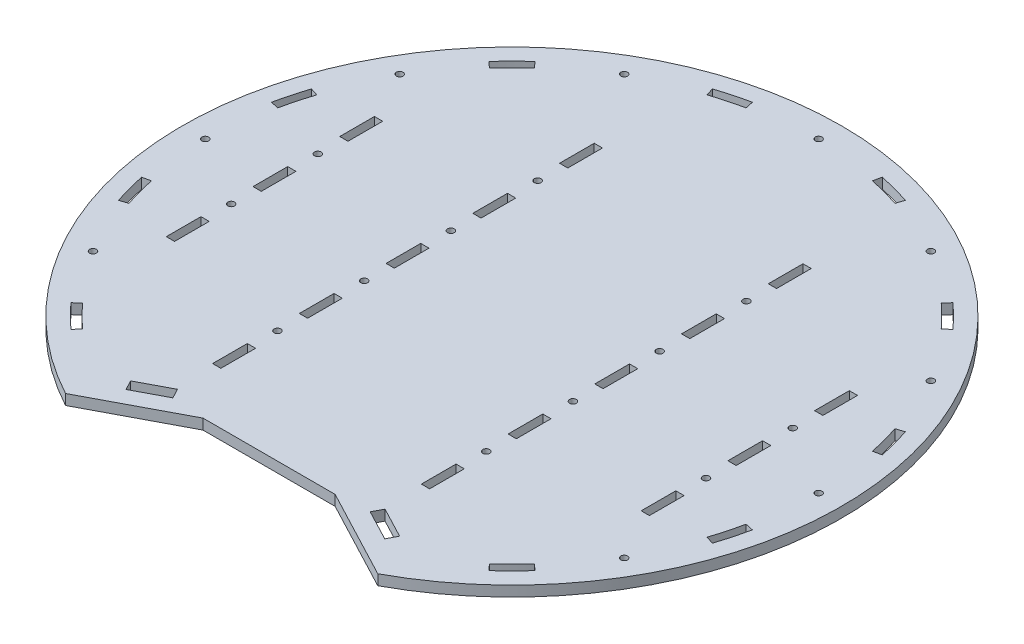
ISO-10303-21;
HEADER;
FILE_DESCRIPTION(('STEP AP214'),'2;1');
FILE_NAME('part.step','',(''),(''),'','','');
FILE_SCHEMA(('AUTOMOTIVE_DESIGN { 1 0 10303 214 1 1 1 1 }'));
ENDSEC;
DATA;
#1=APPLICATION_CONTEXT('core data for automotive mechanical design processes');
#2=APPLICATION_PROTOCOL_DEFINITION('international standard','automotive_design',2000,#1);
#3=PRODUCT_CONTEXT('',#1,'mechanical');
#4=PRODUCT('Part','Part','',(#3));
#5=PRODUCT_RELATED_PRODUCT_CATEGORY('part','',(#4));
#6=PRODUCT_DEFINITION_FORMATION('','',#4);
#7=PRODUCT_DEFINITION_CONTEXT('part definition',#1,'design');
#8=PRODUCT_DEFINITION('design','',#6,#7);
#9=PRODUCT_DEFINITION_SHAPE('','',#8);
#10=(LENGTH_UNIT() NAMED_UNIT(*) SI_UNIT(.MILLI.,.METRE.));
#11=(NAMED_UNIT(*) PLANE_ANGLE_UNIT() SI_UNIT($,.RADIAN.));
#12=(NAMED_UNIT(*) SI_UNIT($,.STERADIAN.) SOLID_ANGLE_UNIT());
#13=UNCERTAINTY_MEASURE_WITH_UNIT(LENGTH_MEASURE(1.E-05),#10,'distance_accuracy_value','');
#14=(GEOMETRIC_REPRESENTATION_CONTEXT(3) GLOBAL_UNCERTAINTY_ASSIGNED_CONTEXT((#13)) GLOBAL_UNIT_ASSIGNED_CONTEXT((#10,
#11,#12)) REPRESENTATION_CONTEXT('',''));
#15=CARTESIAN_POINT('',(0.,0.,0.));
#16=DIRECTION('',(0.,0.,1.));
#17=DIRECTION('',(1.,0.,0.));
#18=AXIS2_PLACEMENT_3D('',#15,#16,#17);
#19=CARTESIAN_POINT('',(-2.23793866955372E-12,6.,-2.48548269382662E-12));
#20=DIRECTION('',(-0.669130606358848,0.,-0.743144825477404));
#21=DIRECTION('',(-0.743144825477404,0.,0.669130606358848));
#22=AXIS2_PLACEMENT_3D('',#19,#20,#21);
#23=PLANE('',#22);
#24=DIRECTION('',(0.743144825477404,0.,-0.669130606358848));
#25=VECTOR('',#24,1.);
#26=CARTESIAN_POINT('',(-2.23793866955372E-12,0.,-2.48548269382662E-12));
#27=LINE('',#26,#25);
#28=CARTESIAN_POINT('',(130.228699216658,0.,-117.258447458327));
#29=VERTEX_POINT('',#28);
#30=CARTESIAN_POINT('',(133.766068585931,0.,-120.443509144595));
#31=VERTEX_POINT('',#30);
#32=EDGE_CURVE('E1324',#29,#31,#27,.T.);
#33=ORIENTED_EDGE('',*,*,#32,.F.);
#34=DIRECTION('',(0.,-1.,0.));
#35=VECTOR('',#34,1.);
#36=CARTESIAN_POINT('',(130.228699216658,6.,-117.258447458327));
#37=LINE('',#36,#35);
#38=CARTESIAN_POINT('',(130.228699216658,6.,-117.258447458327));
#39=VERTEX_POINT('',#38);
#40=EDGE_CURVE('E11',#39,#29,#37,.T.);
#41=ORIENTED_EDGE('',*,*,#40,.F.);
#42=DIRECTION('',(0.743144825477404,0.,-0.669130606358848));
#43=VECTOR('',#42,1.);
#44=CARTESIAN_POINT('',(-2.23793866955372E-12,6.,-2.48548269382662E-12));
#45=LINE('',#44,#43);
#46=CARTESIAN_POINT('',(133.766068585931,6.,-120.443509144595));
#47=VERTEX_POINT('',#46);
#48=EDGE_CURVE('E774',#39,#47,#45,.T.);
#49=ORIENTED_EDGE('',*,*,#48,.T.);
#50=DIRECTION('',(0.,-1.,0.));
#51=VECTOR('',#50,1.);
#52=CARTESIAN_POINT('',(133.766068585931,6.,-120.443509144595));
#53=LINE('',#52,#51);
#54=EDGE_CURVE('E65',#47,#31,#53,.T.);
#55=ORIENTED_EDGE('',*,*,#54,.T.);
#56=EDGE_LOOP('',(#33,#41,#49,#55));
#57=FACE_BOUND('',#56,.T.);
#58=ADVANCED_FACE('F45',(#57),#23,.T.);
#59=CARTESIAN_POINT('',(0.,6.,0.));
#60=DIRECTION('',(0.,-1.,0.));
#61=DIRECTION('',(0.,0.,-1.));
#62=AXIS2_PLACEMENT_3D('',#59,#60,#61);
#63=CYLINDRICAL_SURFACE('',#62,175.24);
#64=CARTESIAN_POINT('',(0.,0.,0.));
#65=DIRECTION('',(0.,1.,0.));
#66=DIRECTION('',(0.,0.,1.));
#67=AXIS2_PLACEMENT_3D('',#64,#65,#66);
#68=CIRCLE('',#67,175.24);
#69=CARTESIAN_POINT('',(117.258447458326,0.,-130.228699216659));
#70=VERTEX_POINT('',#69);
#71=EDGE_CURVE('E781',#29,#70,#68,.T.);
#72=ORIENTED_EDGE('',*,*,#71,.T.);
#73=DIRECTION('',(0.,-1.,0.));
#74=VECTOR('',#73,1.);
#75=CARTESIAN_POINT('',(117.258447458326,6.,-130.228699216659));
#76=LINE('',#75,#74);
#77=CARTESIAN_POINT('',(117.258447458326,6.,-130.228699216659));
#78=VERTEX_POINT('',#77);
#79=EDGE_CURVE('E56',#78,#70,#76,.T.);
#80=ORIENTED_EDGE('',*,*,#79,.F.);
#81=CARTESIAN_POINT('',(0.,6.,0.));
#82=DIRECTION('',(0.,1.,0.));
#83=DIRECTION('',(0.,0.,1.));
#84=AXIS2_PLACEMENT_3D('',#81,#82,#83);
#85=CIRCLE('',#84,175.24);
#86=EDGE_CURVE('E767',#39,#78,#85,.T.);
#87=ORIENTED_EDGE('',*,*,#86,.F.);
#88=ORIENTED_EDGE('',*,*,#40,.T.);
#89=EDGE_LOOP('',(#72,#80,#87,#88));
#90=FACE_BOUND('',#89,.T.);
#91=ADVANCED_FACE('F779',(#90),#63,.T.);
#92=CARTESIAN_POINT('',(-1.46447528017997E-12,6.,-1.31861946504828E-12));
#93=DIRECTION('',(0.74314482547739,0.,0.669130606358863));
#94=DIRECTION('',(0.669130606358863,0.,-0.74314482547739));
#95=AXIS2_PLACEMENT_3D('',#92,#93,#94);
#96=PLANE('',#95);
#97=DIRECTION('',(-0.669130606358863,0.,0.74314482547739));
#98=VECTOR('',#97,1.);
#99=CARTESIAN_POINT('',(-1.46447528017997E-12,0.,-1.31861946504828E-12));
#100=LINE('',#99,#98);
#101=CARTESIAN_POINT('',(120.443509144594,0.,-133.766068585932));
#102=VERTEX_POINT('',#101);
#103=EDGE_CURVE('E1329',#102,#70,#100,.T.);
#104=ORIENTED_EDGE('',*,*,#103,.F.);
#105=DIRECTION('',(0.,-1.,0.));
#106=VECTOR('',#105,1.);
#107=CARTESIAN_POINT('',(120.443509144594,6.,-133.766068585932));
#108=LINE('',#107,#106);
#109=CARTESIAN_POINT('',(120.443509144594,6.,-133.766068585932));
#110=VERTEX_POINT('',#109);
#111=EDGE_CURVE('E414',#110,#102,#108,.T.);
#112=ORIENTED_EDGE('',*,*,#111,.F.);
#113=DIRECTION('',(-0.669130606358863,0.,0.74314482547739));
#114=VECTOR('',#113,1.);
#115=CARTESIAN_POINT('',(-1.46447528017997E-12,6.,-1.31861946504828E-12));
#116=LINE('',#115,#114);
#117=EDGE_CURVE('E773',#110,#78,#116,.T.);
#118=ORIENTED_EDGE('',*,*,#117,.T.);
#119=ORIENTED_EDGE('',*,*,#79,.T.);
#120=EDGE_LOOP('',(#104,#112,#118,#119));
#121=FACE_BOUND('',#120,.T.);
#122=ADVANCED_FACE('F786',(#121),#96,.T.);
#123=CARTESIAN_POINT('',(-7.22781259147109E-13,6.,-3.40041847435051E-12));
#124=DIRECTION('',(-0.207911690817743,0.,-0.978147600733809));
#125=DIRECTION('',(-0.978147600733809,0.,0.207911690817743));
#126=AXIS2_PLACEMENT_3D('',#123,#124,#125);
#127=PLANE('',#126);
#128=DIRECTION('',(0.978147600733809,0.,-0.207911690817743));
#129=VECTOR('',#128,1.);
#130=CARTESIAN_POINT('',(-7.22781259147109E-13,0.,-3.40041847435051E-12));
#131=LINE('',#130,#129);
#132=CARTESIAN_POINT('',(171.410585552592,0.,-36.4344446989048));
#133=VERTEX_POINT('',#132);
#134=CARTESIAN_POINT('',(176.066568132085,0.,-37.4241043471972));
#135=VERTEX_POINT('',#134);
#136=EDGE_CURVE('E1308',#133,#135,#131,.T.);
#137=ORIENTED_EDGE('',*,*,#136,.F.);
#138=DIRECTION('',(0.,-1.,0.));
#139=VECTOR('',#138,1.);
#140=CARTESIAN_POINT('',(171.410585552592,6.,-36.4344446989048));
#141=LINE('',#140,#139);
#142=CARTESIAN_POINT('',(171.410585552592,6.,-36.4344446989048));
#143=VERTEX_POINT('',#142);
#144=EDGE_CURVE('E1359',#143,#133,#141,.T.);
#145=ORIENTED_EDGE('',*,*,#144,.F.);
#146=DIRECTION('',(0.978147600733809,0.,-0.207911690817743));
#147=VECTOR('',#146,1.);
#148=CARTESIAN_POINT('',(-7.22781259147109E-13,6.,-3.40041847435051E-12));
#149=LINE('',#148,#147);
#150=CARTESIAN_POINT('',(176.066568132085,6.,-37.4241043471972));
#151=VERTEX_POINT('',#150);
#152=EDGE_CURVE('E2142',#143,#151,#149,.T.);
#153=ORIENTED_EDGE('',*,*,#152,.T.);
#154=DIRECTION('',(0.,-1.,0.));
#155=VECTOR('',#154,1.);
#156=CARTESIAN_POINT('',(176.066568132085,6.,-37.4241043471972));
#157=LINE('',#156,#155);
#158=EDGE_CURVE('E1362',#151,#135,#157,.T.);
#159=ORIENTED_EDGE('',*,*,#158,.T.);
#160=EDGE_LOOP('',(#137,#145,#153,#159));
#161=FACE_BOUND('',#160,.T.);
#162=ADVANCED_FACE('F2188',(#161),#127,.T.);
#163=CARTESIAN_POINT('',(0.,6.,0.));
#164=DIRECTION('',(0.,-1.,0.));
#165=DIRECTION('',(0.,0.,-1.));
#166=AXIS2_PLACEMENT_3D('',#163,#164,#165);
#167=CYLINDRICAL_SURFACE('',#166,175.24);
#168=CARTESIAN_POINT('',(0.,0.,0.));
#169=DIRECTION('',(0.,1.,0.));
#170=DIRECTION('',(0.,0.,1.));
#171=AXIS2_PLACEMENT_3D('',#168,#169,#170);
#172=CIRCLE('',#171,175.24);
#173=CARTESIAN_POINT('',(166.663143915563,0.,-54.1521380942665));
#174=VERTEX_POINT('',#173);
#175=EDGE_CURVE('E1312',#133,#174,#172,.T.);
#176=ORIENTED_EDGE('',*,*,#175,.T.);
#177=DIRECTION('',(0.,-1.,0.));
#178=VECTOR('',#177,1.);
#179=CARTESIAN_POINT('',(166.663143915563,6.,-54.1521380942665));
#180=LINE('',#179,#178);
#181=CARTESIAN_POINT('',(166.663143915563,6.,-54.1521380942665));
#182=VERTEX_POINT('',#181);
#183=EDGE_CURVE('E1369',#182,#174,#180,.T.);
#184=ORIENTED_EDGE('',*,*,#183,.F.);
#185=CARTESIAN_POINT('',(0.,6.,0.));
#186=DIRECTION('',(0.,1.,0.));
#187=DIRECTION('',(0.,0.,1.));
#188=AXIS2_PLACEMENT_3D('',#185,#186,#187);
#189=CIRCLE('',#188,175.24);
#190=EDGE_CURVE('E2146',#143,#182,#189,.T.);
#191=ORIENTED_EDGE('',*,*,#190,.F.);
#192=ORIENTED_EDGE('',*,*,#144,.T.);
#193=EDGE_LOOP('',(#176,#184,#191,#192));
#194=FACE_BOUND('',#193,.T.);
#195=ADVANCED_FACE('F2184',(#194),#167,.T.);
#196=CARTESIAN_POINT('',(1.06568536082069E-12,6.,3.27984229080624E-12));
#197=DIRECTION('',(0.30901699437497,0.,0.951056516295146));
#198=DIRECTION('',(0.951056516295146,0.,-0.30901699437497));
#199=AXIS2_PLACEMENT_3D('',#196,#197,#198);
#200=PLANE('',#199);
#201=DIRECTION('',(-0.951056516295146,0.,0.30901699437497));
#202=VECTOR('',#201,1.);
#203=CARTESIAN_POINT('',(1.06568536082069E-12,0.,3.27984229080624E-12));
#204=LINE('',#203,#202);
#205=CARTESIAN_POINT('',(171.190172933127,0.,-55.6230589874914));
#206=VERTEX_POINT('',#205);
#207=EDGE_CURVE('E1316',#206,#174,#204,.T.);
#208=ORIENTED_EDGE('',*,*,#207,.F.);
#209=DIRECTION('',(0.,-1.,0.));
#210=VECTOR('',#209,1.);
#211=CARTESIAN_POINT('',(171.190172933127,6.,-55.6230589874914));
#212=LINE('',#211,#210);
#213=CARTESIAN_POINT('',(171.190172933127,6.,-55.6230589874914));
#214=VERTEX_POINT('',#213);
#215=EDGE_CURVE('E1365',#214,#206,#212,.T.);
#216=ORIENTED_EDGE('',*,*,#215,.F.);
#217=DIRECTION('',(-0.951056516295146,0.,0.30901699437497));
#218=VECTOR('',#217,1.);
#219=CARTESIAN_POINT('',(1.06568536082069E-12,6.,3.27984229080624E-12));
#220=LINE('',#219,#218);
#221=EDGE_CURVE('E2149',#214,#182,#220,.T.);
#222=ORIENTED_EDGE('',*,*,#221,.T.);
#223=ORIENTED_EDGE('',*,*,#183,.T.);
#224=EDGE_LOOP('',(#208,#216,#222,#223));
#225=FACE_BOUND('',#224,.T.);
#226=ADVANCED_FACE('F2180',(#225),#200,.T.);
#227=CARTESIAN_POINT('',(8.86935733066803E-12,6.,-7.98600521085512E-12));
#228=DIRECTION('',(0.743144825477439,0.,-0.669130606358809));
#229=DIRECTION('',(-0.669130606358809,0.,-0.743144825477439));
#230=AXIS2_PLACEMENT_3D('',#227,#228,#229);
#231=PLANE('',#230);
#232=DIRECTION('',(0.669130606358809,0.,0.743144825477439));
#233=VECTOR('',#232,1.);
#234=CARTESIAN_POINT('',(8.86935733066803E-12,0.,-7.98600521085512E-12));
#235=LINE('',#234,#233);
#236=CARTESIAN_POINT('',(117.258447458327,0.,130.228699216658));
#237=VERTEX_POINT('',#236);
#238=CARTESIAN_POINT('',(120.443509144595,0.,133.766068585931));
#239=VERTEX_POINT('',#238);
#240=EDGE_CURVE('E1292',#237,#239,#235,.T.);
#241=ORIENTED_EDGE('',*,*,#240,.F.);
#242=DIRECTION('',(0.,-1.,0.));
#243=VECTOR('',#242,1.);
#244=CARTESIAN_POINT('',(117.258447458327,6.,130.228699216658));
#245=LINE('',#244,#243);
#246=CARTESIAN_POINT('',(117.258447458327,6.,130.228699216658));
#247=VERTEX_POINT('',#246);
#248=EDGE_CURVE('E1366',#247,#237,#245,.T.);
#249=ORIENTED_EDGE('',*,*,#248,.F.);
#250=DIRECTION('',(0.669130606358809,0.,0.743144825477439));
#251=VECTOR('',#250,1.);
#252=CARTESIAN_POINT('',(8.86935733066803E-12,6.,-7.98600521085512E-12));
#253=LINE('',#252,#251);
#254=CARTESIAN_POINT('',(120.443509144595,6.,133.766068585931));
#255=VERTEX_POINT('',#254);
#256=EDGE_CURVE('E2127',#247,#255,#253,.T.);
#257=ORIENTED_EDGE('',*,*,#256,.T.);
#258=DIRECTION('',(0.,-1.,0.));
#259=VECTOR('',#258,1.);
#260=CARTESIAN_POINT('',(120.443509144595,6.,133.766068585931));
#261=LINE('',#260,#259);
#262=EDGE_CURVE('E1374',#255,#239,#261,.T.);
#263=ORIENTED_EDGE('',*,*,#262,.T.);
#264=EDGE_LOOP('',(#241,#249,#257,#263));
#265=FACE_BOUND('',#264,.T.);
#266=ADVANCED_FACE('F2183',(#265),#231,.T.);
#267=CARTESIAN_POINT('',(0.,6.,0.));
#268=DIRECTION('',(0.,-1.,0.));
#269=DIRECTION('',(0.,0.,-1.));
#270=AXIS2_PLACEMENT_3D('',#267,#268,#269);
#271=CYLINDRICAL_SURFACE('',#270,175.24);
#272=CARTESIAN_POINT('',(0.,0.,0.));
#273=DIRECTION('',(0.,1.,0.));
#274=DIRECTION('',(0.,0.,1.));
#275=AXIS2_PLACEMENT_3D('',#272,#273,#274);
#276=CIRCLE('',#275,175.24);
#277=CARTESIAN_POINT('',(130.228699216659,0.,117.258447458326));
#278=VERTEX_POINT('',#277);
#279=EDGE_CURVE('E1296',#237,#278,#276,.T.);
#280=ORIENTED_EDGE('',*,*,#279,.T.);
#281=DIRECTION('',(0.,-1.,0.));
#282=VECTOR('',#281,1.);
#283=CARTESIAN_POINT('',(130.228699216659,6.,117.258447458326));
#284=LINE('',#283,#282);
#285=CARTESIAN_POINT('',(130.228699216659,6.,117.258447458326));
#286=VERTEX_POINT('',#285);
#287=EDGE_CURVE('E1381',#286,#278,#284,.T.);
#288=ORIENTED_EDGE('',*,*,#287,.F.);
#289=CARTESIAN_POINT('',(0.,6.,0.));
#290=DIRECTION('',(0.,1.,0.));
#291=DIRECTION('',(0.,0.,1.));
#292=AXIS2_PLACEMENT_3D('',#289,#290,#291);
#293=CIRCLE('',#292,175.24);
#294=EDGE_CURVE('E2131',#247,#286,#293,.T.);
#295=ORIENTED_EDGE('',*,*,#294,.F.);
#296=ORIENTED_EDGE('',*,*,#248,.T.);
#297=EDGE_LOOP('',(#280,#288,#295,#296));
#298=FACE_BOUND('',#297,.T.);
#299=ADVANCED_FACE('F2201',(#298),#271,.T.);
#300=CARTESIAN_POINT('',(3.32440682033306E-12,6.,-3.69212781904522E-12));
#301=DIRECTION('',(-0.669130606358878,0.,0.743144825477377));
#302=DIRECTION('',(0.743144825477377,0.,0.669130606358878));
#303=AXIS2_PLACEMENT_3D('',#300,#301,#302);
#304=PLANE('',#303);
#305=DIRECTION('',(-0.743144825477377,0.,-0.669130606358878));
#306=VECTOR('',#305,1.);
#307=CARTESIAN_POINT('',(3.32440682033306E-12,0.,-3.69212781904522E-12));
#308=LINE('',#307,#306);
#309=CARTESIAN_POINT('',(133.766068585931,0.,120.443509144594));
#310=VERTEX_POINT('',#309);
#311=EDGE_CURVE('E1300',#310,#278,#308,.T.);
#312=ORIENTED_EDGE('',*,*,#311,.F.);
#313=DIRECTION('',(0.,-1.,0.));
#314=VECTOR('',#313,1.);
#315=CARTESIAN_POINT('',(133.766068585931,6.,120.443509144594));
#316=LINE('',#315,#314);
#317=CARTESIAN_POINT('',(133.766068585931,6.,120.443509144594));
#318=VERTEX_POINT('',#317);
#319=EDGE_CURVE('E1377',#318,#310,#316,.T.);
#320=ORIENTED_EDGE('',*,*,#319,.F.);
#321=DIRECTION('',(-0.743144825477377,0.,-0.669130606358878));
#322=VECTOR('',#321,1.);
#323=CARTESIAN_POINT('',(3.32440682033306E-12,6.,-3.69212781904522E-12));
#324=LINE('',#323,#322);
#325=EDGE_CURVE('E2134',#318,#286,#324,.T.);
#326=ORIENTED_EDGE('',*,*,#325,.T.);
#327=ORIENTED_EDGE('',*,*,#287,.T.);
#328=EDGE_LOOP('',(#312,#320,#326,#327));
#329=FACE_BOUND('',#328,.T.);
#330=ADVANCED_FACE('F2197',(#329),#304,.T.);
#331=CARTESIAN_POINT('',(62.5533280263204,6.,0.));
#332=DIRECTION('',(-1.,0.,0.));
#333=DIRECTION('',(0.,0.,1.));
#334=AXIS2_PLACEMENT_3D('',#331,#332,#333);
#335=PLANE('',#334);
#336=DIRECTION('',(0.,0.,-1.));
#337=VECTOR('',#336,1.);
#338=CARTESIAN_POINT('',(62.5533280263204,0.,0.));
#339=LINE('',#338,#337);
#340=CARTESIAN_POINT('',(62.5533280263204,0.,-40.));
#341=VERTEX_POINT('',#340);
#342=CARTESIAN_POINT('',(62.5533280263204,0.,-60.));
#343=VERTEX_POINT('',#342);
#344=EDGE_CURVE('E1276',#341,#343,#339,.T.);
#345=ORIENTED_EDGE('',*,*,#344,.F.);
#346=DIRECTION('',(0.,-1.,0.));
#347=VECTOR('',#346,1.);
#348=CARTESIAN_POINT('',(62.5533280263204,6.,-40.));
#349=LINE('',#348,#347);
#350=CARTESIAN_POINT('',(62.5533280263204,6.,-40.));
#351=VERTEX_POINT('',#350);
#352=EDGE_CURVE('E1378',#351,#341,#349,.T.);
#353=ORIENTED_EDGE('',*,*,#352,.F.);
#354=DIRECTION('',(0.,0.,-1.));
#355=VECTOR('',#354,1.);
#356=CARTESIAN_POINT('',(62.5533280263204,6.,0.));
#357=LINE('',#356,#355);
#358=CARTESIAN_POINT('',(62.5533280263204,6.,-60.));
#359=VERTEX_POINT('',#358);
#360=EDGE_CURVE('E2112',#351,#359,#357,.T.);
#361=ORIENTED_EDGE('',*,*,#360,.T.);
#362=DIRECTION('',(0.,-1.,0.));
#363=VECTOR('',#362,1.);
#364=CARTESIAN_POINT('',(62.5533280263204,6.,-60.));
#365=LINE('',#364,#363);
#366=EDGE_CURVE('E1386',#359,#343,#365,.T.);
#367=ORIENTED_EDGE('',*,*,#366,.T.);
#368=EDGE_LOOP('',(#345,#353,#361,#367));
#369=FACE_BOUND('',#368,.T.);
#370=ADVANCED_FACE('F2200',(#369),#335,.T.);
#371=CARTESIAN_POINT('',(1.16620065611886E-13,6.,-40.0000000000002));
#372=DIRECTION('',(0.,0.,1.));
#373=DIRECTION('',(1.,0.,0.));
#374=AXIS2_PLACEMENT_3D('',#371,#372,#373);
#375=PLANE('',#374);
#376=DIRECTION('',(-1.,0.,0.));
#377=VECTOR('',#376,1.);
#378=CARTESIAN_POINT('',(1.16620065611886E-13,0.,-40.0000000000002));
#379=LINE('',#378,#377);
#380=CARTESIAN_POINT('',(57.7933280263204,0.,-40.));
#381=VERTEX_POINT('',#380);
#382=EDGE_CURVE('E1280',#341,#381,#379,.T.);
#383=ORIENTED_EDGE('',*,*,#382,.T.);
#384=DIRECTION('',(0.,-1.,0.));
#385=VECTOR('',#384,1.);
#386=CARTESIAN_POINT('',(57.7933280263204,6.,-40.));
#387=LINE('',#386,#385);
#388=CARTESIAN_POINT('',(57.7933280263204,6.,-40.));
#389=VERTEX_POINT('',#388);
#390=EDGE_CURVE('E1393',#389,#381,#387,.T.);
#391=ORIENTED_EDGE('',*,*,#390,.F.);
#392=DIRECTION('',(-1.,0.,0.));
#393=VECTOR('',#392,1.);
#394=CARTESIAN_POINT('',(1.16620065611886E-13,6.,-40.0000000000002));
#395=LINE('',#394,#393);
#396=EDGE_CURVE('E2116',#351,#389,#395,.T.);
#397=ORIENTED_EDGE('',*,*,#396,.F.);
#398=ORIENTED_EDGE('',*,*,#352,.T.);
#399=EDGE_LOOP('',(#383,#391,#397,#398));
#400=FACE_BOUND('',#399,.T.);
#401=ADVANCED_FACE('F2217',(#400),#375,.F.);
#402=CARTESIAN_POINT('',(57.7933280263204,6.,0.));
#403=DIRECTION('',(-1.,0.,0.));
#404=DIRECTION('',(0.,0.,1.));
#405=AXIS2_PLACEMENT_3D('',#402,#403,#404);
#406=PLANE('',#405);
#407=DIRECTION('',(0.,0.,-1.));
#408=VECTOR('',#407,1.);
#409=CARTESIAN_POINT('',(57.7933280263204,0.,0.));
#410=LINE('',#409,#408);
#411=CARTESIAN_POINT('',(57.7933280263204,0.,-60.));
#412=VERTEX_POINT('',#411);
#413=EDGE_CURVE('E1284',#381,#412,#410,.T.);
#414=ORIENTED_EDGE('',*,*,#413,.T.);
#415=DIRECTION('',(0.,-1.,0.));
#416=VECTOR('',#415,1.);
#417=CARTESIAN_POINT('',(57.7933280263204,6.,-60.));
#418=LINE('',#417,#416);
#419=CARTESIAN_POINT('',(57.7933280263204,6.,-60.));
#420=VERTEX_POINT('',#419);
#421=EDGE_CURVE('E1389',#420,#412,#418,.T.);
#422=ORIENTED_EDGE('',*,*,#421,.F.);
#423=DIRECTION('',(0.,0.,-1.));
#424=VECTOR('',#423,1.);
#425=CARTESIAN_POINT('',(57.7933280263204,6.,0.));
#426=LINE('',#425,#424);
#427=EDGE_CURVE('E2120',#389,#420,#426,.T.);
#428=ORIENTED_EDGE('',*,*,#427,.F.);
#429=ORIENTED_EDGE('',*,*,#390,.T.);
#430=EDGE_LOOP('',(#414,#422,#428,#429));
#431=FACE_BOUND('',#430,.T.);
#432=ADVANCED_FACE('F2213',(#431),#406,.F.);
#433=CARTESIAN_POINT('',(57.7933280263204,6.,0.));
#434=DIRECTION('',(1.,0.,0.));
#435=DIRECTION('',(0.,0.,-1.));
#436=AXIS2_PLACEMENT_3D('',#433,#434,#435);
#437=PLANE('',#436);
#438=DIRECTION('',(0.,0.,1.));
#439=VECTOR('',#438,1.);
#440=CARTESIAN_POINT('',(57.7933280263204,0.,0.));
#441=LINE('',#440,#439);
#442=CARTESIAN_POINT('',(57.7933280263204,0.,-9.99999999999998));
#443=VERTEX_POINT('',#442);
#444=CARTESIAN_POINT('',(57.7933280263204,0.,9.99999999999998));
#445=VERTEX_POINT('',#444);
#446=EDGE_CURVE('E1260',#443,#445,#441,.T.);
#447=ORIENTED_EDGE('',*,*,#446,.F.);
#448=DIRECTION('',(0.,-1.,0.));
#449=VECTOR('',#448,1.);
#450=CARTESIAN_POINT('',(57.7933280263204,6.,-9.99999999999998));
#451=LINE('',#450,#449);
#452=CARTESIAN_POINT('',(57.7933280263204,6.,-9.99999999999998));
#453=VERTEX_POINT('',#452);
#454=EDGE_CURVE('E1390',#453,#443,#451,.T.);
#455=ORIENTED_EDGE('',*,*,#454,.F.);
#456=DIRECTION('',(0.,0.,1.));
#457=VECTOR('',#456,1.);
#458=CARTESIAN_POINT('',(57.7933280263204,6.,0.));
#459=LINE('',#458,#457);
#460=CARTESIAN_POINT('',(57.7933280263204,6.,9.99999999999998));
#461=VERTEX_POINT('',#460);
#462=EDGE_CURVE('E2097',#453,#461,#459,.T.);
#463=ORIENTED_EDGE('',*,*,#462,.T.);
#464=DIRECTION('',(0.,-1.,0.));
#465=VECTOR('',#464,1.);
#466=CARTESIAN_POINT('',(57.7933280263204,6.,9.99999999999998));
#467=LINE('',#466,#465);
#468=EDGE_CURVE('E1399',#461,#445,#467,.T.);
#469=ORIENTED_EDGE('',*,*,#468,.T.);
#470=EDGE_LOOP('',(#447,#455,#463,#469));
#471=FACE_BOUND('',#470,.T.);
#472=ADVANCED_FACE('F2216',(#471),#437,.T.);
#473=CARTESIAN_POINT('',(0.,6.,-9.99999999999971));
#474=DIRECTION('',(0.,0.,-1.));
#475=DIRECTION('',(-1.,0.,0.));
#476=AXIS2_PLACEMENT_3D('',#473,#474,#475);
#477=PLANE('',#476);
#478=DIRECTION('',(1.,0.,0.));
#479=VECTOR('',#478,1.);
#480=CARTESIAN_POINT('',(0.,0.,-9.99999999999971));
#481=LINE('',#480,#479);
#482=CARTESIAN_POINT('',(62.5533280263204,0.,-10.));
#483=VERTEX_POINT('',#482);
#484=EDGE_CURVE('E1264',#443,#483,#481,.T.);
#485=ORIENTED_EDGE('',*,*,#484,.T.);
#486=DIRECTION('',(0.,-1.,0.));
#487=VECTOR('',#486,1.);
#488=CARTESIAN_POINT('',(62.5533280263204,6.,-10.));
#489=LINE('',#488,#487);
#490=CARTESIAN_POINT('',(62.5533280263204,6.,-10.));
#491=VERTEX_POINT('',#490);
#492=EDGE_CURVE('E1406',#491,#483,#489,.T.);
#493=ORIENTED_EDGE('',*,*,#492,.F.);
#494=DIRECTION('',(1.,0.,0.));
#495=VECTOR('',#494,1.);
#496=CARTESIAN_POINT('',(0.,6.,-9.99999999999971));
#497=LINE('',#496,#495);
#498=EDGE_CURVE('E2101',#453,#491,#497,.T.);
#499=ORIENTED_EDGE('',*,*,#498,.F.);
#500=ORIENTED_EDGE('',*,*,#454,.T.);
#501=EDGE_LOOP('',(#485,#493,#499,#500));
#502=FACE_BOUND('',#501,.T.);
#503=ADVANCED_FACE('F2233',(#502),#477,.F.);
#504=CARTESIAN_POINT('',(62.5533280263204,6.,0.));
#505=DIRECTION('',(1.,0.,0.));
#506=DIRECTION('',(0.,0.,-1.));
#507=AXIS2_PLACEMENT_3D('',#504,#505,#506);
#508=PLANE('',#507);
#509=DIRECTION('',(0.,0.,1.));
#510=VECTOR('',#509,1.);
#511=CARTESIAN_POINT('',(62.5533280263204,0.,0.));
#512=LINE('',#511,#510);
#513=CARTESIAN_POINT('',(62.5533280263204,0.,9.99999999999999));
#514=VERTEX_POINT('',#513);
#515=EDGE_CURVE('E1268',#483,#514,#512,.T.);
#516=ORIENTED_EDGE('',*,*,#515,.T.);
#517=DIRECTION('',(0.,-1.,0.));
#518=VECTOR('',#517,1.);
#519=CARTESIAN_POINT('',(62.5533280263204,6.,9.99999999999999));
#520=LINE('',#519,#518);
#521=CARTESIAN_POINT('',(62.5533280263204,6.,9.99999999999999));
#522=VERTEX_POINT('',#521);
#523=EDGE_CURVE('E1402',#522,#514,#520,.T.);
#524=ORIENTED_EDGE('',*,*,#523,.F.);
#525=DIRECTION('',(0.,0.,1.));
#526=VECTOR('',#525,1.);
#527=CARTESIAN_POINT('',(62.5533280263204,6.,0.));
#528=LINE('',#527,#526);
#529=EDGE_CURVE('E2105',#491,#522,#528,.T.);
#530=ORIENTED_EDGE('',*,*,#529,.F.);
#531=ORIENTED_EDGE('',*,*,#492,.T.);
#532=EDGE_LOOP('',(#516,#524,#530,#531));
#533=FACE_BOUND('',#532,.T.);
#534=ADVANCED_FACE('F2229',(#533),#508,.F.);
#535=CARTESIAN_POINT('',(62.5533280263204,6.,0.));
#536=DIRECTION('',(-1.,0.,0.));
#537=DIRECTION('',(0.,0.,1.));
#538=AXIS2_PLACEMENT_3D('',#535,#536,#537);
#539=PLANE('',#538);
#540=DIRECTION('',(0.,0.,-1.));
#541=VECTOR('',#540,1.);
#542=CARTESIAN_POINT('',(62.5533280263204,0.,0.));
#543=LINE('',#542,#541);
#544=CARTESIAN_POINT('',(62.5533280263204,0.,-90.));
#545=VERTEX_POINT('',#544);
#546=CARTESIAN_POINT('',(62.5533280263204,0.,-110.));
#547=VERTEX_POINT('',#546);
#548=EDGE_CURVE('E1244',#545,#547,#543,.T.);
#549=ORIENTED_EDGE('',*,*,#548,.F.);
#550=DIRECTION('',(0.,-1.,0.));
#551=VECTOR('',#550,1.);
#552=CARTESIAN_POINT('',(62.5533280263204,6.,-90.));
#553=LINE('',#552,#551);
#554=CARTESIAN_POINT('',(62.5533280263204,6.,-90.));
#555=VERTEX_POINT('',#554);
#556=EDGE_CURVE('E1403',#555,#545,#553,.T.);
#557=ORIENTED_EDGE('',*,*,#556,.F.);
#558=DIRECTION('',(0.,0.,-1.));
#559=VECTOR('',#558,1.);
#560=CARTESIAN_POINT('',(62.5533280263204,6.,0.));
#561=LINE('',#560,#559);
#562=CARTESIAN_POINT('',(62.5533280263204,6.,-110.));
#563=VERTEX_POINT('',#562);
#564=EDGE_CURVE('E2082',#555,#563,#561,.T.);
#565=ORIENTED_EDGE('',*,*,#564,.T.);
#566=DIRECTION('',(0.,-1.,0.));
#567=VECTOR('',#566,1.);
#568=CARTESIAN_POINT('',(62.5533280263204,6.,-110.));
#569=LINE('',#568,#567);
#570=EDGE_CURVE('E1412',#563,#547,#569,.T.);
#571=ORIENTED_EDGE('',*,*,#570,.T.);
#572=EDGE_LOOP('',(#549,#557,#565,#571));
#573=FACE_BOUND('',#572,.T.);
#574=ADVANCED_FACE('F2232',(#573),#539,.T.);
#575=CARTESIAN_POINT('',(2.62395147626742E-13,6.,-90.0000000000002));
#576=DIRECTION('',(0.,0.,1.));
#577=DIRECTION('',(1.,0.,0.));
#578=AXIS2_PLACEMENT_3D('',#575,#576,#577);
#579=PLANE('',#578);
#580=DIRECTION('',(-1.,0.,0.));
#581=VECTOR('',#580,1.);
#582=CARTESIAN_POINT('',(2.62395147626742E-13,0.,-90.0000000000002));
#583=LINE('',#582,#581);
#584=CARTESIAN_POINT('',(57.7933280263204,0.,-90.));
#585=VERTEX_POINT('',#584);
#586=EDGE_CURVE('E1248',#545,#585,#583,.T.);
#587=ORIENTED_EDGE('',*,*,#586,.T.);
#588=DIRECTION('',(0.,-1.,0.));
#589=VECTOR('',#588,1.);
#590=CARTESIAN_POINT('',(57.7933280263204,6.,-90.));
#591=LINE('',#590,#589);
#592=CARTESIAN_POINT('',(57.7933280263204,6.,-90.));
#593=VERTEX_POINT('',#592);
#594=EDGE_CURVE('E1419',#593,#585,#591,.T.);
#595=ORIENTED_EDGE('',*,*,#594,.F.);
#596=DIRECTION('',(-1.,0.,0.));
#597=VECTOR('',#596,1.);
#598=CARTESIAN_POINT('',(2.62395147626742E-13,6.,-90.0000000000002));
#599=LINE('',#598,#597);
#600=EDGE_CURVE('E2086',#555,#593,#599,.T.);
#601=ORIENTED_EDGE('',*,*,#600,.F.);
#602=ORIENTED_EDGE('',*,*,#556,.T.);
#603=EDGE_LOOP('',(#587,#595,#601,#602));
#604=FACE_BOUND('',#603,.T.);
#605=ADVANCED_FACE('F2249',(#604),#579,.F.);
#606=CARTESIAN_POINT('',(57.7933280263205,6.,0.));
#607=DIRECTION('',(-1.,0.,0.));
#608=DIRECTION('',(0.,0.,1.));
#609=AXIS2_PLACEMENT_3D('',#606,#607,#608);
#610=PLANE('',#609);
#611=DIRECTION('',(0.,0.,-1.));
#612=VECTOR('',#611,1.);
#613=CARTESIAN_POINT('',(57.7933280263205,0.,0.));
#614=LINE('',#613,#612);
#615=CARTESIAN_POINT('',(57.7933280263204,0.,-110.));
#616=VERTEX_POINT('',#615);
#617=EDGE_CURVE('E1252',#585,#616,#614,.T.);
#618=ORIENTED_EDGE('',*,*,#617,.T.);
#619=DIRECTION('',(0.,-1.,0.));
#620=VECTOR('',#619,1.);
#621=CARTESIAN_POINT('',(57.7933280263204,6.,-110.));
#622=LINE('',#621,#620);
#623=CARTESIAN_POINT('',(57.7933280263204,6.,-110.));
#624=VERTEX_POINT('',#623);
#625=EDGE_CURVE('E1415',#624,#616,#622,.T.);
#626=ORIENTED_EDGE('',*,*,#625,.F.);
#627=DIRECTION('',(0.,0.,-1.));
#628=VECTOR('',#627,1.);
#629=CARTESIAN_POINT('',(57.7933280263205,6.,0.));
#630=LINE('',#629,#628);
#631=EDGE_CURVE('E2090',#593,#624,#630,.T.);
#632=ORIENTED_EDGE('',*,*,#631,.F.);
#633=ORIENTED_EDGE('',*,*,#594,.T.);
#634=EDGE_LOOP('',(#618,#626,#632,#633));
#635=FACE_BOUND('',#634,.T.);
#636=ADVANCED_FACE('F2245',(#635),#610,.F.);
#637=CARTESIAN_POINT('',(0.,6.,90.));
#638=DIRECTION('',(0.,0.,1.));
#639=DIRECTION('',(1.,0.,0.));
#640=AXIS2_PLACEMENT_3D('',#637,#638,#639);
#641=PLANE('',#640);
#642=DIRECTION('',(-1.,0.,0.));
#643=VECTOR('',#642,1.);
#644=CARTESIAN_POINT('',(0.,0.,90.));
#645=LINE('',#644,#643);
#646=CARTESIAN_POINT('',(62.5533280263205,0.,90.));
#647=VERTEX_POINT('',#646);
#648=CARTESIAN_POINT('',(57.7933280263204,0.,90.));
#649=VERTEX_POINT('',#648);
#650=EDGE_CURVE('E1228',#647,#649,#645,.T.);
#651=ORIENTED_EDGE('',*,*,#650,.F.);
#652=DIRECTION('',(0.,-1.,0.));
#653=VECTOR('',#652,1.);
#654=CARTESIAN_POINT('',(62.5533280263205,6.,90.));
#655=LINE('',#654,#653);
#656=CARTESIAN_POINT('',(62.5533280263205,6.,90.));
#657=VERTEX_POINT('',#656);
#658=EDGE_CURVE('E1416',#657,#647,#655,.T.);
#659=ORIENTED_EDGE('',*,*,#658,.F.);
#660=DIRECTION('',(-1.,0.,0.));
#661=VECTOR('',#660,1.);
#662=CARTESIAN_POINT('',(0.,6.,90.));
#663=LINE('',#662,#661);
#664=CARTESIAN_POINT('',(57.7933280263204,6.,90.));
#665=VERTEX_POINT('',#664);
#666=EDGE_CURVE('E2067',#657,#665,#663,.T.);
#667=ORIENTED_EDGE('',*,*,#666,.T.);
#668=DIRECTION('',(0.,-1.,0.));
#669=VECTOR('',#668,1.);
#670=CARTESIAN_POINT('',(57.7933280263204,6.,90.));
#671=LINE('',#670,#669);
#672=EDGE_CURVE('E1425',#665,#649,#671,.T.);
#673=ORIENTED_EDGE('',*,*,#672,.T.);
#674=EDGE_LOOP('',(#651,#659,#667,#673));
#675=FACE_BOUND('',#674,.T.);
#676=ADVANCED_FACE('F2248',(#675),#641,.T.);
#677=CARTESIAN_POINT('',(62.5533280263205,6.,0.));
#678=DIRECTION('',(1.,0.,0.));
#679=DIRECTION('',(0.,0.,-1.));
#680=AXIS2_PLACEMENT_3D('',#677,#678,#679);
#681=PLANE('',#680);
#682=DIRECTION('',(0.,0.,1.));
#683=VECTOR('',#682,1.);
#684=CARTESIAN_POINT('',(62.5533280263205,0.,0.));
#685=LINE('',#684,#683);
#686=CARTESIAN_POINT('',(62.5533280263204,0.,110.));
#687=VERTEX_POINT('',#686);
#688=EDGE_CURVE('E1232',#647,#687,#685,.T.);
#689=ORIENTED_EDGE('',*,*,#688,.T.);
#690=DIRECTION('',(0.,-1.,0.));
#691=VECTOR('',#690,1.);
#692=CARTESIAN_POINT('',(62.5533280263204,6.,110.));
#693=LINE('',#692,#691);
#694=CARTESIAN_POINT('',(62.5533280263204,6.,110.));
#695=VERTEX_POINT('',#694);
#696=EDGE_CURVE('E1432',#695,#687,#693,.T.);
#697=ORIENTED_EDGE('',*,*,#696,.F.);
#698=DIRECTION('',(0.,0.,1.));
#699=VECTOR('',#698,1.);
#700=CARTESIAN_POINT('',(62.5533280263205,6.,0.));
#701=LINE('',#700,#699);
#702=EDGE_CURVE('E2071',#657,#695,#701,.T.);
#703=ORIENTED_EDGE('',*,*,#702,.F.);
#704=ORIENTED_EDGE('',*,*,#658,.T.);
#705=EDGE_LOOP('',(#689,#697,#703,#704));
#706=FACE_BOUND('',#705,.T.);
#707=ADVANCED_FACE('F2265',(#706),#681,.F.);
#708=CARTESIAN_POINT('',(0.,6.,110.));
#709=DIRECTION('',(0.,0.,1.));
#710=DIRECTION('',(1.,0.,0.));
#711=AXIS2_PLACEMENT_3D('',#708,#709,#710);
#712=PLANE('',#711);
#713=DIRECTION('',(-1.,0.,0.));
#714=VECTOR('',#713,1.);
#715=CARTESIAN_POINT('',(0.,0.,110.));
#716=LINE('',#715,#714);
#717=CARTESIAN_POINT('',(57.7933280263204,0.,110.));
#718=VERTEX_POINT('',#717);
#719=EDGE_CURVE('E1236',#687,#718,#716,.T.);
#720=ORIENTED_EDGE('',*,*,#719,.T.);
#721=DIRECTION('',(0.,-1.,0.));
#722=VECTOR('',#721,1.);
#723=CARTESIAN_POINT('',(57.7933280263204,6.,110.));
#724=LINE('',#723,#722);
#725=CARTESIAN_POINT('',(57.7933280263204,6.,110.));
#726=VERTEX_POINT('',#725);
#727=EDGE_CURVE('E1428',#726,#718,#724,.T.);
#728=ORIENTED_EDGE('',*,*,#727,.F.);
#729=DIRECTION('',(-1.,0.,0.));
#730=VECTOR('',#729,1.);
#731=CARTESIAN_POINT('',(0.,6.,110.));
#732=LINE('',#731,#730);
#733=EDGE_CURVE('E2075',#695,#726,#732,.T.);
#734=ORIENTED_EDGE('',*,*,#733,.F.);
#735=ORIENTED_EDGE('',*,*,#696,.T.);
#736=EDGE_LOOP('',(#720,#728,#734,#735));
#737=FACE_BOUND('',#736,.T.);
#738=ADVANCED_FACE('F2261',(#737),#712,.F.);
#739=CARTESIAN_POINT('',(-2.62395147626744E-13,6.,90.0000000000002));
#740=DIRECTION('',(0.,0.,-1.));
#741=DIRECTION('',(-1.,0.,0.));
#742=AXIS2_PLACEMENT_3D('',#739,#740,#741);
#743=PLANE('',#742);
#744=DIRECTION('',(1.,0.,0.));
#745=VECTOR('',#744,1.);
#746=CARTESIAN_POINT('',(-2.62395147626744E-13,0.,90.0000000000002));
#747=LINE('',#746,#745);
#748=CARTESIAN_POINT('',(-62.5533280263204,0.,90.));
#749=VERTEX_POINT('',#748);
#750=CARTESIAN_POINT('',(-57.7933280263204,0.,90.));
#751=VERTEX_POINT('',#750);
#752=EDGE_CURVE('E1212',#749,#751,#747,.T.);
#753=ORIENTED_EDGE('',*,*,#752,.T.);
#754=DIRECTION('',(0.,-1.,0.));
#755=VECTOR('',#754,1.);
#756=CARTESIAN_POINT('',(-57.7933280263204,6.,90.));
#757=LINE('',#756,#755);
#758=CARTESIAN_POINT('',(-57.7933280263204,6.,90.));
#759=VERTEX_POINT('',#758);
#760=EDGE_CURVE('E1429',#759,#751,#757,.T.);
#761=ORIENTED_EDGE('',*,*,#760,.F.);
#762=DIRECTION('',(1.,0.,0.));
#763=VECTOR('',#762,1.);
#764=CARTESIAN_POINT('',(-2.62395147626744E-13,6.,90.0000000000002));
#765=LINE('',#764,#763);
#766=CARTESIAN_POINT('',(-62.5533280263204,6.,90.));
#767=VERTEX_POINT('',#766);
#768=EDGE_CURVE('E2052',#767,#759,#765,.T.);
#769=ORIENTED_EDGE('',*,*,#768,.F.);
#770=DIRECTION('',(0.,-1.,0.));
#771=VECTOR('',#770,1.);
#772=CARTESIAN_POINT('',(-62.5533280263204,6.,90.));
#773=LINE('',#772,#771);
#774=EDGE_CURVE('E1438',#767,#749,#773,.T.);
#775=ORIENTED_EDGE('',*,*,#774,.T.);
#776=EDGE_LOOP('',(#753,#761,#769,#775));
#777=FACE_BOUND('',#776,.T.);
#778=ADVANCED_FACE('F2264',(#777),#743,.F.);
#779=CARTESIAN_POINT('',(-57.7933280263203,6.,0.));
#780=DIRECTION('',(1.,0.,0.));
#781=DIRECTION('',(0.,0.,-1.));
#782=AXIS2_PLACEMENT_3D('',#779,#780,#781);
#783=PLANE('',#782);
#784=DIRECTION('',(0.,0.,1.));
#785=VECTOR('',#784,1.);
#786=CARTESIAN_POINT('',(-57.7933280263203,0.,0.));
#787=LINE('',#786,#785);
#788=CARTESIAN_POINT('',(-57.7933280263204,0.,110.));
#789=VERTEX_POINT('',#788);
#790=EDGE_CURVE('E1216',#751,#789,#787,.T.);
#791=ORIENTED_EDGE('',*,*,#790,.T.);
#792=DIRECTION('',(0.,-1.,0.));
#793=VECTOR('',#792,1.);
#794=CARTESIAN_POINT('',(-57.7933280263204,6.,110.));
#795=LINE('',#794,#793);
#796=CARTESIAN_POINT('',(-57.7933280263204,6.,110.));
#797=VERTEX_POINT('',#796);
#798=EDGE_CURVE('E1445',#797,#789,#795,.T.);
#799=ORIENTED_EDGE('',*,*,#798,.F.);
#800=DIRECTION('',(0.,0.,1.));
#801=VECTOR('',#800,1.);
#802=CARTESIAN_POINT('',(-57.7933280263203,6.,0.));
#803=LINE('',#802,#801);
#804=EDGE_CURVE('E2056',#759,#797,#803,.T.);
#805=ORIENTED_EDGE('',*,*,#804,.F.);
#806=ORIENTED_EDGE('',*,*,#760,.T.);
#807=EDGE_LOOP('',(#791,#799,#805,#806));
#808=FACE_BOUND('',#807,.T.);
#809=ADVANCED_FACE('F2281',(#808),#783,.F.);
#810=CARTESIAN_POINT('',(-3.20705180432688E-13,6.,110.));
#811=DIRECTION('',(0.,0.,-1.));
#812=DIRECTION('',(-1.,0.,0.));
#813=AXIS2_PLACEMENT_3D('',#810,#811,#812);
#814=PLANE('',#813);
#815=DIRECTION('',(1.,0.,0.));
#816=VECTOR('',#815,1.);
#817=CARTESIAN_POINT('',(-3.20705180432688E-13,0.,110.));
#818=LINE('',#817,#816);
#819=CARTESIAN_POINT('',(-62.5533280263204,0.,110.));
#820=VERTEX_POINT('',#819);
#821=EDGE_CURVE('E1220',#820,#789,#818,.T.);
#822=ORIENTED_EDGE('',*,*,#821,.F.);
#823=DIRECTION('',(0.,-1.,0.));
#824=VECTOR('',#823,1.);
#825=CARTESIAN_POINT('',(-62.5533280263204,6.,110.));
#826=LINE('',#825,#824);
#827=CARTESIAN_POINT('',(-62.5533280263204,6.,110.));
#828=VERTEX_POINT('',#827);
#829=EDGE_CURVE('E1441',#828,#820,#826,.T.);
#830=ORIENTED_EDGE('',*,*,#829,.F.);
#831=DIRECTION('',(1.,0.,0.));
#832=VECTOR('',#831,1.);
#833=CARTESIAN_POINT('',(-3.20705180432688E-13,6.,110.));
#834=LINE('',#833,#832);
#835=EDGE_CURVE('E2059',#828,#797,#834,.T.);
#836=ORIENTED_EDGE('',*,*,#835,.T.);
#837=ORIENTED_EDGE('',*,*,#798,.T.);
#838=EDGE_LOOP('',(#822,#830,#836,#837));
#839=FACE_BOUND('',#838,.T.);
#840=ADVANCED_FACE('F2277',(#839),#814,.T.);
#841=CARTESIAN_POINT('',(0.,6.,40.));
#842=DIRECTION('',(0.,0.,-1.));
#843=DIRECTION('',(-1.,0.,0.));
#844=AXIS2_PLACEMENT_3D('',#841,#842,#843);
#845=PLANE('',#844);
#846=DIRECTION('',(1.,0.,0.));
#847=VECTOR('',#846,1.);
#848=CARTESIAN_POINT('',(0.,0.,40.));
#849=LINE('',#848,#847);
#850=CARTESIAN_POINT('',(-62.5533280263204,0.,40.));
#851=VERTEX_POINT('',#850);
#852=CARTESIAN_POINT('',(-57.7933280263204,0.,40.));
#853=VERTEX_POINT('',#852);
#854=EDGE_CURVE('E1196',#851,#853,#849,.T.);
#855=ORIENTED_EDGE('',*,*,#854,.T.);
#856=DIRECTION('',(0.,-1.,0.));
#857=VECTOR('',#856,1.);
#858=CARTESIAN_POINT('',(-57.7933280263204,6.,40.));
#859=LINE('',#858,#857);
#860=CARTESIAN_POINT('',(-57.7933280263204,6.,40.));
#861=VERTEX_POINT('',#860);
#862=EDGE_CURVE('E1442',#861,#853,#859,.T.);
#863=ORIENTED_EDGE('',*,*,#862,.F.);
#864=DIRECTION('',(1.,0.,0.));
#865=VECTOR('',#864,1.);
#866=CARTESIAN_POINT('',(0.,6.,40.));
#867=LINE('',#866,#865);
#868=CARTESIAN_POINT('',(-62.5533280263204,6.,40.));
#869=VERTEX_POINT('',#868);
#870=EDGE_CURVE('E2037',#869,#861,#867,.T.);
#871=ORIENTED_EDGE('',*,*,#870,.F.);
#872=DIRECTION('',(0.,-1.,0.));
#873=VECTOR('',#872,1.);
#874=CARTESIAN_POINT('',(-62.5533280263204,6.,40.));
#875=LINE('',#874,#873);
#876=EDGE_CURVE('E1451',#869,#851,#875,.T.);
#877=ORIENTED_EDGE('',*,*,#876,.T.);
#878=EDGE_LOOP('',(#855,#863,#871,#877));
#879=FACE_BOUND('',#878,.T.);
#880=ADVANCED_FACE('F2280',(#879),#845,.F.);
#881=CARTESIAN_POINT('',(-57.7933280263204,6.,0.));
#882=DIRECTION('',(1.,0.,0.));
#883=DIRECTION('',(0.,0.,-1.));
#884=AXIS2_PLACEMENT_3D('',#881,#882,#883);
#885=PLANE('',#884);
#886=DIRECTION('',(0.,0.,1.));
#887=VECTOR('',#886,1.);
#888=CARTESIAN_POINT('',(-57.7933280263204,0.,0.));
#889=LINE('',#888,#887);
#890=CARTESIAN_POINT('',(-57.7933280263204,0.,60.));
#891=VERTEX_POINT('',#890);
#892=EDGE_CURVE('E1200',#853,#891,#889,.T.);
#893=ORIENTED_EDGE('',*,*,#892,.T.);
#894=DIRECTION('',(0.,-1.,0.));
#895=VECTOR('',#894,1.);
#896=CARTESIAN_POINT('',(-57.7933280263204,6.,60.));
#897=LINE('',#896,#895);
#898=CARTESIAN_POINT('',(-57.7933280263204,6.,60.));
#899=VERTEX_POINT('',#898);
#900=EDGE_CURVE('E1458',#899,#891,#897,.T.);
#901=ORIENTED_EDGE('',*,*,#900,.F.);
#902=DIRECTION('',(0.,0.,1.));
#903=VECTOR('',#902,1.);
#904=CARTESIAN_POINT('',(-57.7933280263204,6.,0.));
#905=LINE('',#904,#903);
#906=EDGE_CURVE('E2041',#861,#899,#905,.T.);
#907=ORIENTED_EDGE('',*,*,#906,.F.);
#908=ORIENTED_EDGE('',*,*,#862,.T.);
#909=EDGE_LOOP('',(#893,#901,#907,#908));
#910=FACE_BOUND('',#909,.T.);
#911=ADVANCED_FACE('F2297',(#910),#885,.F.);
#912=CARTESIAN_POINT('',(0.,6.,60.));
#913=DIRECTION('',(0.,0.,-1.));
#914=DIRECTION('',(-1.,0.,0.));
#915=AXIS2_PLACEMENT_3D('',#912,#913,#914);
#916=PLANE('',#915);
#917=DIRECTION('',(1.,0.,0.));
#918=VECTOR('',#917,1.);
#919=CARTESIAN_POINT('',(0.,0.,60.));
#920=LINE('',#919,#918);
#921=CARTESIAN_POINT('',(-62.5533280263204,0.,60.));
#922=VERTEX_POINT('',#921);
#923=EDGE_CURVE('E1204',#922,#891,#920,.T.);
#924=ORIENTED_EDGE('',*,*,#923,.F.);
#925=DIRECTION('',(0.,-1.,0.));
#926=VECTOR('',#925,1.);
#927=CARTESIAN_POINT('',(-62.5533280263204,6.,60.));
#928=LINE('',#927,#926);
#929=CARTESIAN_POINT('',(-62.5533280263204,6.,60.));
#930=VERTEX_POINT('',#929);
#931=EDGE_CURVE('E1454',#930,#922,#928,.T.);
#932=ORIENTED_EDGE('',*,*,#931,.F.);
#933=DIRECTION('',(1.,0.,0.));
#934=VECTOR('',#933,1.);
#935=CARTESIAN_POINT('',(0.,6.,60.));
#936=LINE('',#935,#934);
#937=EDGE_CURVE('E2044',#930,#899,#936,.T.);
#938=ORIENTED_EDGE('',*,*,#937,.T.);
#939=ORIENTED_EDGE('',*,*,#900,.T.);
#940=EDGE_LOOP('',(#924,#932,#938,#939));
#941=FACE_BOUND('',#940,.T.);
#942=ADVANCED_FACE('F2293',(#941),#916,.T.);
#943=CARTESIAN_POINT('',(101.667360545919,6.,53.5409024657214));
#944=DIRECTION('',(-0.884804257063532,0.,-0.465962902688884));
#945=DIRECTION('',(-0.465962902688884,0.,0.884804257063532));
#946=AXIS2_PLACEMENT_3D('',#943,#944,#945);
#947=PLANE('',#946);
#948=DIRECTION('',(0.465962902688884,0.,-0.884804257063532));
#949=VECTOR('',#948,1.);
#950=CARTESIAN_POINT('',(101.667360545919,0.,53.5409024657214));
#951=LINE('',#950,#949);
#952=CARTESIAN_POINT('',(56.8792815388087,0.,138.587765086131));
#953=VERTEX_POINT('',#952);
#954=CARTESIAN_POINT('',(59.8381459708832,0.,132.969258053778));
#955=VERTEX_POINT('',#954);
#956=EDGE_CURVE('E1183',#953,#955,#951,.T.);
#957=ORIENTED_EDGE('',*,*,#956,.T.);
#958=DIRECTION('',(0.,-1.,0.));
#959=VECTOR('',#958,1.);
#960=CARTESIAN_POINT('',(59.8381459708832,6.,132.969258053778));
#961=LINE('',#960,#959);
#962=CARTESIAN_POINT('',(59.8381459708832,6.,132.969258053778));
#963=VERTEX_POINT('',#962);
#964=EDGE_CURVE('E1455',#963,#955,#961,.T.);
#965=ORIENTED_EDGE('',*,*,#964,.F.);
#966=DIRECTION('',(0.465962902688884,0.,-0.884804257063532));
#967=VECTOR('',#966,1.);
#968=CARTESIAN_POINT('',(101.667360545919,6.,53.5409024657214));
#969=LINE('',#968,#967);
#970=CARTESIAN_POINT('',(56.8792815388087,6.,138.587765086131));
#971=VERTEX_POINT('',#970);
#972=EDGE_CURVE('E2024',#971,#963,#969,.T.);
#973=ORIENTED_EDGE('',*,*,#972,.F.);
#974=DIRECTION('',(0.,-1.,0.));
#975=VECTOR('',#974,1.);
#976=CARTESIAN_POINT('',(56.8792815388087,6.,138.587765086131));
#977=LINE('',#976,#975);
#978=EDGE_CURVE('E1464',#971,#953,#977,.T.);
#979=ORIENTED_EDGE('',*,*,#978,.T.);
#980=EDGE_LOOP('',(#957,#965,#973,#979));
#981=FACE_BOUND('',#980,.T.);
#982=ADVANCED_FACE('F2296',(#981),#947,.F.);
#983=CARTESIAN_POINT('',(-41.8292145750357,6.,79.4283555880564));
#984=DIRECTION('',(0.465962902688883,0.,-0.884804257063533));
#985=DIRECTION('',(-0.884804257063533,0.,-0.465962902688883));
#986=AXIS2_PLACEMENT_3D('',#983,#984,#985);
#987=PLANE('',#986);
#988=DIRECTION('',(0.884804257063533,0.,0.465962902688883));
#989=VECTOR('',#988,1.);
#990=CARTESIAN_POINT('',(-41.8292145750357,0.,79.4283555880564));
#991=LINE('',#990,#989);
#992=CARTESIAN_POINT('',(77.5342311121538,0.,142.288516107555));
#993=VERTEX_POINT('',#992);
#994=EDGE_CURVE('E1187',#955,#993,#991,.T.);
#995=ORIENTED_EDGE('',*,*,#994,.T.);
#996=DIRECTION('',(0.,-1.,0.));
#997=VECTOR('',#996,1.);
#998=CARTESIAN_POINT('',(77.5342311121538,6.,142.288516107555));
#999=LINE('',#998,#997);
#1000=CARTESIAN_POINT('',(77.5342311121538,6.,142.288516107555));
#1001=VERTEX_POINT('',#1000);
#1002=EDGE_CURVE('E1473',#1001,#993,#999,.T.);
#1003=ORIENTED_EDGE('',*,*,#1002,.F.);
#1004=DIRECTION('',(0.884804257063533,0.,0.465962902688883));
#1005=VECTOR('',#1004,1.);
#1006=CARTESIAN_POINT('',(-41.8292145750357,6.,79.4283555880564));
#1007=LINE('',#1006,#1005);
#1008=EDGE_CURVE('E2028',#963,#1001,#1007,.T.);
#1009=ORIENTED_EDGE('',*,*,#1008,.F.);
#1010=ORIENTED_EDGE('',*,*,#964,.T.);
#1011=EDGE_LOOP('',(#995,#1003,#1009,#1010));
#1012=FACE_BOUND('',#1011,.T.);
#1013=ADVANCED_FACE('F2313',(#1012),#987,.F.);
#1014=CARTESIAN_POINT('',(119.36344568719,6.,62.8601605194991));
#1015=DIRECTION('',(0.884804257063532,0.,0.465962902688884));
#1016=DIRECTION('',(0.465962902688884,0.,-0.884804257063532));
#1017=AXIS2_PLACEMENT_3D('',#1014,#1015,#1016);
#1018=PLANE('',#1017);
#1019=DIRECTION('',(-0.465962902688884,0.,0.884804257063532));
#1020=VECTOR('',#1019,1.);
#1021=CARTESIAN_POINT('',(119.36344568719,0.,62.8601605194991));
#1022=LINE('',#1021,#1020);
#1023=CARTESIAN_POINT('',(74.5753666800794,0.,147.907023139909));
#1024=VERTEX_POINT('',#1023);
#1025=EDGE_CURVE('E1190',#993,#1024,#1022,.T.);
#1026=ORIENTED_EDGE('',*,*,#1025,.T.);
#1027=DIRECTION('',(0.,-1.,0.));
#1028=VECTOR('',#1027,1.);
#1029=CARTESIAN_POINT('',(74.5753666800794,6.,147.907023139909));
#1030=LINE('',#1029,#1028);
#1031=CARTESIAN_POINT('',(74.5753666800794,6.,147.907023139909));
#1032=VERTEX_POINT('',#1031);
#1033=EDGE_CURVE('E1468',#1032,#1024,#1030,.T.);
#1034=ORIENTED_EDGE('',*,*,#1033,.F.);
#1035=DIRECTION('',(-0.465962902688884,0.,0.884804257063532));
#1036=VECTOR('',#1035,1.);
#1037=CARTESIAN_POINT('',(119.36344568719,6.,62.8601605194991));
#1038=LINE('',#1037,#1036);
#1039=EDGE_CURVE('E2031',#1001,#1032,#1038,.T.);
#1040=ORIENTED_EDGE('',*,*,#1039,.F.);
#1041=ORIENTED_EDGE('',*,*,#1002,.T.);
#1042=EDGE_LOOP('',(#1026,#1034,#1040,#1041));
#1043=FACE_BOUND('',#1042,.T.);
#1044=ADVANCED_FACE('F2309',(#1043),#1018,.F.);
#1045=CARTESIAN_POINT('',(134.5,6.,0.));
#1046=DIRECTION('',(1.,0.,0.));
#1047=DIRECTION('',(0.,0.,-1.));
#1048=AXIS2_PLACEMENT_3D('',#1045,#1046,#1047);
#1049=PLANE('',#1048);
#1050=DIRECTION('',(0.,0.,1.));
#1051=VECTOR('',#1050,1.);
#1052=CARTESIAN_POINT('',(134.5,0.,0.));
#1053=LINE('',#1052,#1051);
#1054=CARTESIAN_POINT('',(134.5,0.,-10.));
#1055=VERTEX_POINT('',#1054);
#1056=CARTESIAN_POINT('',(134.5,0.,10.));
#1057=VERTEX_POINT('',#1056);
#1058=EDGE_CURVE('E1167',#1055,#1057,#1053,.T.);
#1059=ORIENTED_EDGE('',*,*,#1058,.F.);
#1060=DIRECTION('',(0.,-1.,0.));
#1061=VECTOR('',#1060,1.);
#1062=CARTESIAN_POINT('',(134.5,6.,-10.));
#1063=LINE('',#1062,#1061);
#1064=CARTESIAN_POINT('',(134.5,6.,-10.));
#1065=VERTEX_POINT('',#1064);
#1066=EDGE_CURVE('E1469',#1065,#1055,#1063,.T.);
#1067=ORIENTED_EDGE('',*,*,#1066,.F.);
#1068=DIRECTION('',(0.,0.,1.));
#1069=VECTOR('',#1068,1.);
#1070=CARTESIAN_POINT('',(134.5,6.,0.));
#1071=LINE('',#1070,#1069);
#1072=CARTESIAN_POINT('',(134.5,6.,10.));
#1073=VERTEX_POINT('',#1072);
#1074=EDGE_CURVE('E2009',#1065,#1073,#1071,.T.);
#1075=ORIENTED_EDGE('',*,*,#1074,.T.);
#1076=DIRECTION('',(0.,-1.,0.));
#1077=VECTOR('',#1076,1.);
#1078=CARTESIAN_POINT('',(134.5,6.,10.));
#1079=LINE('',#1078,#1077);
#1080=EDGE_CURVE('E1480',#1073,#1057,#1079,.T.);
#1081=ORIENTED_EDGE('',*,*,#1080,.T.);
#1082=EDGE_LOOP('',(#1059,#1067,#1075,#1081));
#1083=FACE_BOUND('',#1082,.T.);
#1084=ADVANCED_FACE('F2312',(#1083),#1049,.T.);
#1085=CARTESIAN_POINT('',(0.,6.,-9.99999999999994));
#1086=DIRECTION('',(0.,0.,-1.));
#1087=DIRECTION('',(-1.,0.,0.));
#1088=AXIS2_PLACEMENT_3D('',#1085,#1086,#1087);
#1089=PLANE('',#1088);
#1090=DIRECTION('',(1.,0.,0.));
#1091=VECTOR('',#1090,1.);
#1092=CARTESIAN_POINT('',(0.,0.,-9.99999999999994));
#1093=LINE('',#1092,#1091);
#1094=CARTESIAN_POINT('',(139.26,0.,-10.));
#1095=VERTEX_POINT('',#1094);
#1096=EDGE_CURVE('E1171',#1055,#1095,#1093,.T.);
#1097=ORIENTED_EDGE('',*,*,#1096,.T.);
#1098=DIRECTION('',(0.,-1.,0.));
#1099=VECTOR('',#1098,1.);
#1100=CARTESIAN_POINT('',(139.26,6.,-10.));
#1101=LINE('',#1100,#1099);
#1102=CARTESIAN_POINT('',(139.26,6.,-10.));
#1103=VERTEX_POINT('',#1102);
#1104=EDGE_CURVE('E1487',#1103,#1095,#1101,.T.);
#1105=ORIENTED_EDGE('',*,*,#1104,.F.);
#1106=DIRECTION('',(1.,0.,0.));
#1107=VECTOR('',#1106,1.);
#1108=CARTESIAN_POINT('',(0.,6.,-9.99999999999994));
#1109=LINE('',#1108,#1107);
#1110=EDGE_CURVE('E2013',#1065,#1103,#1109,.T.);
#1111=ORIENTED_EDGE('',*,*,#1110,.F.);
#1112=ORIENTED_EDGE('',*,*,#1066,.T.);
#1113=EDGE_LOOP('',(#1097,#1105,#1111,#1112));
#1114=FACE_BOUND('',#1113,.T.);
#1115=ADVANCED_FACE('F2329',(#1114),#1089,.F.);
#1116=CARTESIAN_POINT('',(139.26,6.,0.));
#1117=DIRECTION('',(1.,0.,0.));
#1118=DIRECTION('',(0.,0.,-1.));
#1119=AXIS2_PLACEMENT_3D('',#1116,#1117,#1118);
#1120=PLANE('',#1119);
#1121=DIRECTION('',(0.,0.,1.));
#1122=VECTOR('',#1121,1.);
#1123=CARTESIAN_POINT('',(139.26,0.,0.));
#1124=LINE('',#1123,#1122);
#1125=CARTESIAN_POINT('',(139.26,0.,9.99999999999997));
#1126=VERTEX_POINT('',#1125);
#1127=EDGE_CURVE('E1175',#1095,#1126,#1124,.T.);
#1128=ORIENTED_EDGE('',*,*,#1127,.T.);
#1129=DIRECTION('',(0.,-1.,0.));
#1130=VECTOR('',#1129,1.);
#1131=CARTESIAN_POINT('',(139.26,6.,9.99999999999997));
#1132=LINE('',#1131,#1130);
#1133=CARTESIAN_POINT('',(139.26,6.,9.99999999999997));
#1134=VERTEX_POINT('',#1133);
#1135=EDGE_CURVE('E1483',#1134,#1126,#1132,.T.);
#1136=ORIENTED_EDGE('',*,*,#1135,.F.);
#1137=DIRECTION('',(0.,0.,1.));
#1138=VECTOR('',#1137,1.);
#1139=CARTESIAN_POINT('',(139.26,6.,0.));
#1140=LINE('',#1139,#1138);
#1141=EDGE_CURVE('E2017',#1103,#1134,#1140,.T.);
#1142=ORIENTED_EDGE('',*,*,#1141,.F.);
#1143=ORIENTED_EDGE('',*,*,#1104,.T.);
#1144=EDGE_LOOP('',(#1128,#1136,#1142,#1143));
#1145=FACE_BOUND('',#1144,.T.);
#1146=ADVANCED_FACE('F2325',(#1145),#1120,.F.);
#1147=CARTESIAN_POINT('',(134.5,6.,0.));
#1148=DIRECTION('',(1.,0.,0.));
#1149=DIRECTION('',(0.,0.,-1.));
#1150=AXIS2_PLACEMENT_3D('',#1147,#1148,#1149);
#1151=PLANE('',#1150);
#1152=DIRECTION('',(0.,0.,1.));
#1153=VECTOR('',#1152,1.);
#1154=CARTESIAN_POINT('',(134.5,0.,0.));
#1155=LINE('',#1154,#1153);
#1156=CARTESIAN_POINT('',(134.5,0.,40.));
#1157=VERTEX_POINT('',#1156);
#1158=CARTESIAN_POINT('',(134.5,0.,60.));
#1159=VERTEX_POINT('',#1158);
#1160=EDGE_CURVE('E1151',#1157,#1159,#1155,.T.);
#1161=ORIENTED_EDGE('',*,*,#1160,.F.);
#1162=DIRECTION('',(0.,-1.,0.));
#1163=VECTOR('',#1162,1.);
#1164=CARTESIAN_POINT('',(134.5,6.,40.));
#1165=LINE('',#1164,#1163);
#1166=CARTESIAN_POINT('',(134.5,6.,40.));
#1167=VERTEX_POINT('',#1166);
#1168=EDGE_CURVE('E1484',#1167,#1157,#1165,.T.);
#1169=ORIENTED_EDGE('',*,*,#1168,.F.);
#1170=DIRECTION('',(0.,0.,1.));
#1171=VECTOR('',#1170,1.);
#1172=CARTESIAN_POINT('',(134.5,6.,0.));
#1173=LINE('',#1172,#1171);
#1174=CARTESIAN_POINT('',(134.5,6.,60.));
#1175=VERTEX_POINT('',#1174);
#1176=EDGE_CURVE('E1994',#1167,#1175,#1173,.T.);
#1177=ORIENTED_EDGE('',*,*,#1176,.T.);
#1178=DIRECTION('',(0.,-1.,0.));
#1179=VECTOR('',#1178,1.);
#1180=CARTESIAN_POINT('',(134.5,6.,60.));
#1181=LINE('',#1180,#1179);
#1182=EDGE_CURVE('E1493',#1175,#1159,#1181,.T.);
#1183=ORIENTED_EDGE('',*,*,#1182,.T.);
#1184=EDGE_LOOP('',(#1161,#1169,#1177,#1183));
#1185=FACE_BOUND('',#1184,.T.);
#1186=ADVANCED_FACE('F2328',(#1185),#1151,.T.);
#1187=CARTESIAN_POINT('',(0.,6.,40.));
#1188=DIRECTION('',(0.,0.,-1.));
#1189=DIRECTION('',(-1.,0.,0.));
#1190=AXIS2_PLACEMENT_3D('',#1187,#1188,#1189);
#1191=PLANE('',#1190);
#1192=DIRECTION('',(1.,0.,0.));
#1193=VECTOR('',#1192,1.);
#1194=CARTESIAN_POINT('',(0.,0.,40.));
#1195=LINE('',#1194,#1193);
#1196=CARTESIAN_POINT('',(139.26,0.,40.));
#1197=VERTEX_POINT('',#1196);
#1198=EDGE_CURVE('E1155',#1157,#1197,#1195,.T.);
#1199=ORIENTED_EDGE('',*,*,#1198,.T.);
#1200=DIRECTION('',(0.,-1.,0.));
#1201=VECTOR('',#1200,1.);
#1202=CARTESIAN_POINT('',(139.26,6.,40.));
#1203=LINE('',#1202,#1201);
#1204=CARTESIAN_POINT('',(139.26,6.,40.));
#1205=VERTEX_POINT('',#1204);
#1206=EDGE_CURVE('E1500',#1205,#1197,#1203,.T.);
#1207=ORIENTED_EDGE('',*,*,#1206,.F.);
#1208=DIRECTION('',(1.,0.,0.));
#1209=VECTOR('',#1208,1.);
#1210=CARTESIAN_POINT('',(0.,6.,40.));
#1211=LINE('',#1210,#1209);
#1212=EDGE_CURVE('E1998',#1167,#1205,#1211,.T.);
#1213=ORIENTED_EDGE('',*,*,#1212,.F.);
#1214=ORIENTED_EDGE('',*,*,#1168,.T.);
#1215=EDGE_LOOP('',(#1199,#1207,#1213,#1214));
#1216=FACE_BOUND('',#1215,.T.);
#1217=ADVANCED_FACE('F2345',(#1216),#1191,.F.);
#1218=CARTESIAN_POINT('',(139.26,6.,0.));
#1219=DIRECTION('',(1.,0.,0.));
#1220=DIRECTION('',(0.,0.,-1.));
#1221=AXIS2_PLACEMENT_3D('',#1218,#1219,#1220);
#1222=PLANE('',#1221);
#1223=DIRECTION('',(0.,0.,1.));
#1224=VECTOR('',#1223,1.);
#1225=CARTESIAN_POINT('',(139.26,0.,0.));
#1226=LINE('',#1225,#1224);
#1227=CARTESIAN_POINT('',(139.26,0.,60.));
#1228=VERTEX_POINT('',#1227);
#1229=EDGE_CURVE('E1159',#1197,#1228,#1226,.T.);
#1230=ORIENTED_EDGE('',*,*,#1229,.T.);
#1231=DIRECTION('',(0.,-1.,0.));
#1232=VECTOR('',#1231,1.);
#1233=CARTESIAN_POINT('',(139.26,6.,60.));
#1234=LINE('',#1233,#1232);
#1235=CARTESIAN_POINT('',(139.26,6.,60.));
#1236=VERTEX_POINT('',#1235);
#1237=EDGE_CURVE('E1496',#1236,#1228,#1234,.T.);
#1238=ORIENTED_EDGE('',*,*,#1237,.F.);
#1239=DIRECTION('',(0.,0.,1.));
#1240=VECTOR('',#1239,1.);
#1241=CARTESIAN_POINT('',(139.26,6.,0.));
#1242=LINE('',#1241,#1240);
#1243=EDGE_CURVE('E2002',#1205,#1236,#1242,.T.);
#1244=ORIENTED_EDGE('',*,*,#1243,.F.);
#1245=ORIENTED_EDGE('',*,*,#1206,.T.);
#1246=EDGE_LOOP('',(#1230,#1238,#1244,#1245));
#1247=FACE_BOUND('',#1246,.T.);
#1248=ADVANCED_FACE('F2341',(#1247),#1222,.F.);
#1249=CARTESIAN_POINT('',(0.,6.,-40.));
#1250=DIRECTION('',(0.,0.,1.));
#1251=DIRECTION('',(1.,0.,0.));
#1252=AXIS2_PLACEMENT_3D('',#1249,#1250,#1251);
#1253=PLANE('',#1252);
#1254=DIRECTION('',(-1.,0.,0.));
#1255=VECTOR('',#1254,1.);
#1256=CARTESIAN_POINT('',(0.,0.,-40.));
#1257=LINE('',#1256,#1255);
#1258=CARTESIAN_POINT('',(-134.5,0.,-40.));
#1259=VERTEX_POINT('',#1258);
#1260=CARTESIAN_POINT('',(-139.26,0.,-40.));
#1261=VERTEX_POINT('',#1260);
#1262=EDGE_CURVE('E1135',#1259,#1261,#1257,.T.);
#1263=ORIENTED_EDGE('',*,*,#1262,.T.);
#1264=DIRECTION('',(0.,-1.,0.));
#1265=VECTOR('',#1264,1.);
#1266=CARTESIAN_POINT('',(-139.26,6.,-40.));
#1267=LINE('',#1266,#1265);
#1268=CARTESIAN_POINT('',(-139.26,6.,-40.));
#1269=VERTEX_POINT('',#1268);
#1270=EDGE_CURVE('E1497',#1269,#1261,#1267,.T.);
#1271=ORIENTED_EDGE('',*,*,#1270,.F.);
#1272=DIRECTION('',(-1.,0.,0.));
#1273=VECTOR('',#1272,1.);
#1274=CARTESIAN_POINT('',(0.,6.,-40.));
#1275=LINE('',#1274,#1273);
#1276=CARTESIAN_POINT('',(-134.5,6.,-40.));
#1277=VERTEX_POINT('',#1276);
#1278=EDGE_CURVE('E1979',#1277,#1269,#1275,.T.);
#1279=ORIENTED_EDGE('',*,*,#1278,.F.);
#1280=DIRECTION('',(0.,-1.,0.));
#1281=VECTOR('',#1280,1.);
#1282=CARTESIAN_POINT('',(-134.5,6.,-40.));
#1283=LINE('',#1282,#1281);
#1284=EDGE_CURVE('E1506',#1277,#1259,#1283,.T.);
#1285=ORIENTED_EDGE('',*,*,#1284,.T.);
#1286=EDGE_LOOP('',(#1263,#1271,#1279,#1285));
#1287=FACE_BOUND('',#1286,.T.);
#1288=ADVANCED_FACE('F2344',(#1287),#1253,.F.);
#1289=CARTESIAN_POINT('',(-139.26,6.,-1.93262073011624E-13));
#1290=DIRECTION('',(-1.,0.,0.));
#1291=DIRECTION('',(0.,0.,1.));
#1292=AXIS2_PLACEMENT_3D('',#1289,#1290,#1291);
#1293=PLANE('',#1292);
#1294=DIRECTION('',(0.,0.,-1.));
#1295=VECTOR('',#1294,1.);
#1296=CARTESIAN_POINT('',(-139.26,0.,-1.93262073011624E-13));
#1297=LINE('',#1296,#1295);
#1298=CARTESIAN_POINT('',(-139.26,0.,-60.));
#1299=VERTEX_POINT('',#1298);
#1300=EDGE_CURVE('E1139',#1261,#1299,#1297,.T.);
#1301=ORIENTED_EDGE('',*,*,#1300,.T.);
#1302=DIRECTION('',(0.,-1.,0.));
#1303=VECTOR('',#1302,1.);
#1304=CARTESIAN_POINT('',(-139.26,6.,-60.));
#1305=LINE('',#1304,#1303);
#1306=CARTESIAN_POINT('',(-139.26,6.,-60.));
#1307=VERTEX_POINT('',#1306);
#1308=EDGE_CURVE('E1513',#1307,#1299,#1305,.T.);
#1309=ORIENTED_EDGE('',*,*,#1308,.F.);
#1310=DIRECTION('',(0.,0.,-1.));
#1311=VECTOR('',#1310,1.);
#1312=CARTESIAN_POINT('',(-139.26,6.,-1.93262073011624E-13));
#1313=LINE('',#1312,#1311);
#1314=EDGE_CURVE('E1983',#1269,#1307,#1313,.T.);
#1315=ORIENTED_EDGE('',*,*,#1314,.F.);
#1316=ORIENTED_EDGE('',*,*,#1270,.T.);
#1317=EDGE_LOOP('',(#1301,#1309,#1315,#1316));
#1318=FACE_BOUND('',#1317,.T.);
#1319=ADVANCED_FACE('F2361',(#1318),#1293,.F.);
#1320=CARTESIAN_POINT('',(0.,6.,-60.));
#1321=DIRECTION('',(0.,0.,1.));
#1322=DIRECTION('',(1.,0.,0.));
#1323=AXIS2_PLACEMENT_3D('',#1320,#1321,#1322);
#1324=PLANE('',#1323);
#1325=DIRECTION('',(-1.,0.,0.));
#1326=VECTOR('',#1325,1.);
#1327=CARTESIAN_POINT('',(0.,0.,-60.));
#1328=LINE('',#1327,#1326);
#1329=CARTESIAN_POINT('',(-134.5,0.,-60.));
#1330=VERTEX_POINT('',#1329);
#1331=EDGE_CURVE('E1143',#1330,#1299,#1328,.T.);
#1332=ORIENTED_EDGE('',*,*,#1331,.F.);
#1333=DIRECTION('',(0.,-1.,0.));
#1334=VECTOR('',#1333,1.);
#1335=CARTESIAN_POINT('',(-134.5,6.,-60.));
#1336=LINE('',#1335,#1334);
#1337=CARTESIAN_POINT('',(-134.5,6.,-60.));
#1338=VERTEX_POINT('',#1337);
#1339=EDGE_CURVE('E1509',#1338,#1330,#1336,.T.);
#1340=ORIENTED_EDGE('',*,*,#1339,.F.);
#1341=DIRECTION('',(-1.,0.,0.));
#1342=VECTOR('',#1341,1.);
#1343=CARTESIAN_POINT('',(0.,6.,-60.));
#1344=LINE('',#1343,#1342);
#1345=EDGE_CURVE('E1986',#1338,#1307,#1344,.T.);
#1346=ORIENTED_EDGE('',*,*,#1345,.T.);
#1347=ORIENTED_EDGE('',*,*,#1308,.T.);
#1348=EDGE_LOOP('',(#1332,#1340,#1346,#1347));
#1349=FACE_BOUND('',#1348,.T.);
#1350=ADVANCED_FACE('F2357',(#1349),#1324,.T.);
#1351=CARTESIAN_POINT('',(-139.26,6.,0.));
#1352=DIRECTION('',(1.,0.,0.));
#1353=DIRECTION('',(0.,0.,-1.));
#1354=AXIS2_PLACEMENT_3D('',#1351,#1352,#1353);
#1355=PLANE('',#1354);
#1356=DIRECTION('',(0.,0.,1.));
#1357=VECTOR('',#1356,1.);
#1358=CARTESIAN_POINT('',(-139.26,0.,0.));
#1359=LINE('',#1358,#1357);
#1360=CARTESIAN_POINT('',(-139.26,0.,-10.));
#1361=VERTEX_POINT('',#1360);
#1362=CARTESIAN_POINT('',(-139.26,0.,10.));
#1363=VERTEX_POINT('',#1362);
#1364=EDGE_CURVE('E1119',#1361,#1363,#1359,.T.);
#1365=ORIENTED_EDGE('',*,*,#1364,.F.);
#1366=DIRECTION('',(0.,-1.,0.));
#1367=VECTOR('',#1366,1.);
#1368=CARTESIAN_POINT('',(-139.26,6.,-10.));
#1369=LINE('',#1368,#1367);
#1370=CARTESIAN_POINT('',(-139.26,6.,-10.));
#1371=VERTEX_POINT('',#1370);
#1372=EDGE_CURVE('E1510',#1371,#1361,#1369,.T.);
#1373=ORIENTED_EDGE('',*,*,#1372,.F.);
#1374=DIRECTION('',(0.,0.,1.));
#1375=VECTOR('',#1374,1.);
#1376=CARTESIAN_POINT('',(-139.26,6.,0.));
#1377=LINE('',#1376,#1375);
#1378=CARTESIAN_POINT('',(-139.26,6.,10.));
#1379=VERTEX_POINT('',#1378);
#1380=EDGE_CURVE('E1964',#1371,#1379,#1377,.T.);
#1381=ORIENTED_EDGE('',*,*,#1380,.T.);
#1382=DIRECTION('',(0.,-1.,0.));
#1383=VECTOR('',#1382,1.);
#1384=CARTESIAN_POINT('',(-139.26,6.,10.));
#1385=LINE('',#1384,#1383);
#1386=EDGE_CURVE('E1519',#1379,#1363,#1385,.T.);
#1387=ORIENTED_EDGE('',*,*,#1386,.T.);
#1388=EDGE_LOOP('',(#1365,#1373,#1381,#1387));
#1389=FACE_BOUND('',#1388,.T.);
#1390=ADVANCED_FACE('F2360',(#1389),#1355,.T.);
#1391=CARTESIAN_POINT('',(0.,6.,-9.99999999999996));
#1392=DIRECTION('',(0.,0.,1.));
#1393=DIRECTION('',(1.,0.,0.));
#1394=AXIS2_PLACEMENT_3D('',#1391,#1392,#1393);
#1395=PLANE('',#1394);
#1396=DIRECTION('',(-1.,0.,0.));
#1397=VECTOR('',#1396,1.);
#1398=CARTESIAN_POINT('',(0.,0.,-9.99999999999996));
#1399=LINE('',#1398,#1397);
#1400=CARTESIAN_POINT('',(-134.5,0.,-10.));
#1401=VERTEX_POINT('',#1400);
#1402=EDGE_CURVE('E1123',#1401,#1361,#1399,.T.);
#1403=ORIENTED_EDGE('',*,*,#1402,.F.);
#1404=DIRECTION('',(0.,-1.,0.));
#1405=VECTOR('',#1404,1.);
#1406=CARTESIAN_POINT('',(-134.5,6.,-10.));
#1407=LINE('',#1406,#1405);
#1408=CARTESIAN_POINT('',(-134.5,6.,-10.));
#1409=VERTEX_POINT('',#1408);
#1410=EDGE_CURVE('E1527',#1409,#1401,#1407,.T.);
#1411=ORIENTED_EDGE('',*,*,#1410,.F.);
#1412=DIRECTION('',(-1.,0.,0.));
#1413=VECTOR('',#1412,1.);
#1414=CARTESIAN_POINT('',(0.,6.,-9.99999999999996));
#1415=LINE('',#1414,#1413);
#1416=EDGE_CURVE('E1968',#1409,#1371,#1415,.T.);
#1417=ORIENTED_EDGE('',*,*,#1416,.T.);
#1418=ORIENTED_EDGE('',*,*,#1372,.T.);
#1419=EDGE_LOOP('',(#1403,#1411,#1417,#1418));
#1420=FACE_BOUND('',#1419,.T.);
#1421=ADVANCED_FACE('F2377',(#1420),#1395,.T.);
#1422=CARTESIAN_POINT('',(-134.5,6.,0.));
#1423=DIRECTION('',(1.,0.,0.));
#1424=DIRECTION('',(0.,0.,-1.));
#1425=AXIS2_PLACEMENT_3D('',#1422,#1423,#1424);
#1426=PLANE('',#1425);
#1427=DIRECTION('',(0.,0.,1.));
#1428=VECTOR('',#1427,1.);
#1429=CARTESIAN_POINT('',(-134.5,0.,0.));
#1430=LINE('',#1429,#1428);
#1431=CARTESIAN_POINT('',(-134.5,0.,10.));
#1432=VERTEX_POINT('',#1431);
#1433=EDGE_CURVE('E1127',#1401,#1432,#1430,.T.);
#1434=ORIENTED_EDGE('',*,*,#1433,.T.);
#1435=DIRECTION('',(0.,-1.,0.));
#1436=VECTOR('',#1435,1.);
#1437=CARTESIAN_POINT('',(-134.5,6.,10.));
#1438=LINE('',#1437,#1436);
#1439=CARTESIAN_POINT('',(-134.5,6.,10.));
#1440=VERTEX_POINT('',#1439);
#1441=EDGE_CURVE('E1522',#1440,#1432,#1438,.T.);
#1442=ORIENTED_EDGE('',*,*,#1441,.F.);
#1443=DIRECTION('',(0.,0.,1.));
#1444=VECTOR('',#1443,1.);
#1445=CARTESIAN_POINT('',(-134.5,6.,0.));
#1446=LINE('',#1445,#1444);
#1447=EDGE_CURVE('E1972',#1409,#1440,#1446,.T.);
#1448=ORIENTED_EDGE('',*,*,#1447,.F.);
#1449=ORIENTED_EDGE('',*,*,#1410,.T.);
#1450=EDGE_LOOP('',(#1434,#1442,#1448,#1449));
#1451=FACE_BOUND('',#1450,.T.);
#1452=ADVANCED_FACE('F2373',(#1451),#1426,.F.);
#1453=CARTESIAN_POINT('',(-139.26,6.,0.));
#1454=DIRECTION('',(1.,0.,0.));
#1455=DIRECTION('',(0.,0.,-1.));
#1456=AXIS2_PLACEMENT_3D('',#1453,#1454,#1455);
#1457=PLANE('',#1456);
#1458=DIRECTION('',(0.,0.,1.));
#1459=VECTOR('',#1458,1.);
#1460=CARTESIAN_POINT('',(-139.26,0.,0.));
#1461=LINE('',#1460,#1459);
#1462=CARTESIAN_POINT('',(-139.26,0.,40.));
#1463=VERTEX_POINT('',#1462);
#1464=CARTESIAN_POINT('',(-139.26,0.,60.));
#1465=VERTEX_POINT('',#1464);
#1466=EDGE_CURVE('E1103',#1463,#1465,#1461,.T.);
#1467=ORIENTED_EDGE('',*,*,#1466,.F.);
#1468=DIRECTION('',(0.,-1.,0.));
#1469=VECTOR('',#1468,1.);
#1470=CARTESIAN_POINT('',(-139.26,6.,40.));
#1471=LINE('',#1470,#1469);
#1472=CARTESIAN_POINT('',(-139.26,6.,40.));
#1473=VERTEX_POINT('',#1472);
#1474=EDGE_CURVE('E1523',#1473,#1463,#1471,.T.);
#1475=ORIENTED_EDGE('',*,*,#1474,.F.);
#1476=DIRECTION('',(0.,0.,1.));
#1477=VECTOR('',#1476,1.);
#1478=CARTESIAN_POINT('',(-139.26,6.,0.));
#1479=LINE('',#1478,#1477);
#1480=CARTESIAN_POINT('',(-139.26,6.,60.));
#1481=VERTEX_POINT('',#1480);
#1482=EDGE_CURVE('E1949',#1473,#1481,#1479,.T.);
#1483=ORIENTED_EDGE('',*,*,#1482,.T.);
#1484=DIRECTION('',(0.,-1.,0.));
#1485=VECTOR('',#1484,1.);
#1486=CARTESIAN_POINT('',(-139.26,6.,60.));
#1487=LINE('',#1486,#1485);
#1488=EDGE_CURVE('E1532',#1481,#1465,#1487,.T.);
#1489=ORIENTED_EDGE('',*,*,#1488,.T.);
#1490=EDGE_LOOP('',(#1467,#1475,#1483,#1489));
#1491=FACE_BOUND('',#1490,.T.);
#1492=ADVANCED_FACE('F2376',(#1491),#1457,.T.);
#1493=CARTESIAN_POINT('',(0.,6.,40.));
#1494=DIRECTION('',(0.,0.,1.));
#1495=DIRECTION('',(1.,0.,0.));
#1496=AXIS2_PLACEMENT_3D('',#1493,#1494,#1495);
#1497=PLANE('',#1496);
#1498=DIRECTION('',(-1.,0.,0.));
#1499=VECTOR('',#1498,1.);
#1500=CARTESIAN_POINT('',(0.,0.,40.));
#1501=LINE('',#1500,#1499);
#1502=CARTESIAN_POINT('',(-134.5,0.,40.));
#1503=VERTEX_POINT('',#1502);
#1504=EDGE_CURVE('E1107',#1503,#1463,#1501,.T.);
#1505=ORIENTED_EDGE('',*,*,#1504,.F.);
#1506=DIRECTION('',(0.,-1.,0.));
#1507=VECTOR('',#1506,1.);
#1508=CARTESIAN_POINT('',(-134.5,6.,40.));
#1509=LINE('',#1508,#1507);
#1510=CARTESIAN_POINT('',(-134.5,6.,40.));
#1511=VERTEX_POINT('',#1510);
#1512=EDGE_CURVE('E1540',#1511,#1503,#1509,.T.);
#1513=ORIENTED_EDGE('',*,*,#1512,.F.);
#1514=DIRECTION('',(-1.,0.,0.));
#1515=VECTOR('',#1514,1.);
#1516=CARTESIAN_POINT('',(0.,6.,40.));
#1517=LINE('',#1516,#1515);
#1518=EDGE_CURVE('E1953',#1511,#1473,#1517,.T.);
#1519=ORIENTED_EDGE('',*,*,#1518,.T.);
#1520=ORIENTED_EDGE('',*,*,#1474,.T.);
#1521=EDGE_LOOP('',(#1505,#1513,#1519,#1520));
#1522=FACE_BOUND('',#1521,.T.);
#1523=ADVANCED_FACE('F2393',(#1522),#1497,.T.);
#1524=CARTESIAN_POINT('',(-134.5,6.,0.));
#1525=DIRECTION('',(1.,0.,0.));
#1526=DIRECTION('',(0.,0.,-1.));
#1527=AXIS2_PLACEMENT_3D('',#1524,#1525,#1526);
#1528=PLANE('',#1527);
#1529=DIRECTION('',(0.,0.,1.));
#1530=VECTOR('',#1529,1.);
#1531=CARTESIAN_POINT('',(-134.5,0.,0.));
#1532=LINE('',#1531,#1530);
#1533=CARTESIAN_POINT('',(-134.5,0.,60.));
#1534=VERTEX_POINT('',#1533);
#1535=EDGE_CURVE('E1111',#1503,#1534,#1532,.T.);
#1536=ORIENTED_EDGE('',*,*,#1535,.T.);
#1537=DIRECTION('',(0.,-1.,0.));
#1538=VECTOR('',#1537,1.);
#1539=CARTESIAN_POINT('',(-134.5,6.,60.));
#1540=LINE('',#1539,#1538);
#1541=CARTESIAN_POINT('',(-134.5,6.,60.));
#1542=VERTEX_POINT('',#1541);
#1543=EDGE_CURVE('E1535',#1542,#1534,#1540,.T.);
#1544=ORIENTED_EDGE('',*,*,#1543,.F.);
#1545=DIRECTION('',(0.,0.,1.));
#1546=VECTOR('',#1545,1.);
#1547=CARTESIAN_POINT('',(-134.5,6.,0.));
#1548=LINE('',#1547,#1546);
#1549=EDGE_CURVE('E1957',#1511,#1542,#1548,.T.);
#1550=ORIENTED_EDGE('',*,*,#1549,.F.);
#1551=ORIENTED_EDGE('',*,*,#1512,.T.);
#1552=EDGE_LOOP('',(#1536,#1544,#1550,#1551));
#1553=FACE_BOUND('',#1552,.T.);
#1554=ADVANCED_FACE('F2389',(#1553),#1528,.F.);
#1555=CARTESIAN_POINT('',(0.,6.,-40.));
#1556=DIRECTION('',(0.,0.,-1.));
#1557=DIRECTION('',(-1.,0.,0.));
#1558=AXIS2_PLACEMENT_3D('',#1555,#1556,#1557);
#1559=PLANE('',#1558);
#1560=DIRECTION('',(1.,0.,0.));
#1561=VECTOR('',#1560,1.);
#1562=CARTESIAN_POINT('',(0.,0.,-40.));
#1563=LINE('',#1562,#1561);
#1564=CARTESIAN_POINT('',(134.5,0.,-40.));
#1565=VERTEX_POINT('',#1564);
#1566=CARTESIAN_POINT('',(139.26,0.,-40.));
#1567=VERTEX_POINT('',#1566);
#1568=EDGE_CURVE('E1087',#1565,#1567,#1563,.T.);
#1569=ORIENTED_EDGE('',*,*,#1568,.F.);
#1570=DIRECTION('',(0.,-1.,0.));
#1571=VECTOR('',#1570,1.);
#1572=CARTESIAN_POINT('',(134.5,6.,-40.));
#1573=LINE('',#1572,#1571);
#1574=CARTESIAN_POINT('',(134.5,6.,-40.));
#1575=VERTEX_POINT('',#1574);
#1576=EDGE_CURVE('E1536',#1575,#1565,#1573,.T.);
#1577=ORIENTED_EDGE('',*,*,#1576,.F.);
#1578=DIRECTION('',(1.,0.,0.));
#1579=VECTOR('',#1578,1.);
#1580=CARTESIAN_POINT('',(0.,6.,-40.));
#1581=LINE('',#1580,#1579);
#1582=CARTESIAN_POINT('',(139.26,6.,-40.));
#1583=VERTEX_POINT('',#1582);
#1584=EDGE_CURVE('E1934',#1575,#1583,#1581,.T.);
#1585=ORIENTED_EDGE('',*,*,#1584,.T.);
#1586=DIRECTION('',(0.,-1.,0.));
#1587=VECTOR('',#1586,1.);
#1588=CARTESIAN_POINT('',(139.26,6.,-40.));
#1589=LINE('',#1588,#1587);
#1590=EDGE_CURVE('E1545',#1583,#1567,#1589,.T.);
#1591=ORIENTED_EDGE('',*,*,#1590,.T.);
#1592=EDGE_LOOP('',(#1569,#1577,#1585,#1591));
#1593=FACE_BOUND('',#1592,.T.);
#1594=ADVANCED_FACE('F2392',(#1593),#1559,.T.);
#1595=CARTESIAN_POINT('',(134.5,6.,0.));
#1596=DIRECTION('',(-1.,0.,0.));
#1597=DIRECTION('',(0.,0.,1.));
#1598=AXIS2_PLACEMENT_3D('',#1595,#1596,#1597);
#1599=PLANE('',#1598);
#1600=DIRECTION('',(0.,0.,-1.));
#1601=VECTOR('',#1600,1.);
#1602=CARTESIAN_POINT('',(134.5,0.,0.));
#1603=LINE('',#1602,#1601);
#1604=CARTESIAN_POINT('',(134.5,0.,-60.));
#1605=VERTEX_POINT('',#1604);
#1606=EDGE_CURVE('E1091',#1565,#1605,#1603,.T.);
#1607=ORIENTED_EDGE('',*,*,#1606,.T.);
#1608=DIRECTION('',(0.,-1.,0.));
#1609=VECTOR('',#1608,1.);
#1610=CARTESIAN_POINT('',(134.5,6.,-60.));
#1611=LINE('',#1610,#1609);
#1612=CARTESIAN_POINT('',(134.5,6.,-60.));
#1613=VERTEX_POINT('',#1612);
#1614=EDGE_CURVE('E1552',#1613,#1605,#1611,.T.);
#1615=ORIENTED_EDGE('',*,*,#1614,.F.);
#1616=DIRECTION('',(0.,0.,-1.));
#1617=VECTOR('',#1616,1.);
#1618=CARTESIAN_POINT('',(134.5,6.,0.));
#1619=LINE('',#1618,#1617);
#1620=EDGE_CURVE('E1938',#1575,#1613,#1619,.T.);
#1621=ORIENTED_EDGE('',*,*,#1620,.F.);
#1622=ORIENTED_EDGE('',*,*,#1576,.T.);
#1623=EDGE_LOOP('',(#1607,#1615,#1621,#1622));
#1624=FACE_BOUND('',#1623,.T.);
#1625=ADVANCED_FACE('F2409',(#1624),#1599,.F.);
#1626=CARTESIAN_POINT('',(0.,6.,-60.));
#1627=DIRECTION('',(0.,0.,-1.));
#1628=DIRECTION('',(-1.,0.,0.));
#1629=AXIS2_PLACEMENT_3D('',#1626,#1627,#1628);
#1630=PLANE('',#1629);
#1631=DIRECTION('',(1.,0.,0.));
#1632=VECTOR('',#1631,1.);
#1633=CARTESIAN_POINT('',(0.,0.,-60.));
#1634=LINE('',#1633,#1632);
#1635=CARTESIAN_POINT('',(139.26,0.,-60.));
#1636=VERTEX_POINT('',#1635);
#1637=EDGE_CURVE('E1095',#1605,#1636,#1634,.T.);
#1638=ORIENTED_EDGE('',*,*,#1637,.T.);
#1639=DIRECTION('',(0.,-1.,0.));
#1640=VECTOR('',#1639,1.);
#1641=CARTESIAN_POINT('',(139.26,6.,-60.));
#1642=LINE('',#1641,#1640);
#1643=CARTESIAN_POINT('',(139.26,6.,-60.));
#1644=VERTEX_POINT('',#1643);
#1645=EDGE_CURVE('E1548',#1644,#1636,#1642,.T.);
#1646=ORIENTED_EDGE('',*,*,#1645,.F.);
#1647=DIRECTION('',(1.,0.,0.));
#1648=VECTOR('',#1647,1.);
#1649=CARTESIAN_POINT('',(0.,6.,-60.));
#1650=LINE('',#1649,#1648);
#1651=EDGE_CURVE('E1942',#1613,#1644,#1650,.T.);
#1652=ORIENTED_EDGE('',*,*,#1651,.F.);
#1653=ORIENTED_EDGE('',*,*,#1614,.T.);
#1654=EDGE_LOOP('',(#1638,#1646,#1652,#1653));
#1655=FACE_BOUND('',#1654,.T.);
#1656=ADVANCED_FACE('F2405',(#1655),#1630,.F.);
#1657=CARTESIAN_POINT('',(44.7880790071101,6.,85.0468626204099));
#1658=DIRECTION('',(-0.465962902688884,0.,-0.884804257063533));
#1659=DIRECTION('',(-0.884804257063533,0.,0.465962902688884));
#1660=AXIS2_PLACEMENT_3D('',#1657,#1658,#1659);
#1661=PLANE('',#1660);
#1662=DIRECTION('',(0.884804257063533,0.,-0.465962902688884));
#1663=VECTOR('',#1662,1.);
#1664=CARTESIAN_POINT('',(44.7880790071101,0.,85.0468626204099));
#1665=LINE('',#1664,#1663);
#1666=CARTESIAN_POINT('',(-74.5753666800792,0.,147.907023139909));
#1667=VERTEX_POINT('',#1666);
#1668=CARTESIAN_POINT('',(-56.8792815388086,0.,138.587765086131));
#1669=VERTEX_POINT('',#1668);
#1670=EDGE_CURVE('E1071',#1667,#1669,#1665,.T.);
#1671=ORIENTED_EDGE('',*,*,#1670,.F.);
#1672=DIRECTION('',(0.,-1.,0.));
#1673=VECTOR('',#1672,1.);
#1674=CARTESIAN_POINT('',(-74.5753666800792,6.,147.907023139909));
#1675=LINE('',#1674,#1673);
#1676=CARTESIAN_POINT('',(-74.5753666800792,6.,147.907023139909));
#1677=VERTEX_POINT('',#1676);
#1678=EDGE_CURVE('E1549',#1677,#1667,#1675,.T.);
#1679=ORIENTED_EDGE('',*,*,#1678,.F.);
#1680=DIRECTION('',(0.884804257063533,0.,-0.465962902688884));
#1681=VECTOR('',#1680,1.);
#1682=CARTESIAN_POINT('',(44.7880790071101,6.,85.0468626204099));
#1683=LINE('',#1682,#1681);
#1684=CARTESIAN_POINT('',(-56.8792815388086,6.,138.587765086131));
#1685=VERTEX_POINT('',#1684);
#1686=EDGE_CURVE('E1918',#1677,#1685,#1683,.T.);
#1687=ORIENTED_EDGE('',*,*,#1686,.T.);
#1688=DIRECTION('',(0.,-1.,0.));
#1689=VECTOR('',#1688,1.);
#1690=CARTESIAN_POINT('',(-56.8792815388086,6.,138.587765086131));
#1691=LINE('',#1690,#1689);
#1692=EDGE_CURVE('E1558',#1685,#1669,#1691,.T.);
#1693=ORIENTED_EDGE('',*,*,#1692,.T.);
#1694=EDGE_LOOP('',(#1671,#1679,#1687,#1693));
#1695=FACE_BOUND('',#1694,.T.);
#1696=ADVANCED_FACE('F2408',(#1695),#1661,.T.);
#1697=CARTESIAN_POINT('',(-119.363445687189,6.,62.8601605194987));
#1698=DIRECTION('',(0.884804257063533,0.,-0.465962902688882));
#1699=DIRECTION('',(-0.465962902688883,0.,-0.884804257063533));
#1700=AXIS2_PLACEMENT_3D('',#1697,#1698,#1699);
#1701=PLANE('',#1700);
#1702=DIRECTION('',(0.465962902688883,0.,0.884804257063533));
#1703=VECTOR('',#1702,1.);
#1704=CARTESIAN_POINT('',(-119.363445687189,0.,62.8601605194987));
#1705=LINE('',#1704,#1703);
#1706=CARTESIAN_POINT('',(-77.5342311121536,0.,142.288516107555));
#1707=VERTEX_POINT('',#1706);
#1708=EDGE_CURVE('E1075',#1707,#1667,#1705,.T.);
#1709=ORIENTED_EDGE('',*,*,#1708,.F.);
#1710=DIRECTION('',(0.,-1.,0.));
#1711=VECTOR('',#1710,1.);
#1712=CARTESIAN_POINT('',(-77.5342311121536,6.,142.288516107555));
#1713=LINE('',#1712,#1711);
#1714=CARTESIAN_POINT('',(-77.5342311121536,6.,142.288516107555));
#1715=VERTEX_POINT('',#1714);
#1716=EDGE_CURVE('E1565',#1715,#1707,#1713,.T.);
#1717=ORIENTED_EDGE('',*,*,#1716,.F.);
#1718=DIRECTION('',(0.465962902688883,0.,0.884804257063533));
#1719=VECTOR('',#1718,1.);
#1720=CARTESIAN_POINT('',(-119.363445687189,6.,62.8601605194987));
#1721=LINE('',#1720,#1719);
#1722=EDGE_CURVE('E1922',#1715,#1677,#1721,.T.);
#1723=ORIENTED_EDGE('',*,*,#1722,.T.);
#1724=ORIENTED_EDGE('',*,*,#1678,.T.);
#1725=EDGE_LOOP('',(#1709,#1717,#1723,#1724));
#1726=FACE_BOUND('',#1725,.T.);
#1727=ADVANCED_FACE('F2425',(#1726),#1701,.T.);
#1728=CARTESIAN_POINT('',(41.8292145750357,6.,79.4283555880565));
#1729=DIRECTION('',(0.465962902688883,0.,0.884804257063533));
#1730=DIRECTION('',(0.884804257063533,0.,-0.465962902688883));
#1731=AXIS2_PLACEMENT_3D('',#1728,#1729,#1730);
#1732=PLANE('',#1731);
#1733=DIRECTION('',(-0.884804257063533,0.,0.465962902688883));
#1734=VECTOR('',#1733,1.);
#1735=CARTESIAN_POINT('',(41.8292145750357,0.,79.4283555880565));
#1736=LINE('',#1735,#1734);
#1737=CARTESIAN_POINT('',(-59.838145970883,0.,132.969258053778));
#1738=VERTEX_POINT('',#1737);
#1739=EDGE_CURVE('E1079',#1738,#1707,#1736,.T.);
#1740=ORIENTED_EDGE('',*,*,#1739,.F.);
#1741=DIRECTION('',(0.,-1.,0.));
#1742=VECTOR('',#1741,1.);
#1743=CARTESIAN_POINT('',(-59.838145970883,6.,132.969258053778));
#1744=LINE('',#1743,#1742);
#1745=CARTESIAN_POINT('',(-59.838145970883,6.,132.969258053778));
#1746=VERTEX_POINT('',#1745);
#1747=EDGE_CURVE('E1561',#1746,#1738,#1744,.T.);
#1748=ORIENTED_EDGE('',*,*,#1747,.F.);
#1749=DIRECTION('',(-0.884804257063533,0.,0.465962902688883));
#1750=VECTOR('',#1749,1.);
#1751=CARTESIAN_POINT('',(41.8292145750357,6.,79.4283555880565));
#1752=LINE('',#1751,#1750);
#1753=EDGE_CURVE('E1926',#1746,#1715,#1752,.T.);
#1754=ORIENTED_EDGE('',*,*,#1753,.T.);
#1755=ORIENTED_EDGE('',*,*,#1716,.T.);
#1756=EDGE_LOOP('',(#1740,#1748,#1754,#1755));
#1757=FACE_BOUND('',#1756,.T.);
#1758=ADVANCED_FACE('F2421',(#1757),#1732,.T.);
#1759=CARTESIAN_POINT('',(-62.5533280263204,6.,0.));
#1760=DIRECTION('',(1.,0.,0.));
#1761=DIRECTION('',(0.,0.,-1.));
#1762=AXIS2_PLACEMENT_3D('',#1759,#1760,#1761);
#1763=PLANE('',#1762);
#1764=DIRECTION('',(0.,0.,1.));
#1765=VECTOR('',#1764,1.);
#1766=CARTESIAN_POINT('',(-62.5533280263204,0.,0.));
#1767=LINE('',#1766,#1765);
#1768=CARTESIAN_POINT('',(-62.5533280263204,0.,-10.));
#1769=VERTEX_POINT('',#1768);
#1770=CARTESIAN_POINT('',(-62.5533280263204,0.,9.99999999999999));
#1771=VERTEX_POINT('',#1770);
#1772=EDGE_CURVE('E1055',#1769,#1771,#1767,.T.);
#1773=ORIENTED_EDGE('',*,*,#1772,.F.);
#1774=DIRECTION('',(0.,-1.,0.));
#1775=VECTOR('',#1774,1.);
#1776=CARTESIAN_POINT('',(-62.5533280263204,6.,-10.));
#1777=LINE('',#1776,#1775);
#1778=CARTESIAN_POINT('',(-62.5533280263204,6.,-10.));
#1779=VERTEX_POINT('',#1778);
#1780=EDGE_CURVE('E1562',#1779,#1769,#1777,.T.);
#1781=ORIENTED_EDGE('',*,*,#1780,.F.);
#1782=DIRECTION('',(0.,0.,1.));
#1783=VECTOR('',#1782,1.);
#1784=CARTESIAN_POINT('',(-62.5533280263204,6.,0.));
#1785=LINE('',#1784,#1783);
#1786=CARTESIAN_POINT('',(-62.5533280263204,6.,9.99999999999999));
#1787=VERTEX_POINT('',#1786);
#1788=EDGE_CURVE('E1903',#1779,#1787,#1785,.T.);
#1789=ORIENTED_EDGE('',*,*,#1788,.T.);
#1790=DIRECTION('',(0.,-1.,0.));
#1791=VECTOR('',#1790,1.);
#1792=CARTESIAN_POINT('',(-62.5533280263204,6.,9.99999999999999));
#1793=LINE('',#1792,#1791);
#1794=EDGE_CURVE('E1570',#1787,#1771,#1793,.T.);
#1795=ORIENTED_EDGE('',*,*,#1794,.T.);
#1796=EDGE_LOOP('',(#1773,#1781,#1789,#1795));
#1797=FACE_BOUND('',#1796,.T.);
#1798=ADVANCED_FACE('F2424',(#1797),#1763,.T.);
#1799=CARTESIAN_POINT('',(0.,6.,-9.99999999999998));
#1800=DIRECTION('',(0.,0.,1.));
#1801=DIRECTION('',(1.,0.,0.));
#1802=AXIS2_PLACEMENT_3D('',#1799,#1800,#1801);
#1803=PLANE('',#1802);
#1804=DIRECTION('',(-1.,0.,0.));
#1805=VECTOR('',#1804,1.);
#1806=CARTESIAN_POINT('',(0.,0.,-9.99999999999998));
#1807=LINE('',#1806,#1805);
#1808=CARTESIAN_POINT('',(-57.7933280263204,0.,-10.));
#1809=VERTEX_POINT('',#1808);
#1810=EDGE_CURVE('E1059',#1809,#1769,#1807,.T.);
#1811=ORIENTED_EDGE('',*,*,#1810,.F.);
#1812=DIRECTION('',(0.,-1.,0.));
#1813=VECTOR('',#1812,1.);
#1814=CARTESIAN_POINT('',(-57.7933280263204,6.,-10.));
#1815=LINE('',#1814,#1813);
#1816=CARTESIAN_POINT('',(-57.7933280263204,6.,-10.));
#1817=VERTEX_POINT('',#1816);
#1818=EDGE_CURVE('E1578',#1817,#1809,#1815,.T.);
#1819=ORIENTED_EDGE('',*,*,#1818,.F.);
#1820=DIRECTION('',(-1.,0.,0.));
#1821=VECTOR('',#1820,1.);
#1822=CARTESIAN_POINT('',(0.,6.,-9.99999999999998));
#1823=LINE('',#1822,#1821);
#1824=EDGE_CURVE('E1907',#1817,#1779,#1823,.T.);
#1825=ORIENTED_EDGE('',*,*,#1824,.T.);
#1826=ORIENTED_EDGE('',*,*,#1780,.T.);
#1827=EDGE_LOOP('',(#1811,#1819,#1825,#1826));
#1828=FACE_BOUND('',#1827,.T.);
#1829=ADVANCED_FACE('F2441',(#1828),#1803,.T.);
#1830=CARTESIAN_POINT('',(-57.7933280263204,6.,0.));
#1831=DIRECTION('',(1.,0.,0.));
#1832=DIRECTION('',(0.,0.,-1.));
#1833=AXIS2_PLACEMENT_3D('',#1830,#1831,#1832);
#1834=PLANE('',#1833);
#1835=DIRECTION('',(0.,0.,1.));
#1836=VECTOR('',#1835,1.);
#1837=CARTESIAN_POINT('',(-57.7933280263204,0.,0.));
#1838=LINE('',#1837,#1836);
#1839=CARTESIAN_POINT('',(-57.7933280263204,0.,9.99999999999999));
#1840=VERTEX_POINT('',#1839);
#1841=EDGE_CURVE('E1063',#1809,#1840,#1838,.T.);
#1842=ORIENTED_EDGE('',*,*,#1841,.T.);
#1843=DIRECTION('',(0.,-1.,0.));
#1844=VECTOR('',#1843,1.);
#1845=CARTESIAN_POINT('',(-57.7933280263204,6.,9.99999999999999));
#1846=LINE('',#1845,#1844);
#1847=CARTESIAN_POINT('',(-57.7933280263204,6.,9.99999999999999));
#1848=VERTEX_POINT('',#1847);
#1849=EDGE_CURVE('E1573',#1848,#1840,#1846,.T.);
#1850=ORIENTED_EDGE('',*,*,#1849,.F.);
#1851=DIRECTION('',(0.,0.,1.));
#1852=VECTOR('',#1851,1.);
#1853=CARTESIAN_POINT('',(-57.7933280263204,6.,0.));
#1854=LINE('',#1853,#1852);
#1855=EDGE_CURVE('E1911',#1817,#1848,#1854,.T.);
#1856=ORIENTED_EDGE('',*,*,#1855,.F.);
#1857=ORIENTED_EDGE('',*,*,#1818,.T.);
#1858=EDGE_LOOP('',(#1842,#1850,#1856,#1857));
#1859=FACE_BOUND('',#1858,.T.);
#1860=ADVANCED_FACE('F2437',(#1859),#1834,.F.);
#1861=CARTESIAN_POINT('',(-57.7933280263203,6.,0.));
#1862=DIRECTION('',(-1.,0.,0.));
#1863=DIRECTION('',(0.,0.,1.));
#1864=AXIS2_PLACEMENT_3D('',#1861,#1862,#1863);
#1865=PLANE('',#1864);
#1866=DIRECTION('',(0.,0.,-1.));
#1867=VECTOR('',#1866,1.);
#1868=CARTESIAN_POINT('',(-57.7933280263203,0.,0.));
#1869=LINE('',#1868,#1867);
#1870=CARTESIAN_POINT('',(-57.7933280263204,0.,-40.));
#1871=VERTEX_POINT('',#1870);
#1872=CARTESIAN_POINT('',(-57.7933280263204,0.,-60.));
#1873=VERTEX_POINT('',#1872);
#1874=EDGE_CURVE('E1039',#1871,#1873,#1869,.T.);
#1875=ORIENTED_EDGE('',*,*,#1874,.F.);
#1876=DIRECTION('',(0.,-1.,0.));
#1877=VECTOR('',#1876,1.);
#1878=CARTESIAN_POINT('',(-57.7933280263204,6.,-40.));
#1879=LINE('',#1878,#1877);
#1880=CARTESIAN_POINT('',(-57.7933280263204,6.,-40.));
#1881=VERTEX_POINT('',#1880);
#1882=EDGE_CURVE('E1574',#1881,#1871,#1879,.T.);
#1883=ORIENTED_EDGE('',*,*,#1882,.F.);
#1884=DIRECTION('',(0.,0.,-1.));
#1885=VECTOR('',#1884,1.);
#1886=CARTESIAN_POINT('',(-57.7933280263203,6.,0.));
#1887=LINE('',#1886,#1885);
#1888=CARTESIAN_POINT('',(-57.7933280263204,6.,-60.));
#1889=VERTEX_POINT('',#1888);
#1890=EDGE_CURVE('E1888',#1881,#1889,#1887,.T.);
#1891=ORIENTED_EDGE('',*,*,#1890,.T.);
#1892=DIRECTION('',(0.,-1.,0.));
#1893=VECTOR('',#1892,1.);
#1894=CARTESIAN_POINT('',(-57.7933280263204,6.,-60.));
#1895=LINE('',#1894,#1893);
#1896=EDGE_CURVE('E1583',#1889,#1873,#1895,.T.);
#1897=ORIENTED_EDGE('',*,*,#1896,.T.);
#1898=EDGE_LOOP('',(#1875,#1883,#1891,#1897));
#1899=FACE_BOUND('',#1898,.T.);
#1900=ADVANCED_FACE('F2440',(#1899),#1865,.T.);
#1901=CARTESIAN_POINT('',(0.,6.,-40.));
#1902=DIRECTION('',(0.,0.,-1.));
#1903=DIRECTION('',(-1.,0.,0.));
#1904=AXIS2_PLACEMENT_3D('',#1901,#1902,#1903);
#1905=PLANE('',#1904);
#1906=DIRECTION('',(1.,0.,0.));
#1907=VECTOR('',#1906,1.);
#1908=CARTESIAN_POINT('',(0.,0.,-40.));
#1909=LINE('',#1908,#1907);
#1910=CARTESIAN_POINT('',(-62.5533280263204,0.,-40.));
#1911=VERTEX_POINT('',#1910);
#1912=EDGE_CURVE('E1043',#1911,#1871,#1909,.T.);
#1913=ORIENTED_EDGE('',*,*,#1912,.F.);
#1914=DIRECTION('',(0.,-1.,0.));
#1915=VECTOR('',#1914,1.);
#1916=CARTESIAN_POINT('',(-62.5533280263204,6.,-40.));
#1917=LINE('',#1916,#1915);
#1918=CARTESIAN_POINT('',(-62.5533280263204,6.,-40.));
#1919=VERTEX_POINT('',#1918);
#1920=EDGE_CURVE('E1591',#1919,#1911,#1917,.T.);
#1921=ORIENTED_EDGE('',*,*,#1920,.F.);
#1922=DIRECTION('',(1.,0.,0.));
#1923=VECTOR('',#1922,1.);
#1924=CARTESIAN_POINT('',(0.,6.,-40.));
#1925=LINE('',#1924,#1923);
#1926=EDGE_CURVE('E1892',#1919,#1881,#1925,.T.);
#1927=ORIENTED_EDGE('',*,*,#1926,.T.);
#1928=ORIENTED_EDGE('',*,*,#1882,.T.);
#1929=EDGE_LOOP('',(#1913,#1921,#1927,#1928));
#1930=FACE_BOUND('',#1929,.T.);
#1931=ADVANCED_FACE('F2457',(#1930),#1905,.T.);
#1932=CARTESIAN_POINT('',(-62.5533280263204,6.,0.));
#1933=DIRECTION('',(-1.,0.,0.));
#1934=DIRECTION('',(0.,0.,1.));
#1935=AXIS2_PLACEMENT_3D('',#1932,#1933,#1934);
#1936=PLANE('',#1935);
#1937=DIRECTION('',(0.,0.,-1.));
#1938=VECTOR('',#1937,1.);
#1939=CARTESIAN_POINT('',(-62.5533280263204,0.,0.));
#1940=LINE('',#1939,#1938);
#1941=CARTESIAN_POINT('',(-62.5533280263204,0.,-60.));
#1942=VERTEX_POINT('',#1941);
#1943=EDGE_CURVE('E1047',#1911,#1942,#1940,.T.);
#1944=ORIENTED_EDGE('',*,*,#1943,.T.);
#1945=DIRECTION('',(0.,-1.,0.));
#1946=VECTOR('',#1945,1.);
#1947=CARTESIAN_POINT('',(-62.5533280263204,6.,-60.));
#1948=LINE('',#1947,#1946);
#1949=CARTESIAN_POINT('',(-62.5533280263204,6.,-60.));
#1950=VERTEX_POINT('',#1949);
#1951=EDGE_CURVE('E1586',#1950,#1942,#1948,.T.);
#1952=ORIENTED_EDGE('',*,*,#1951,.F.);
#1953=DIRECTION('',(0.,0.,-1.));
#1954=VECTOR('',#1953,1.);
#1955=CARTESIAN_POINT('',(-62.5533280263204,6.,0.));
#1956=LINE('',#1955,#1954);
#1957=EDGE_CURVE('E1896',#1919,#1950,#1956,.T.);
#1958=ORIENTED_EDGE('',*,*,#1957,.F.);
#1959=ORIENTED_EDGE('',*,*,#1920,.T.);
#1960=EDGE_LOOP('',(#1944,#1952,#1958,#1959));
#1961=FACE_BOUND('',#1960,.T.);
#1962=ADVANCED_FACE('F2453',(#1961),#1936,.F.);
#1963=CARTESIAN_POINT('',(-57.7933280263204,6.,0.));
#1964=DIRECTION('',(-1.,0.,0.));
#1965=DIRECTION('',(0.,0.,1.));
#1966=AXIS2_PLACEMENT_3D('',#1963,#1964,#1965);
#1967=PLANE('',#1966);
#1968=DIRECTION('',(0.,0.,-1.));
#1969=VECTOR('',#1968,1.);
#1970=CARTESIAN_POINT('',(-57.7933280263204,0.,0.));
#1971=LINE('',#1970,#1969);
#1972=CARTESIAN_POINT('',(-57.7933280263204,0.,-90.));
#1973=VERTEX_POINT('',#1972);
#1974=CARTESIAN_POINT('',(-57.7933280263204,0.,-110.));
#1975=VERTEX_POINT('',#1974);
#1976=EDGE_CURVE('E1023',#1973,#1975,#1971,.T.);
#1977=ORIENTED_EDGE('',*,*,#1976,.F.);
#1978=DIRECTION('',(0.,-1.,0.));
#1979=VECTOR('',#1978,1.);
#1980=CARTESIAN_POINT('',(-57.7933280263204,6.,-90.));
#1981=LINE('',#1980,#1979);
#1982=CARTESIAN_POINT('',(-57.7933280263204,6.,-90.));
#1983=VERTEX_POINT('',#1982);
#1984=EDGE_CURVE('E1587',#1983,#1973,#1981,.T.);
#1985=ORIENTED_EDGE('',*,*,#1984,.F.);
#1986=DIRECTION('',(0.,0.,-1.));
#1987=VECTOR('',#1986,1.);
#1988=CARTESIAN_POINT('',(-57.7933280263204,6.,0.));
#1989=LINE('',#1988,#1987);
#1990=CARTESIAN_POINT('',(-57.7933280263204,6.,-110.));
#1991=VERTEX_POINT('',#1990);
#1992=EDGE_CURVE('E1873',#1983,#1991,#1989,.T.);
#1993=ORIENTED_EDGE('',*,*,#1992,.T.);
#1994=DIRECTION('',(0.,-1.,0.));
#1995=VECTOR('',#1994,1.);
#1996=CARTESIAN_POINT('',(-57.7933280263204,6.,-110.));
#1997=LINE('',#1996,#1995);
#1998=EDGE_CURVE('E1596',#1991,#1975,#1997,.T.);
#1999=ORIENTED_EDGE('',*,*,#1998,.T.);
#2000=EDGE_LOOP('',(#1977,#1985,#1993,#1999));
#2001=FACE_BOUND('',#2000,.T.);
#2002=ADVANCED_FACE('F2456',(#2001),#1967,.T.);
#2003=CARTESIAN_POINT('',(0.,6.,-90.));
#2004=DIRECTION('',(0.,0.,-1.));
#2005=DIRECTION('',(-1.,0.,0.));
#2006=AXIS2_PLACEMENT_3D('',#2003,#2004,#2005);
#2007=PLANE('',#2006);
#2008=DIRECTION('',(1.,0.,0.));
#2009=VECTOR('',#2008,1.);
#2010=CARTESIAN_POINT('',(0.,0.,-90.));
#2011=LINE('',#2010,#2009);
#2012=CARTESIAN_POINT('',(-62.5533280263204,0.,-90.));
#2013=VERTEX_POINT('',#2012);
#2014=EDGE_CURVE('E1027',#2013,#1973,#2011,.T.);
#2015=ORIENTED_EDGE('',*,*,#2014,.F.);
#2016=DIRECTION('',(0.,-1.,0.));
#2017=VECTOR('',#2016,1.);
#2018=CARTESIAN_POINT('',(-62.5533280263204,6.,-90.));
#2019=LINE('',#2018,#2017);
#2020=CARTESIAN_POINT('',(-62.5533280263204,6.,-90.));
#2021=VERTEX_POINT('',#2020);
#2022=EDGE_CURVE('E1604',#2021,#2013,#2019,.T.);
#2023=ORIENTED_EDGE('',*,*,#2022,.F.);
#2024=DIRECTION('',(1.,0.,0.));
#2025=VECTOR('',#2024,1.);
#2026=CARTESIAN_POINT('',(0.,6.,-90.));
#2027=LINE('',#2026,#2025);
#2028=EDGE_CURVE('E1877',#2021,#1983,#2027,.T.);
#2029=ORIENTED_EDGE('',*,*,#2028,.T.);
#2030=ORIENTED_EDGE('',*,*,#1984,.T.);
#2031=EDGE_LOOP('',(#2015,#2023,#2029,#2030));
#2032=FACE_BOUND('',#2031,.T.);
#2033=ADVANCED_FACE('F2473',(#2032),#2007,.T.);
#2034=CARTESIAN_POINT('',(-62.5533280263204,6.,0.));
#2035=DIRECTION('',(-1.,0.,0.));
#2036=DIRECTION('',(0.,0.,1.));
#2037=AXIS2_PLACEMENT_3D('',#2034,#2035,#2036);
#2038=PLANE('',#2037);
#2039=DIRECTION('',(0.,0.,-1.));
#2040=VECTOR('',#2039,1.);
#2041=CARTESIAN_POINT('',(-62.5533280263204,0.,0.));
#2042=LINE('',#2041,#2040);
#2043=CARTESIAN_POINT('',(-62.5533280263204,0.,-110.));
#2044=VERTEX_POINT('',#2043);
#2045=EDGE_CURVE('E1031',#2013,#2044,#2042,.T.);
#2046=ORIENTED_EDGE('',*,*,#2045,.T.);
#2047=DIRECTION('',(0.,-1.,0.));
#2048=VECTOR('',#2047,1.);
#2049=CARTESIAN_POINT('',(-62.5533280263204,6.,-110.));
#2050=LINE('',#2049,#2048);
#2051=CARTESIAN_POINT('',(-62.5533280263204,6.,-110.));
#2052=VERTEX_POINT('',#2051);
#2053=EDGE_CURVE('E1599',#2052,#2044,#2050,.T.);
#2054=ORIENTED_EDGE('',*,*,#2053,.F.);
#2055=DIRECTION('',(0.,0.,-1.));
#2056=VECTOR('',#2055,1.);
#2057=CARTESIAN_POINT('',(-62.5533280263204,6.,0.));
#2058=LINE('',#2057,#2056);
#2059=EDGE_CURVE('E1881',#2021,#2052,#2058,.T.);
#2060=ORIENTED_EDGE('',*,*,#2059,.F.);
#2061=ORIENTED_EDGE('',*,*,#2022,.T.);
#2062=EDGE_LOOP('',(#2046,#2054,#2060,#2061));
#2063=FACE_BOUND('',#2062,.T.);
#2064=ADVANCED_FACE('F2469',(#2063),#2038,.F.);
#2065=CARTESIAN_POINT('',(-1.16620065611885E-13,6.,39.9999999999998));
#2066=DIRECTION('',(0.,0.,1.));
#2067=DIRECTION('',(1.,0.,0.));
#2068=AXIS2_PLACEMENT_3D('',#2065,#2066,#2067);
#2069=PLANE('',#2068);
#2070=DIRECTION('',(-1.,0.,0.));
#2071=VECTOR('',#2070,1.);
#2072=CARTESIAN_POINT('',(-1.16620065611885E-13,0.,39.9999999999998));
#2073=LINE('',#2072,#2071);
#2074=CARTESIAN_POINT('',(62.5533280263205,0.,40.));
#2075=VERTEX_POINT('',#2074);
#2076=CARTESIAN_POINT('',(57.7933280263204,0.,40.));
#2077=VERTEX_POINT('',#2076);
#2078=EDGE_CURVE('E1007',#2075,#2077,#2073,.T.);
#2079=ORIENTED_EDGE('',*,*,#2078,.F.);
#2080=DIRECTION('',(0.,-1.,0.));
#2081=VECTOR('',#2080,1.);
#2082=CARTESIAN_POINT('',(62.5533280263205,6.,40.));
#2083=LINE('',#2082,#2081);
#2084=CARTESIAN_POINT('',(62.5533280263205,6.,40.));
#2085=VERTEX_POINT('',#2084);
#2086=EDGE_CURVE('E1600',#2085,#2075,#2083,.T.);
#2087=ORIENTED_EDGE('',*,*,#2086,.F.);
#2088=DIRECTION('',(-1.,0.,0.));
#2089=VECTOR('',#2088,1.);
#2090=CARTESIAN_POINT('',(-1.16620065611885E-13,6.,39.9999999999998));
#2091=LINE('',#2090,#2089);
#2092=CARTESIAN_POINT('',(57.7933280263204,6.,40.));
#2093=VERTEX_POINT('',#2092);
#2094=EDGE_CURVE('E1858',#2085,#2093,#2091,.T.);
#2095=ORIENTED_EDGE('',*,*,#2094,.T.);
#2096=DIRECTION('',(0.,-1.,0.));
#2097=VECTOR('',#2096,1.);
#2098=CARTESIAN_POINT('',(57.7933280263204,6.,40.));
#2099=LINE('',#2098,#2097);
#2100=EDGE_CURVE('E1609',#2093,#2077,#2099,.T.);
#2101=ORIENTED_EDGE('',*,*,#2100,.T.);
#2102=EDGE_LOOP('',(#2079,#2087,#2095,#2101));
#2103=FACE_BOUND('',#2102,.T.);
#2104=ADVANCED_FACE('F2472',(#2103),#2069,.T.);
#2105=CARTESIAN_POINT('',(62.5533280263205,6.,0.));
#2106=DIRECTION('',(1.,0.,0.));
#2107=DIRECTION('',(0.,0.,-1.));
#2108=AXIS2_PLACEMENT_3D('',#2105,#2106,#2107);
#2109=PLANE('',#2108);
#2110=DIRECTION('',(0.,0.,1.));
#2111=VECTOR('',#2110,1.);
#2112=CARTESIAN_POINT('',(62.5533280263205,0.,0.));
#2113=LINE('',#2112,#2111);
#2114=CARTESIAN_POINT('',(62.5533280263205,0.,60.));
#2115=VERTEX_POINT('',#2114);
#2116=EDGE_CURVE('E1011',#2075,#2115,#2113,.T.);
#2117=ORIENTED_EDGE('',*,*,#2116,.T.);
#2118=DIRECTION('',(0.,-1.,0.));
#2119=VECTOR('',#2118,1.);
#2120=CARTESIAN_POINT('',(62.5533280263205,6.,60.));
#2121=LINE('',#2120,#2119);
#2122=CARTESIAN_POINT('',(62.5533280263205,6.,60.));
#2123=VERTEX_POINT('',#2122);
#2124=EDGE_CURVE('E1616',#2123,#2115,#2121,.T.);
#2125=ORIENTED_EDGE('',*,*,#2124,.F.);
#2126=DIRECTION('',(0.,0.,1.));
#2127=VECTOR('',#2126,1.);
#2128=CARTESIAN_POINT('',(62.5533280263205,6.,0.));
#2129=LINE('',#2128,#2127);
#2130=EDGE_CURVE('E1862',#2085,#2123,#2129,.T.);
#2131=ORIENTED_EDGE('',*,*,#2130,.F.);
#2132=ORIENTED_EDGE('',*,*,#2086,.T.);
#2133=EDGE_LOOP('',(#2117,#2125,#2131,#2132));
#2134=FACE_BOUND('',#2133,.T.);
#2135=ADVANCED_FACE('F2489',(#2134),#2109,.F.);
#2136=CARTESIAN_POINT('',(-1.74930098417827E-13,6.,59.9999999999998));
#2137=DIRECTION('',(0.,0.,1.));
#2138=DIRECTION('',(1.,0.,0.));
#2139=AXIS2_PLACEMENT_3D('',#2136,#2137,#2138);
#2140=PLANE('',#2139);
#2141=DIRECTION('',(-1.,0.,0.));
#2142=VECTOR('',#2141,1.);
#2143=CARTESIAN_POINT('',(-1.74930098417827E-13,0.,59.9999999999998));
#2144=LINE('',#2143,#2142);
#2145=CARTESIAN_POINT('',(57.7933280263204,0.,60.));
#2146=VERTEX_POINT('',#2145);
#2147=EDGE_CURVE('E1015',#2115,#2146,#2144,.T.);
#2148=ORIENTED_EDGE('',*,*,#2147,.T.);
#2149=DIRECTION('',(0.,-1.,0.));
#2150=VECTOR('',#2149,1.);
#2151=CARTESIAN_POINT('',(57.7933280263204,6.,60.));
#2152=LINE('',#2151,#2150);
#2153=CARTESIAN_POINT('',(57.7933280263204,6.,60.));
#2154=VERTEX_POINT('',#2153);
#2155=EDGE_CURVE('E1612',#2154,#2146,#2152,.T.);
#2156=ORIENTED_EDGE('',*,*,#2155,.F.);
#2157=DIRECTION('',(-1.,0.,0.));
#2158=VECTOR('',#2157,1.);
#2159=CARTESIAN_POINT('',(-1.74930098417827E-13,6.,59.9999999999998));
#2160=LINE('',#2159,#2158);
#2161=EDGE_CURVE('E1866',#2123,#2154,#2160,.T.);
#2162=ORIENTED_EDGE('',*,*,#2161,.F.);
#2163=ORIENTED_EDGE('',*,*,#2124,.T.);
#2164=EDGE_LOOP('',(#2148,#2156,#2162,#2163));
#2165=FACE_BOUND('',#2164,.T.);
#2166=ADVANCED_FACE('F2485',(#2165),#2140,.F.);
#2167=CARTESIAN_POINT('',(0.,6.,0.));
#2168=DIRECTION('',(0.,-1.,0.));
#2169=DIRECTION('',(0.,0.,-1.));
#2170=AXIS2_PLACEMENT_3D('',#2167,#2168,#2169);
#2171=CYLINDRICAL_SURFACE('',#2170,190.);
#2172=CARTESIAN_POINT('',(0.,0.,0.));
#2173=DIRECTION('',(0.,1.,0.));
#2174=DIRECTION('',(0.,0.,1.));
#2175=AXIS2_PLACEMENT_3D('',#2172,#2173,#2174);
#2176=CIRCLE('',#2175,190.);
#2177=CARTESIAN_POINT('',(-90.,0.,167.332005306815));
#2178=VERTEX_POINT('',#2177);
#2179=CARTESIAN_POINT('',(90.,0.,167.332005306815));
#2180=VERTEX_POINT('',#2179);
#2181=EDGE_CURVE('E991',#2178,#2180,#2176,.F.);
#2182=ORIENTED_EDGE('',*,*,#2181,.F.);
#2183=DIRECTION('',(0.,-1.,0.));
#2184=VECTOR('',#2183,1.);
#2185=CARTESIAN_POINT('',(-90.,6.,167.332005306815));
#2186=LINE('',#2185,#2184);
#2187=CARTESIAN_POINT('',(-90.,6.,167.332005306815));
#2188=VERTEX_POINT('',#2187);
#2189=EDGE_CURVE('E1613',#2188,#2178,#2186,.T.);
#2190=ORIENTED_EDGE('',*,*,#2189,.F.);
#2191=CARTESIAN_POINT('',(0.,6.,0.));
#2192=DIRECTION('',(0.,1.,0.));
#2193=DIRECTION('',(0.,0.,1.));
#2194=AXIS2_PLACEMENT_3D('',#2191,#2192,#2193);
#2195=CIRCLE('',#2194,190.);
#2196=CARTESIAN_POINT('',(90.,6.,167.332005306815));
#2197=VERTEX_POINT('',#2196);
#2198=EDGE_CURVE('E1843',#2188,#2197,#2195,.F.);
#2199=ORIENTED_EDGE('',*,*,#2198,.T.);
#2200=DIRECTION('',(0.,-1.,0.));
#2201=VECTOR('',#2200,1.);
#2202=CARTESIAN_POINT('',(90.,6.,167.332005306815));
#2203=LINE('',#2202,#2201);
#2204=EDGE_CURVE('E1622',#2197,#2180,#2203,.T.);
#2205=ORIENTED_EDGE('',*,*,#2204,.T.);
#2206=EDGE_LOOP('',(#2182,#2190,#2199,#2205));
#2207=FACE_BOUND('',#2206,.T.);
#2208=ADVANCED_FACE('F2488',(#2207),#2171,.T.);
#2209=CARTESIAN_POINT('',(49.4477080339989,6.,93.8949051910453));
#2210=DIRECTION('',(-0.465962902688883,0.,-0.884804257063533));
#2211=DIRECTION('',(-0.884804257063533,0.,0.465962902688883));
#2212=AXIS2_PLACEMENT_3D('',#2209,#2210,#2211);
#2213=PLANE('',#2212);
#2214=DIRECTION('',(0.884804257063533,0.,-0.465962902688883));
#2215=VECTOR('',#2214,1.);
#2216=CARTESIAN_POINT('',(49.4477080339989,0.,93.8949051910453));
#2217=LINE('',#2216,#2215);
#2218=CARTESIAN_POINT('',(-38.1,0.,140.));
#2219=VERTEX_POINT('',#2218);
#2220=EDGE_CURVE('E995',#2178,#2219,#2217,.T.);
#2221=ORIENTED_EDGE('',*,*,#2220,.T.);
#2222=DIRECTION('',(0.,-1.,0.));
#2223=VECTOR('',#2222,1.);
#2224=CARTESIAN_POINT('',(-38.1,6.,140.));
#2225=LINE('',#2224,#2223);
#2226=CARTESIAN_POINT('',(-38.1,6.,140.));
#2227=VERTEX_POINT('',#2226);
#2228=EDGE_CURVE('E1630',#2227,#2219,#2225,.T.);
#2229=ORIENTED_EDGE('',*,*,#2228,.F.);
#2230=DIRECTION('',(0.884804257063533,0.,-0.465962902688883));
#2231=VECTOR('',#2230,1.);
#2232=CARTESIAN_POINT('',(49.4477080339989,6.,93.8949051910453));
#2233=LINE('',#2232,#2231);
#2234=EDGE_CURVE('E1847',#2188,#2227,#2233,.T.);
#2235=ORIENTED_EDGE('',*,*,#2234,.F.);
#2236=ORIENTED_EDGE('',*,*,#2189,.T.);
#2237=EDGE_LOOP('',(#2221,#2229,#2235,#2236));
#2238=FACE_BOUND('',#2237,.T.);
#2239=ADVANCED_FACE('F2505',(#2238),#2213,.F.);
#2240=CARTESIAN_POINT('',(0.,6.,140.));
#2241=DIRECTION('',(0.,0.,-1.));
#2242=DIRECTION('',(-1.,0.,0.));
#2243=AXIS2_PLACEMENT_3D('',#2240,#2241,#2242);
#2244=PLANE('',#2243);
#2245=DIRECTION('',(1.,0.,0.));
#2246=VECTOR('',#2245,1.);
#2247=CARTESIAN_POINT('',(0.,0.,140.));
#2248=LINE('',#2247,#2246);
#2249=CARTESIAN_POINT('',(38.1,0.,140.));
#2250=VERTEX_POINT('',#2249);
#2251=EDGE_CURVE('E999',#2219,#2250,#2248,.T.);
#2252=ORIENTED_EDGE('',*,*,#2251,.T.);
#2253=DIRECTION('',(0.,-1.,0.));
#2254=VECTOR('',#2253,1.);
#2255=CARTESIAN_POINT('',(38.1,6.,140.));
#2256=LINE('',#2255,#2254);
#2257=CARTESIAN_POINT('',(38.1,6.,140.));
#2258=VERTEX_POINT('',#2257);
#2259=EDGE_CURVE('E1625',#2258,#2250,#2256,.T.);
#2260=ORIENTED_EDGE('',*,*,#2259,.F.);
#2261=DIRECTION('',(1.,0.,0.));
#2262=VECTOR('',#2261,1.);
#2263=CARTESIAN_POINT('',(0.,6.,140.));
#2264=LINE('',#2263,#2262);
#2265=EDGE_CURVE('E1851',#2227,#2258,#2264,.T.);
#2266=ORIENTED_EDGE('',*,*,#2265,.F.);
#2267=ORIENTED_EDGE('',*,*,#2228,.T.);
#2268=EDGE_LOOP('',(#2252,#2260,#2266,#2267));
#2269=FACE_BOUND('',#2268,.T.);
#2270=ADVANCED_FACE('F2501',(#2269),#2244,.F.);
#2271=CARTESIAN_POINT('',(0.,6.,0.));
#2272=DIRECTION('',(0.,-1.,0.));
#2273=DIRECTION('',(0.,0.,-1.));
#2274=AXIS2_PLACEMENT_3D('',#2271,#2272,#2273);
#2275=CYLINDRICAL_SURFACE('',#2274,175.24);
#2276=CARTESIAN_POINT('',(0.,0.,0.));
#2277=DIRECTION('',(0.,1.,0.));
#2278=DIRECTION('',(0.,0.,1.));
#2279=AXIS2_PLACEMENT_3D('',#2276,#2277,#2278);
#2280=CIRCLE('',#2279,175.24);
#2281=CARTESIAN_POINT('',(-54.1521380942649,0.,-166.663143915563));
#2282=VERTEX_POINT('',#2281);
#2283=CARTESIAN_POINT('',(-36.4344446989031,0.,-171.410585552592));
#2284=VERTEX_POINT('',#2283);
#2285=EDGE_CURVE('E975',#2282,#2284,#2280,.F.);
#2286=ORIENTED_EDGE('',*,*,#2285,.F.);
#2287=DIRECTION('',(0.,-1.,0.));
#2288=VECTOR('',#2287,1.);
#2289=CARTESIAN_POINT('',(-54.1521380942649,6.,-166.663143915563));
#2290=LINE('',#2289,#2288);
#2291=CARTESIAN_POINT('',(-54.1521380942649,6.,-166.663143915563));
#2292=VERTEX_POINT('',#2291);
#2293=EDGE_CURVE('E1626',#2292,#2282,#2290,.T.);
#2294=ORIENTED_EDGE('',*,*,#2293,.F.);
#2295=CARTESIAN_POINT('',(0.,6.,0.));
#2296=DIRECTION('',(0.,1.,0.));
#2297=DIRECTION('',(0.,0.,1.));
#2298=AXIS2_PLACEMENT_3D('',#2295,#2296,#2297);
#2299=CIRCLE('',#2298,175.24);
#2300=CARTESIAN_POINT('',(-36.4344446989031,6.,-171.410585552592));
#2301=VERTEX_POINT('',#2300);
#2302=EDGE_CURVE('E1828',#2292,#2301,#2299,.F.);
#2303=ORIENTED_EDGE('',*,*,#2302,.T.);
#2304=DIRECTION('',(0.,-1.,0.));
#2305=VECTOR('',#2304,1.);
#2306=CARTESIAN_POINT('',(-36.4344446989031,6.,-171.410585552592));
#2307=LINE('',#2306,#2305);
#2308=EDGE_CURVE('E1636',#2301,#2284,#2307,.T.);
#2309=ORIENTED_EDGE('',*,*,#2308,.T.);
#2310=EDGE_LOOP('',(#2286,#2294,#2303,#2309));
#2311=FACE_BOUND('',#2310,.T.);
#2312=ADVANCED_FACE('F2504',(#2311),#2275,.T.);
#2313=CARTESIAN_POINT('',(-1.45184165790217E-13,6.,0.));
#2314=DIRECTION('',(-0.951056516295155,0.,0.309016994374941));
#2315=DIRECTION('',(0.309016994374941,0.,0.951056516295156));
#2316=AXIS2_PLACEMENT_3D('',#2313,#2314,#2315);
#2317=PLANE('',#2316);
#2318=DIRECTION('',(-0.309016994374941,0.,-0.951056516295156));
#2319=VECTOR('',#2318,1.);
#2320=CARTESIAN_POINT('',(-1.45184165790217E-13,0.,0.));
#2321=LINE('',#2320,#2319);
#2322=CARTESIAN_POINT('',(-55.6230589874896,0.,-171.190172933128));
#2323=VERTEX_POINT('',#2322);
#2324=EDGE_CURVE('E979',#2282,#2323,#2321,.T.);
#2325=ORIENTED_EDGE('',*,*,#2324,.T.);
#2326=DIRECTION('',(0.,-1.,0.));
#2327=VECTOR('',#2326,1.);
#2328=CARTESIAN_POINT('',(-55.6230589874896,6.,-171.190172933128));
#2329=LINE('',#2328,#2327);
#2330=CARTESIAN_POINT('',(-55.6230589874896,6.,-171.190172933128));
#2331=VERTEX_POINT('',#2330);
#2332=EDGE_CURVE('E1644',#2331,#2323,#2329,.T.);
#2333=ORIENTED_EDGE('',*,*,#2332,.F.);
#2334=DIRECTION('',(-0.309016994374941,0.,-0.951056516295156));
#2335=VECTOR('',#2334,1.);
#2336=CARTESIAN_POINT('',(-1.45184165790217E-13,6.,0.));
#2337=LINE('',#2336,#2335);
#2338=EDGE_CURVE('E1832',#2292,#2331,#2337,.T.);
#2339=ORIENTED_EDGE('',*,*,#2338,.F.);
#2340=ORIENTED_EDGE('',*,*,#2293,.T.);
#2341=EDGE_LOOP('',(#2325,#2333,#2339,#2340));
#2342=FACE_BOUND('',#2341,.T.);
#2343=ADVANCED_FACE('F2521',(#2342),#2317,.F.);
#2344=CARTESIAN_POINT('',(0.,6.,0.));
#2345=DIRECTION('',(0.,-1.,0.));
#2346=DIRECTION('',(0.,0.,-1.));
#2347=AXIS2_PLACEMENT_3D('',#2344,#2345,#2346);
#2348=CYLINDRICAL_SURFACE('',#2347,180.);
#2349=CARTESIAN_POINT('',(0.,0.,0.));
#2350=DIRECTION('',(0.,1.,0.));
#2351=DIRECTION('',(0.,0.,1.));
#2352=AXIS2_PLACEMENT_3D('',#2349,#2350,#2351);
#2353=CIRCLE('',#2352,180.);
#2354=CARTESIAN_POINT('',(-37.4241043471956,0.,-176.066568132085));
#2355=VERTEX_POINT('',#2354);
#2356=EDGE_CURVE('E983',#2323,#2355,#2353,.F.);
#2357=ORIENTED_EDGE('',*,*,#2356,.T.);
#2358=DIRECTION('',(0.,-1.,0.));
#2359=VECTOR('',#2358,1.);
#2360=CARTESIAN_POINT('',(-37.4241043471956,6.,-176.066568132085));
#2361=LINE('',#2360,#2359);
#2362=CARTESIAN_POINT('',(-37.4241043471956,6.,-176.066568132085));
#2363=VERTEX_POINT('',#2362);
#2364=EDGE_CURVE('E1639',#2363,#2355,#2361,.T.);
#2365=ORIENTED_EDGE('',*,*,#2364,.F.);
#2366=CARTESIAN_POINT('',(0.,6.,0.));
#2367=DIRECTION('',(0.,1.,0.));
#2368=DIRECTION('',(0.,0.,1.));
#2369=AXIS2_PLACEMENT_3D('',#2366,#2367,#2368);
#2370=CIRCLE('',#2369,180.);
#2371=EDGE_CURVE('E1836',#2331,#2363,#2370,.F.);
#2372=ORIENTED_EDGE('',*,*,#2371,.F.);
#2373=ORIENTED_EDGE('',*,*,#2332,.T.);
#2374=EDGE_LOOP('',(#2357,#2365,#2372,#2373));
#2375=FACE_BOUND('',#2374,.T.);
#2376=ADVANCED_FACE('F2517',(#2375),#2348,.F.);
#2377=CARTESIAN_POINT('',(0.,6.,0.));
#2378=DIRECTION('',(0.,-1.,0.));
#2379=DIRECTION('',(0.,0.,-1.));
#2380=AXIS2_PLACEMENT_3D('',#2377,#2378,#2379);
#2381=CYLINDRICAL_SURFACE('',#2380,175.24);
#2382=CARTESIAN_POINT('',(0.,0.,0.));
#2383=DIRECTION('',(0.,1.,0.));
#2384=DIRECTION('',(0.,0.,1.));
#2385=AXIS2_PLACEMENT_3D('',#2382,#2383,#2384);
#2386=CIRCLE('',#2385,175.24);
#2387=CARTESIAN_POINT('',(-130.228699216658,0.,-117.258447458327));
#2388=VERTEX_POINT('',#2387);
#2389=CARTESIAN_POINT('',(-117.258447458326,0.,-130.228699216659));
#2390=VERTEX_POINT('',#2389);
#2391=EDGE_CURVE('E959',#2388,#2390,#2386,.F.);
#2392=ORIENTED_EDGE('',*,*,#2391,.F.);
#2393=DIRECTION('',(0.,-1.,0.));
#2394=VECTOR('',#2393,1.);
#2395=CARTESIAN_POINT('',(-130.228699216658,6.,-117.258447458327));
#2396=LINE('',#2395,#2394);
#2397=CARTESIAN_POINT('',(-130.228699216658,6.,-117.258447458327));
#2398=VERTEX_POINT('',#2397);
#2399=EDGE_CURVE('E1640',#2398,#2388,#2396,.T.);
#2400=ORIENTED_EDGE('',*,*,#2399,.F.);
#2401=CARTESIAN_POINT('',(0.,6.,0.));
#2402=DIRECTION('',(0.,1.,0.));
#2403=DIRECTION('',(0.,0.,1.));
#2404=AXIS2_PLACEMENT_3D('',#2401,#2402,#2403);
#2405=CIRCLE('',#2404,175.24);
#2406=CARTESIAN_POINT('',(-117.258447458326,6.,-130.228699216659));
#2407=VERTEX_POINT('',#2406);
#2408=EDGE_CURVE('E1813',#2398,#2407,#2405,.F.);
#2409=ORIENTED_EDGE('',*,*,#2408,.T.);
#2410=DIRECTION('',(0.,-1.,0.));
#2411=VECTOR('',#2410,1.);
#2412=CARTESIAN_POINT('',(-117.258447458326,6.,-130.228699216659));
#2413=LINE('',#2412,#2411);
#2414=EDGE_CURVE('E1650',#2407,#2390,#2413,.T.);
#2415=ORIENTED_EDGE('',*,*,#2414,.T.);
#2416=EDGE_LOOP('',(#2392,#2400,#2409,#2415));
#2417=FACE_BOUND('',#2416,.T.);
#2418=ADVANCED_FACE('F2520',(#2417),#2381,.T.);
#2419=CARTESIAN_POINT('',(-1.20718683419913E-13,6.,1.34071680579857E-13));
#2420=DIRECTION('',(-0.669130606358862,0.,0.74314482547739));
#2421=DIRECTION('',(0.74314482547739,0.,0.669130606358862));
#2422=AXIS2_PLACEMENT_3D('',#2419,#2420,#2421);
#2423=PLANE('',#2422);
#2424=DIRECTION('',(-0.743144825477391,0.,-0.669130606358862));
#2425=VECTOR('',#2424,1.);
#2426=CARTESIAN_POINT('',(-1.20718683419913E-13,0.,1.34071680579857E-13));
#2427=LINE('',#2426,#2425);
#2428=CARTESIAN_POINT('',(-133.76606858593,0.,-120.443509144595));
#2429=VERTEX_POINT('',#2428);
#2430=EDGE_CURVE('E963',#2388,#2429,#2427,.T.);
#2431=ORIENTED_EDGE('',*,*,#2430,.T.);
#2432=DIRECTION('',(0.,-1.,0.));
#2433=VECTOR('',#2432,1.);
#2434=CARTESIAN_POINT('',(-133.76606858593,6.,-120.443509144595));
#2435=LINE('',#2434,#2433);
#2436=CARTESIAN_POINT('',(-133.76606858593,6.,-120.443509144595));
#2437=VERTEX_POINT('',#2436);
#2438=EDGE_CURVE('E1658',#2437,#2429,#2435,.T.);
#2439=ORIENTED_EDGE('',*,*,#2438,.F.);
#2440=DIRECTION('',(-0.743144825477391,0.,-0.669130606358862));
#2441=VECTOR('',#2440,1.);
#2442=CARTESIAN_POINT('',(-1.20718683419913E-13,6.,1.34071680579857E-13));
#2443=LINE('',#2442,#2441);
#2444=EDGE_CURVE('E1817',#2398,#2437,#2443,.T.);
#2445=ORIENTED_EDGE('',*,*,#2444,.F.);
#2446=ORIENTED_EDGE('',*,*,#2399,.T.);
#2447=EDGE_LOOP('',(#2431,#2439,#2445,#2446));
#2448=FACE_BOUND('',#2447,.T.);
#2449=ADVANCED_FACE('F2537',(#2448),#2423,.F.);
#2450=CARTESIAN_POINT('',(0.,6.,0.));
#2451=DIRECTION('',(0.,-1.,0.));
#2452=DIRECTION('',(0.,0.,-1.));
#2453=AXIS2_PLACEMENT_3D('',#2450,#2451,#2452);
#2454=CYLINDRICAL_SURFACE('',#2453,180.);
#2455=CARTESIAN_POINT('',(0.,0.,0.));
#2456=DIRECTION('',(0.,1.,0.));
#2457=DIRECTION('',(0.,0.,1.));
#2458=AXIS2_PLACEMENT_3D('',#2455,#2456,#2457);
#2459=CIRCLE('',#2458,180.);
#2460=CARTESIAN_POINT('',(-120.443509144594,0.,-133.766068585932));
#2461=VERTEX_POINT('',#2460);
#2462=EDGE_CURVE('E967',#2429,#2461,#2459,.F.);
#2463=ORIENTED_EDGE('',*,*,#2462,.T.);
#2464=DIRECTION('',(0.,-1.,0.));
#2465=VECTOR('',#2464,1.);
#2466=CARTESIAN_POINT('',(-120.443509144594,6.,-133.766068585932));
#2467=LINE('',#2466,#2465);
#2468=CARTESIAN_POINT('',(-120.443509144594,6.,-133.766068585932));
#2469=VERTEX_POINT('',#2468);
#2470=EDGE_CURVE('E1653',#2469,#2461,#2467,.T.);
#2471=ORIENTED_EDGE('',*,*,#2470,.F.);
#2472=CARTESIAN_POINT('',(0.,6.,0.));
#2473=DIRECTION('',(0.,1.,0.));
#2474=DIRECTION('',(0.,0.,1.));
#2475=AXIS2_PLACEMENT_3D('',#2472,#2473,#2474);
#2476=CIRCLE('',#2475,180.);
#2477=EDGE_CURVE('E1821',#2437,#2469,#2476,.F.);
#2478=ORIENTED_EDGE('',*,*,#2477,.F.);
#2479=ORIENTED_EDGE('',*,*,#2438,.T.);
#2480=EDGE_LOOP('',(#2463,#2471,#2478,#2479));
#2481=FACE_BOUND('',#2480,.T.);
#2482=ADVANCED_FACE('F2533',(#2481),#2454,.F.);
#2483=CARTESIAN_POINT('',(0.,6.,0.));
#2484=DIRECTION('',(0.,-1.,0.));
#2485=DIRECTION('',(0.,0.,-1.));
#2486=AXIS2_PLACEMENT_3D('',#2483,#2484,#2485);
#2487=CYLINDRICAL_SURFACE('',#2486,175.24);
#2488=CARTESIAN_POINT('',(0.,0.,0.));
#2489=DIRECTION('',(0.,1.,0.));
#2490=DIRECTION('',(0.,0.,1.));
#2491=AXIS2_PLACEMENT_3D('',#2488,#2489,#2490);
#2492=CIRCLE('',#2491,175.24);
#2493=CARTESIAN_POINT('',(-171.410585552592,0.,-36.4344446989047));
#2494=VERTEX_POINT('',#2493);
#2495=CARTESIAN_POINT('',(-166.663143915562,0.,-54.1521380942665));
#2496=VERTEX_POINT('',#2495);
#2497=EDGE_CURVE('E943',#2494,#2496,#2492,.F.);
#2498=ORIENTED_EDGE('',*,*,#2497,.F.);
#2499=DIRECTION('',(0.,-1.,0.));
#2500=VECTOR('',#2499,1.);
#2501=CARTESIAN_POINT('',(-171.410585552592,6.,-36.4344446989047));
#2502=LINE('',#2501,#2500);
#2503=CARTESIAN_POINT('',(-171.410585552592,6.,-36.4344446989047));
#2504=VERTEX_POINT('',#2503);
#2505=EDGE_CURVE('E1654',#2504,#2494,#2502,.T.);
#2506=ORIENTED_EDGE('',*,*,#2505,.F.);
#2507=CARTESIAN_POINT('',(0.,6.,0.));
#2508=DIRECTION('',(0.,1.,0.));
#2509=DIRECTION('',(0.,0.,1.));
#2510=AXIS2_PLACEMENT_3D('',#2507,#2508,#2509);
#2511=CIRCLE('',#2510,175.24);
#2512=CARTESIAN_POINT('',(-166.663143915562,6.,-54.1521380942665));
#2513=VERTEX_POINT('',#2512);
#2514=EDGE_CURVE('E1798',#2504,#2513,#2511,.F.);
#2515=ORIENTED_EDGE('',*,*,#2514,.T.);
#2516=DIRECTION('',(0.,-1.,0.));
#2517=VECTOR('',#2516,1.);
#2518=CARTESIAN_POINT('',(-166.663143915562,6.,-54.1521380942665));
#2519=LINE('',#2518,#2517);
#2520=EDGE_CURVE('E1664',#2513,#2496,#2519,.T.);
#2521=ORIENTED_EDGE('',*,*,#2520,.T.);
#2522=EDGE_LOOP('',(#2498,#2506,#2515,#2521));
#2523=FACE_BOUND('',#2522,.T.);
#2524=ADVANCED_FACE('F2536',(#2523),#2487,.T.);
#2525=CARTESIAN_POINT('',(7.17010550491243E-13,6.,-3.37326942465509E-12));
#2526=DIRECTION('',(-0.207911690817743,0.,0.978147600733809));
#2527=DIRECTION('',(0.978147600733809,0.,0.207911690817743));
#2528=AXIS2_PLACEMENT_3D('',#2525,#2526,#2527);
#2529=PLANE('',#2528);
#2530=DIRECTION('',(-0.978147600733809,0.,-0.207911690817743));
#2531=VECTOR('',#2530,1.);
#2532=CARTESIAN_POINT('',(7.17010550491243E-13,0.,-3.37326942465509E-12));
#2533=LINE('',#2532,#2531);
#2534=CARTESIAN_POINT('',(-176.066568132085,0.,-37.4241043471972));
#2535=VERTEX_POINT('',#2534);
#2536=EDGE_CURVE('E947',#2494,#2535,#2533,.T.);
#2537=ORIENTED_EDGE('',*,*,#2536,.T.);
#2538=DIRECTION('',(0.,-1.,0.));
#2539=VECTOR('',#2538,1.);
#2540=CARTESIAN_POINT('',(-176.066568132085,6.,-37.4241043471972));
#2541=LINE('',#2540,#2539);
#2542=CARTESIAN_POINT('',(-176.066568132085,6.,-37.4241043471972));
#2543=VERTEX_POINT('',#2542);
#2544=EDGE_CURVE('E1672',#2543,#2535,#2541,.T.);
#2545=ORIENTED_EDGE('',*,*,#2544,.F.);
#2546=DIRECTION('',(-0.978147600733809,0.,-0.207911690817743));
#2547=VECTOR('',#2546,1.);
#2548=CARTESIAN_POINT('',(7.17010550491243E-13,6.,-3.37326942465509E-12));
#2549=LINE('',#2548,#2547);
#2550=EDGE_CURVE('E1802',#2504,#2543,#2549,.T.);
#2551=ORIENTED_EDGE('',*,*,#2550,.F.);
#2552=ORIENTED_EDGE('',*,*,#2505,.T.);
#2553=EDGE_LOOP('',(#2537,#2545,#2551,#2552));
#2554=FACE_BOUND('',#2553,.T.);
#2555=ADVANCED_FACE('F2553',(#2554),#2529,.F.);
#2556=CARTESIAN_POINT('',(0.,6.,0.));
#2557=DIRECTION('',(0.,-1.,0.));
#2558=DIRECTION('',(0.,0.,-1.));
#2559=AXIS2_PLACEMENT_3D('',#2556,#2557,#2558);
#2560=CYLINDRICAL_SURFACE('',#2559,180.);
#2561=CARTESIAN_POINT('',(0.,0.,0.));
#2562=DIRECTION('',(0.,1.,0.));
#2563=DIRECTION('',(0.,0.,1.));
#2564=AXIS2_PLACEMENT_3D('',#2561,#2562,#2563);
#2565=CIRCLE('',#2564,180.);
#2566=CARTESIAN_POINT('',(-171.190172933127,0.,-55.6230589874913));
#2567=VERTEX_POINT('',#2566);
#2568=EDGE_CURVE('E951',#2535,#2567,#2565,.F.);
#2569=ORIENTED_EDGE('',*,*,#2568,.T.);
#2570=DIRECTION('',(0.,-1.,0.));
#2571=VECTOR('',#2570,1.);
#2572=CARTESIAN_POINT('',(-171.190172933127,6.,-55.6230589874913));
#2573=LINE('',#2572,#2571);
#2574=CARTESIAN_POINT('',(-171.190172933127,6.,-55.6230589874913));
#2575=VERTEX_POINT('',#2574);
#2576=EDGE_CURVE('E1667',#2575,#2567,#2573,.T.);
#2577=ORIENTED_EDGE('',*,*,#2576,.F.);
#2578=CARTESIAN_POINT('',(0.,6.,0.));
#2579=DIRECTION('',(0.,1.,0.));
#2580=DIRECTION('',(0.,0.,1.));
#2581=AXIS2_PLACEMENT_3D('',#2578,#2579,#2580);
#2582=CIRCLE('',#2581,180.);
#2583=EDGE_CURVE('E1806',#2543,#2575,#2582,.F.);
#2584=ORIENTED_EDGE('',*,*,#2583,.F.);
#2585=ORIENTED_EDGE('',*,*,#2544,.T.);
#2586=EDGE_LOOP('',(#2569,#2577,#2584,#2585));
#2587=FACE_BOUND('',#2586,.T.);
#2588=ADVANCED_FACE('F2549',(#2587),#2560,.F.);
#2589=CARTESIAN_POINT('',(0.,6.,0.));
#2590=DIRECTION('',(0.,-1.,0.));
#2591=DIRECTION('',(0.,0.,-1.));
#2592=AXIS2_PLACEMENT_3D('',#2589,#2590,#2591);
#2593=CYLINDRICAL_SURFACE('',#2592,175.24);
#2594=CARTESIAN_POINT('',(0.,0.,0.));
#2595=DIRECTION('',(0.,1.,0.));
#2596=DIRECTION('',(0.,0.,1.));
#2597=AXIS2_PLACEMENT_3D('',#2594,#2595,#2596);
#2598=CIRCLE('',#2597,175.24);
#2599=CARTESIAN_POINT('',(-166.663143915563,0.,54.1521380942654));
#2600=VERTEX_POINT('',#2599);
#2601=CARTESIAN_POINT('',(-171.410585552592,0.,36.4344446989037));
#2602=VERTEX_POINT('',#2601);
#2603=EDGE_CURVE('E927',#2600,#2602,#2598,.F.);
#2604=ORIENTED_EDGE('',*,*,#2603,.F.);
#2605=DIRECTION('',(0.,-1.,0.));
#2606=VECTOR('',#2605,1.);
#2607=CARTESIAN_POINT('',(-166.663143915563,6.,54.1521380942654));
#2608=LINE('',#2607,#2606);
#2609=CARTESIAN_POINT('',(-166.663143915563,6.,54.1521380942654));
#2610=VERTEX_POINT('',#2609);
#2611=EDGE_CURVE('E1668',#2610,#2600,#2608,.T.);
#2612=ORIENTED_EDGE('',*,*,#2611,.F.);
#2613=CARTESIAN_POINT('',(0.,6.,0.));
#2614=DIRECTION('',(0.,1.,0.));
#2615=DIRECTION('',(0.,0.,1.));
#2616=AXIS2_PLACEMENT_3D('',#2613,#2614,#2615);
#2617=CIRCLE('',#2616,175.24);
#2618=CARTESIAN_POINT('',(-171.410585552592,6.,36.4344446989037));
#2619=VERTEX_POINT('',#2618);
#2620=EDGE_CURVE('E1783',#2610,#2619,#2617,.F.);
#2621=ORIENTED_EDGE('',*,*,#2620,.T.);
#2622=DIRECTION('',(0.,-1.,0.));
#2623=VECTOR('',#2622,1.);
#2624=CARTESIAN_POINT('',(-171.410585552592,6.,36.4344446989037));
#2625=LINE('',#2624,#2623);
#2626=EDGE_CURVE('E1678',#2619,#2602,#2625,.T.);
#2627=ORIENTED_EDGE('',*,*,#2626,.T.);
#2628=EDGE_LOOP('',(#2604,#2612,#2621,#2627));
#2629=FACE_BOUND('',#2628,.T.);
#2630=ADVANCED_FACE('F2552',(#2629),#2593,.T.);
#2631=CARTESIAN_POINT('',(-2.36294822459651E-12,6.,-7.27240685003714E-12));
#2632=DIRECTION('',(0.309016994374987,0.,0.951056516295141));
#2633=DIRECTION('',(0.951056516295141,0.,-0.309016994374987));
#2634=AXIS2_PLACEMENT_3D('',#2631,#2632,#2633);
#2635=PLANE('',#2634);
#2636=DIRECTION('',(-0.951056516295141,0.,0.309016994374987));
#2637=VECTOR('',#2636,1.);
#2638=CARTESIAN_POINT('',(-2.36294822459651E-12,0.,-7.27240685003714E-12));
#2639=LINE('',#2638,#2637);
#2640=CARTESIAN_POINT('',(-171.190172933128,0.,55.6230589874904));
#2641=VERTEX_POINT('',#2640);
#2642=EDGE_CURVE('E931',#2600,#2641,#2639,.T.);
#2643=ORIENTED_EDGE('',*,*,#2642,.T.);
#2644=DIRECTION('',(0.,-1.,0.));
#2645=VECTOR('',#2644,1.);
#2646=CARTESIAN_POINT('',(-171.190172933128,6.,55.6230589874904));
#2647=LINE('',#2646,#2645);
#2648=CARTESIAN_POINT('',(-171.190172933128,6.,55.6230589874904));
#2649=VERTEX_POINT('',#2648);
#2650=EDGE_CURVE('E1686',#2649,#2641,#2647,.T.);
#2651=ORIENTED_EDGE('',*,*,#2650,.F.);
#2652=DIRECTION('',(-0.951056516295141,0.,0.309016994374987));
#2653=VECTOR('',#2652,1.);
#2654=CARTESIAN_POINT('',(-2.36294822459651E-12,6.,-7.27240685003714E-12));
#2655=LINE('',#2654,#2653);
#2656=EDGE_CURVE('E1787',#2610,#2649,#2655,.T.);
#2657=ORIENTED_EDGE('',*,*,#2656,.F.);
#2658=ORIENTED_EDGE('',*,*,#2611,.T.);
#2659=EDGE_LOOP('',(#2643,#2651,#2657,#2658));
#2660=FACE_BOUND('',#2659,.T.);
#2661=ADVANCED_FACE('F2569',(#2660),#2635,.F.);
#2662=CARTESIAN_POINT('',(0.,6.,0.));
#2663=DIRECTION('',(0.,-1.,0.));
#2664=DIRECTION('',(0.,0.,-1.));
#2665=AXIS2_PLACEMENT_3D('',#2662,#2663,#2664);
#2666=CYLINDRICAL_SURFACE('',#2665,180.);
#2667=CARTESIAN_POINT('',(0.,0.,0.));
#2668=DIRECTION('',(0.,1.,0.));
#2669=DIRECTION('',(0.,0.,1.));
#2670=AXIS2_PLACEMENT_3D('',#2667,#2668,#2669);
#2671=CIRCLE('',#2670,180.);
#2672=CARTESIAN_POINT('',(-176.066568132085,0.,37.4241043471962));
#2673=VERTEX_POINT('',#2672);
#2674=EDGE_CURVE('E935',#2641,#2673,#2671,.F.);
#2675=ORIENTED_EDGE('',*,*,#2674,.T.);
#2676=DIRECTION('',(0.,-1.,0.));
#2677=VECTOR('',#2676,1.);
#2678=CARTESIAN_POINT('',(-176.066568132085,6.,37.4241043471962));
#2679=LINE('',#2678,#2677);
#2680=CARTESIAN_POINT('',(-176.066568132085,6.,37.4241043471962));
#2681=VERTEX_POINT('',#2680);
#2682=EDGE_CURVE('E1681',#2681,#2673,#2679,.T.);
#2683=ORIENTED_EDGE('',*,*,#2682,.F.);
#2684=CARTESIAN_POINT('',(0.,6.,0.));
#2685=DIRECTION('',(0.,1.,0.));
#2686=DIRECTION('',(0.,0.,1.));
#2687=AXIS2_PLACEMENT_3D('',#2684,#2685,#2686);
#2688=CIRCLE('',#2687,180.);
#2689=EDGE_CURVE('E1791',#2649,#2681,#2688,.F.);
#2690=ORIENTED_EDGE('',*,*,#2689,.F.);
#2691=ORIENTED_EDGE('',*,*,#2650,.T.);
#2692=EDGE_LOOP('',(#2675,#2683,#2690,#2691));
#2693=FACE_BOUND('',#2692,.T.);
#2694=ADVANCED_FACE('F2565',(#2693),#2666,.F.);
#2695=CARTESIAN_POINT('',(0.,6.,0.));
#2696=DIRECTION('',(0.,-1.,0.));
#2697=DIRECTION('',(0.,0.,-1.));
#2698=AXIS2_PLACEMENT_3D('',#2695,#2696,#2697);
#2699=CYLINDRICAL_SURFACE('',#2698,175.24);
#2700=CARTESIAN_POINT('',(0.,0.,0.));
#2701=DIRECTION('',(0.,1.,0.));
#2702=DIRECTION('',(0.,0.,1.));
#2703=AXIS2_PLACEMENT_3D('',#2700,#2701,#2702);
#2704=CIRCLE('',#2703,175.24);
#2705=CARTESIAN_POINT('',(-117.258447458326,0.,130.228699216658));
#2706=VERTEX_POINT('',#2705);
#2707=CARTESIAN_POINT('',(-130.228699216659,0.,117.258447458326));
#2708=VERTEX_POINT('',#2707);
#2709=EDGE_CURVE('E911',#2706,#2708,#2704,.F.);
#2710=ORIENTED_EDGE('',*,*,#2709,.F.);
#2711=DIRECTION('',(0.,-1.,0.));
#2712=VECTOR('',#2711,1.);
#2713=CARTESIAN_POINT('',(-117.258447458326,6.,130.228699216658));
#2714=LINE('',#2713,#2712);
#2715=CARTESIAN_POINT('',(-117.258447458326,6.,130.228699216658));
#2716=VERTEX_POINT('',#2715);
#2717=EDGE_CURVE('E1682',#2716,#2706,#2714,.T.);
#2718=ORIENTED_EDGE('',*,*,#2717,.F.);
#2719=CARTESIAN_POINT('',(0.,6.,0.));
#2720=DIRECTION('',(0.,1.,0.));
#2721=DIRECTION('',(0.,0.,1.));
#2722=AXIS2_PLACEMENT_3D('',#2719,#2720,#2721);
#2723=CIRCLE('',#2722,175.24);
#2724=CARTESIAN_POINT('',(-130.228699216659,6.,117.258447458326));
#2725=VERTEX_POINT('',#2724);
#2726=EDGE_CURVE('E1768',#2716,#2725,#2723,.F.);
#2727=ORIENTED_EDGE('',*,*,#2726,.T.);
#2728=DIRECTION('',(0.,-1.,0.));
#2729=VECTOR('',#2728,1.);
#2730=CARTESIAN_POINT('',(-130.228699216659,6.,117.258447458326));
#2731=LINE('',#2730,#2729);
#2732=EDGE_CURVE('E1692',#2725,#2708,#2731,.T.);
#2733=ORIENTED_EDGE('',*,*,#2732,.T.);
#2734=EDGE_LOOP('',(#2710,#2718,#2727,#2733));
#2735=FACE_BOUND('',#2734,.T.);
#2736=ADVANCED_FACE('F2568',(#2735),#2699,.T.);
#2737=CARTESIAN_POINT('',(-8.79716488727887E-12,6.,-7.92100284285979E-12));
#2738=DIRECTION('',(0.743144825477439,0.,0.669130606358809));
#2739=DIRECTION('',(0.669130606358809,0.,-0.743144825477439));
#2740=AXIS2_PLACEMENT_3D('',#2737,#2738,#2739);
#2741=PLANE('',#2740);
#2742=DIRECTION('',(-0.669130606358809,0.,0.743144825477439));
#2743=VECTOR('',#2742,1.);
#2744=CARTESIAN_POINT('',(-8.79716488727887E-12,0.,-7.92100284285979E-12));
#2745=LINE('',#2744,#2743);
#2746=CARTESIAN_POINT('',(-120.443509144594,0.,133.766068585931));
#2747=VERTEX_POINT('',#2746);
#2748=EDGE_CURVE('E915',#2706,#2747,#2745,.T.);
#2749=ORIENTED_EDGE('',*,*,#2748,.T.);
#2750=DIRECTION('',(0.,-1.,0.));
#2751=VECTOR('',#2750,1.);
#2752=CARTESIAN_POINT('',(-120.443509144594,6.,133.766068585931));
#2753=LINE('',#2752,#2751);
#2754=CARTESIAN_POINT('',(-120.443509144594,6.,133.766068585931));
#2755=VERTEX_POINT('',#2754);
#2756=EDGE_CURVE('E1700',#2755,#2747,#2753,.T.);
#2757=ORIENTED_EDGE('',*,*,#2756,.F.);
#2758=DIRECTION('',(-0.669130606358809,0.,0.743144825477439));
#2759=VECTOR('',#2758,1.);
#2760=CARTESIAN_POINT('',(-8.79716488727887E-12,6.,-7.92100284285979E-12));
#2761=LINE('',#2760,#2759);
#2762=EDGE_CURVE('E1772',#2716,#2755,#2761,.T.);
#2763=ORIENTED_EDGE('',*,*,#2762,.F.);
#2764=ORIENTED_EDGE('',*,*,#2717,.T.);
#2765=EDGE_LOOP('',(#2749,#2757,#2763,#2764));
#2766=FACE_BOUND('',#2765,.T.);
#2767=ADVANCED_FACE('F2585',(#2766),#2741,.F.);
#2768=CARTESIAN_POINT('',(0.,6.,0.));
#2769=DIRECTION('',(0.,-1.,0.));
#2770=DIRECTION('',(0.,0.,-1.));
#2771=AXIS2_PLACEMENT_3D('',#2768,#2769,#2770);
#2772=CYLINDRICAL_SURFACE('',#2771,180.);
#2773=CARTESIAN_POINT('',(0.,0.,0.));
#2774=DIRECTION('',(0.,1.,0.));
#2775=DIRECTION('',(0.,0.,1.));
#2776=AXIS2_PLACEMENT_3D('',#2773,#2774,#2775);
#2777=CIRCLE('',#2776,180.);
#2778=CARTESIAN_POINT('',(-133.766068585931,0.,120.443509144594));
#2779=VERTEX_POINT('',#2778);
#2780=EDGE_CURVE('E919',#2747,#2779,#2777,.F.);
#2781=ORIENTED_EDGE('',*,*,#2780,.T.);
#2782=DIRECTION('',(0.,-1.,0.));
#2783=VECTOR('',#2782,1.);
#2784=CARTESIAN_POINT('',(-133.766068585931,6.,120.443509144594));
#2785=LINE('',#2784,#2783);
#2786=CARTESIAN_POINT('',(-133.766068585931,6.,120.443509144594));
#2787=VERTEX_POINT('',#2786);
#2788=EDGE_CURVE('E1695',#2787,#2779,#2785,.T.);
#2789=ORIENTED_EDGE('',*,*,#2788,.F.);
#2790=CARTESIAN_POINT('',(0.,6.,0.));
#2791=DIRECTION('',(0.,1.,0.));
#2792=DIRECTION('',(0.,0.,1.));
#2793=AXIS2_PLACEMENT_3D('',#2790,#2791,#2792);
#2794=CIRCLE('',#2793,180.);
#2795=EDGE_CURVE('E1776',#2755,#2787,#2794,.F.);
#2796=ORIENTED_EDGE('',*,*,#2795,.F.);
#2797=ORIENTED_EDGE('',*,*,#2756,.T.);
#2798=EDGE_LOOP('',(#2781,#2789,#2796,#2797));
#2799=FACE_BOUND('',#2798,.T.);
#2800=ADVANCED_FACE('F2581',(#2799),#2772,.F.);
#2801=CARTESIAN_POINT('',(0.,6.,0.));
#2802=DIRECTION('',(0.,-1.,0.));
#2803=DIRECTION('',(0.,0.,-1.));
#2804=AXIS2_PLACEMENT_3D('',#2801,#2802,#2803);
#2805=CYLINDRICAL_SURFACE('',#2804,180.);
#2806=CARTESIAN_POINT('',(0.,0.,0.));
#2807=DIRECTION('',(0.,1.,0.));
#2808=DIRECTION('',(0.,0.,1.));
#2809=AXIS2_PLACEMENT_3D('',#2806,#2807,#2808);
#2810=CIRCLE('',#2809,180.);
#2811=CARTESIAN_POINT('',(171.190172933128,0.,55.6230589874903));
#2812=VERTEX_POINT('',#2811);
#2813=CARTESIAN_POINT('',(176.066568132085,0.,37.4241043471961));
#2814=VERTEX_POINT('',#2813);
#2815=EDGE_CURVE('E895',#2812,#2814,#2810,.T.);
#2816=ORIENTED_EDGE('',*,*,#2815,.F.);
#2817=DIRECTION('',(0.,-1.,0.));
#2818=VECTOR('',#2817,1.);
#2819=CARTESIAN_POINT('',(171.190172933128,6.,55.6230589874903));
#2820=LINE('',#2819,#2818);
#2821=CARTESIAN_POINT('',(171.190172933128,6.,55.6230589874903));
#2822=VERTEX_POINT('',#2821);
#2823=EDGE_CURVE('E1696',#2822,#2812,#2820,.T.);
#2824=ORIENTED_EDGE('',*,*,#2823,.F.);
#2825=CARTESIAN_POINT('',(0.,6.,0.));
#2826=DIRECTION('',(0.,1.,0.));
#2827=DIRECTION('',(0.,0.,1.));
#2828=AXIS2_PLACEMENT_3D('',#2825,#2826,#2827);
#2829=CIRCLE('',#2828,180.);
#2830=CARTESIAN_POINT('',(176.066568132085,6.,37.4241043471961));
#2831=VERTEX_POINT('',#2830);
#2832=EDGE_CURVE('E1748',#2822,#2831,#2829,.T.);
#2833=ORIENTED_EDGE('',*,*,#2832,.T.);
#2834=DIRECTION('',(0.,-1.,0.));
#2835=VECTOR('',#2834,1.);
#2836=CARTESIAN_POINT('',(176.066568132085,6.,37.4241043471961));
#2837=LINE('',#2836,#2835);
#2838=EDGE_CURVE('E1706',#2831,#2814,#2837,.T.);
#2839=ORIENTED_EDGE('',*,*,#2838,.T.);
#2840=EDGE_LOOP('',(#2816,#2824,#2833,#2839));
#2841=FACE_BOUND('',#2840,.T.);
#2842=ADVANCED_FACE('F2584',(#2841),#2805,.F.);
#2843=CARTESIAN_POINT('',(2.38010211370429E-12,6.,-7.32520109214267E-12));
#2844=DIRECTION('',(0.309016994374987,0.,-0.951056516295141));
#2845=DIRECTION('',(-0.951056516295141,0.,-0.309016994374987));
#2846=AXIS2_PLACEMENT_3D('',#2843,#2844,#2845);
#2847=PLANE('',#2846);
#2848=DIRECTION('',(0.951056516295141,0.,0.309016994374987));
#2849=VECTOR('',#2848,1.);
#2850=CARTESIAN_POINT('',(2.38010211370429E-12,0.,-7.32520109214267E-12));
#2851=LINE('',#2850,#2849);
#2852=CARTESIAN_POINT('',(166.663143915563,0.,54.1521380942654));
#2853=VERTEX_POINT('',#2852);
#2854=EDGE_CURVE('E899',#2853,#2812,#2851,.T.);
#2855=ORIENTED_EDGE('',*,*,#2854,.F.);
#2856=DIRECTION('',(0.,-1.,0.));
#2857=VECTOR('',#2856,1.);
#2858=CARTESIAN_POINT('',(166.663143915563,6.,54.1521380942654));
#2859=LINE('',#2858,#2857);
#2860=CARTESIAN_POINT('',(166.663143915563,6.,54.1521380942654));
#2861=VERTEX_POINT('',#2860);
#2862=EDGE_CURVE('E1712',#2861,#2853,#2859,.T.);
#2863=ORIENTED_EDGE('',*,*,#2862,.F.);
#2864=DIRECTION('',(0.951056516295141,0.,0.309016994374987));
#2865=VECTOR('',#2864,1.);
#2866=CARTESIAN_POINT('',(2.38010211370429E-12,6.,-7.32520109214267E-12));
#2867=LINE('',#2866,#2865);
#2868=EDGE_CURVE('E1753',#2861,#2822,#2867,.T.);
#2869=ORIENTED_EDGE('',*,*,#2868,.T.);
#2870=ORIENTED_EDGE('',*,*,#2823,.T.);
#2871=EDGE_LOOP('',(#2855,#2863,#2869,#2870));
#2872=FACE_BOUND('',#2871,.T.);
#2873=ADVANCED_FACE('F2599',(#2872),#2847,.T.);
#2874=CARTESIAN_POINT('',(0.,6.,0.));
#2875=DIRECTION('',(0.,-1.,0.));
#2876=DIRECTION('',(0.,0.,-1.));
#2877=AXIS2_PLACEMENT_3D('',#2874,#2875,#2876);
#2878=CYLINDRICAL_SURFACE('',#2877,175.24);
#2879=CARTESIAN_POINT('',(0.,0.,0.));
#2880=DIRECTION('',(0.,1.,0.));
#2881=DIRECTION('',(0.,0.,1.));
#2882=AXIS2_PLACEMENT_3D('',#2879,#2880,#2881);
#2883=CIRCLE('',#2882,175.24);
#2884=CARTESIAN_POINT('',(171.410585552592,0.,36.4344446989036));
#2885=VERTEX_POINT('',#2884);
#2886=EDGE_CURVE('E903',#2853,#2885,#2883,.T.);
#2887=ORIENTED_EDGE('',*,*,#2886,.T.);
#2888=DIRECTION('',(0.,-1.,0.));
#2889=VECTOR('',#2888,1.);
#2890=CARTESIAN_POINT('',(171.410585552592,6.,36.4344446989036));
#2891=LINE('',#2890,#2889);
#2892=CARTESIAN_POINT('',(171.410585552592,6.,36.4344446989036));
#2893=VERTEX_POINT('',#2892);
#2894=EDGE_CURVE('E1709',#2893,#2885,#2891,.T.);
#2895=ORIENTED_EDGE('',*,*,#2894,.F.);
#2896=CARTESIAN_POINT('',(0.,6.,0.));
#2897=DIRECTION('',(0.,1.,0.));
#2898=DIRECTION('',(0.,0.,1.));
#2899=AXIS2_PLACEMENT_3D('',#2896,#2897,#2898);
#2900=CIRCLE('',#2899,175.24);
#2901=EDGE_CURVE('E1761',#2861,#2893,#2900,.T.);
#2902=ORIENTED_EDGE('',*,*,#2901,.F.);
#2903=ORIENTED_EDGE('',*,*,#2862,.T.);
#2904=EDGE_LOOP('',(#2887,#2895,#2902,#2903));
#2905=FACE_BOUND('',#2904,.T.);
#2906=ADVANCED_FACE('F2596',(#2905),#2878,.T.);
#2907=CARTESIAN_POINT('',(0.,6.,0.));
#2908=DIRECTION('',(0.,-1.,0.));
#2909=DIRECTION('',(0.,0.,-1.));
#2910=AXIS2_PLACEMENT_3D('',#2907,#2908,#2909);
#2911=CYLINDRICAL_SURFACE('',#2910,180.);
#2912=CARTESIAN_POINT('',(0.,0.,0.));
#2913=DIRECTION('',(0.,1.,0.));
#2914=DIRECTION('',(0.,0.,1.));
#2915=AXIS2_PLACEMENT_3D('',#2912,#2913,#2914);
#2916=CIRCLE('',#2915,180.);
#2917=CARTESIAN_POINT('',(55.6230589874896,0.,-171.190172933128));
#2918=VERTEX_POINT('',#2917);
#2919=CARTESIAN_POINT('',(37.4241043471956,0.,-176.066568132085));
#2920=VERTEX_POINT('',#2919);
#2921=EDGE_CURVE('E879',#2918,#2920,#2916,.T.);
#2922=ORIENTED_EDGE('',*,*,#2921,.F.);
#2923=DIRECTION('',(0.,-1.,0.));
#2924=VECTOR('',#2923,1.);
#2925=CARTESIAN_POINT('',(55.6230589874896,6.,-171.190172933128));
#2926=LINE('',#2925,#2924);
#2927=CARTESIAN_POINT('',(55.6230589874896,6.,-171.190172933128));
#2928=VERTEX_POINT('',#2927);
#2929=EDGE_CURVE('E49',#2928,#2918,#2926,.T.);
#2930=ORIENTED_EDGE('',*,*,#2929,.F.);
#2931=CARTESIAN_POINT('',(0.,6.,0.));
#2932=DIRECTION('',(0.,1.,0.));
#2933=DIRECTION('',(0.,0.,1.));
#2934=AXIS2_PLACEMENT_3D('',#2931,#2932,#2933);
#2935=CIRCLE('',#2934,180.);
#2936=CARTESIAN_POINT('',(37.4241043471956,6.,-176.066568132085));
#2937=VERTEX_POINT('',#2936);
#2938=EDGE_CURVE('E3935',#2928,#2937,#2935,.T.);
#2939=ORIENTED_EDGE('',*,*,#2938,.T.);
#2940=DIRECTION('',(0.,-1.,0.));
#2941=VECTOR('',#2940,1.);
#2942=CARTESIAN_POINT('',(37.4241043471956,6.,-176.066568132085));
#2943=LINE('',#2942,#2941);
#2944=EDGE_CURVE('E814',#2937,#2920,#2943,.T.);
#2945=ORIENTED_EDGE('',*,*,#2944,.T.);
#2946=EDGE_LOOP('',(#2922,#2930,#2939,#2945));
#2947=FACE_BOUND('',#2946,.T.);
#2948=ADVANCED_FACE('F1733',(#2947),#2911,.F.);
#2949=CARTESIAN_POINT('',(-2.86408763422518E-12,6.,-9.30598484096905E-13));
#2950=DIRECTION('',(-0.95105651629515,0.,-0.309016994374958));
#2951=DIRECTION('',(-0.309016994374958,0.,0.95105651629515));
#2952=AXIS2_PLACEMENT_3D('',#2949,#2950,#2951);
#2953=PLANE('',#2952);
#2954=DIRECTION('',(0.309016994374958,0.,-0.95105651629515));
#2955=VECTOR('',#2954,1.);
#2956=CARTESIAN_POINT('',(-2.86408763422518E-12,0.,-9.30598484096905E-13));
#2957=LINE('',#2956,#2955);
#2958=CARTESIAN_POINT('',(54.1521380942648,0.,-166.663143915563));
#2959=VERTEX_POINT('',#2958);
#2960=EDGE_CURVE('E883',#2959,#2918,#2957,.T.);
#2961=ORIENTED_EDGE('',*,*,#2960,.F.);
#2962=DIRECTION('',(0.,-1.,0.));
#2963=VECTOR('',#2962,1.);
#2964=CARTESIAN_POINT('',(54.1521380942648,6.,-166.663143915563));
#2965=LINE('',#2964,#2963);
#2966=CARTESIAN_POINT('',(54.1521380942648,6.,-166.663143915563));
#2967=VERTEX_POINT('',#2966);
#2968=EDGE_CURVE('E1721',#2967,#2959,#2965,.T.);
#2969=ORIENTED_EDGE('',*,*,#2968,.F.);
#2970=DIRECTION('',(0.309016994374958,0.,-0.95105651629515));
#2971=VECTOR('',#2970,1.);
#2972=CARTESIAN_POINT('',(-2.86408763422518E-12,6.,-9.30598484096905E-13));
#2973=LINE('',#2972,#2971);
#2974=EDGE_CURVE('E1732',#2967,#2928,#2973,.T.);
#2975=ORIENTED_EDGE('',*,*,#2974,.T.);
#2976=ORIENTED_EDGE('',*,*,#2929,.T.);
#2977=EDGE_LOOP('',(#2961,#2969,#2975,#2976));
#2978=FACE_BOUND('',#2977,.T.);
#2979=ADVANCED_FACE('F1730',(#2978),#2953,.T.);
#2980=CARTESIAN_POINT('',(0.,6.,0.));
#2981=DIRECTION('',(0.,-1.,0.));
#2982=DIRECTION('',(0.,0.,-1.));
#2983=AXIS2_PLACEMENT_3D('',#2980,#2981,#2982);
#2984=CYLINDRICAL_SURFACE('',#2983,175.24);
#2985=CARTESIAN_POINT('',(0.,0.,0.));
#2986=DIRECTION('',(0.,1.,0.));
#2987=DIRECTION('',(0.,0.,1.));
#2988=AXIS2_PLACEMENT_3D('',#2985,#2986,#2987);
#2989=CIRCLE('',#2988,175.24);
#2990=CARTESIAN_POINT('',(36.4344446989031,0.,-171.410585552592));
#2991=VERTEX_POINT('',#2990);
#2992=EDGE_CURVE('E887',#2959,#2991,#2989,.T.);
#2993=ORIENTED_EDGE('',*,*,#2992,.T.);
#2994=DIRECTION('',(0.,-1.,0.));
#2995=VECTOR('',#2994,1.);
#2996=CARTESIAN_POINT('',(36.4344446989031,6.,-171.410585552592));
#2997=LINE('',#2996,#2995);
#2998=CARTESIAN_POINT('',(36.4344446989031,6.,-171.410585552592));
#2999=VERTEX_POINT('',#2998);
#3000=EDGE_CURVE('E1719',#2999,#2991,#2997,.T.);
#3001=ORIENTED_EDGE('',*,*,#3000,.F.);
#3002=CARTESIAN_POINT('',(0.,6.,0.));
#3003=DIRECTION('',(0.,1.,0.));
#3004=DIRECTION('',(0.,0.,1.));
#3005=AXIS2_PLACEMENT_3D('',#3002,#3003,#3004);
#3006=CIRCLE('',#3005,175.24);
#3007=EDGE_CURVE('E1741',#2967,#2999,#3006,.T.);
#3008=ORIENTED_EDGE('',*,*,#3007,.F.);
#3009=ORIENTED_EDGE('',*,*,#2968,.T.);
#3010=EDGE_LOOP('',(#2993,#3001,#3008,#3009));
#3011=FACE_BOUND('',#3010,.T.);
#3012=ADVANCED_FACE('F1739',(#3011),#2984,.T.);
#3013=CARTESIAN_POINT('',(60.1733280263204,6.,-25.));
#3014=DIRECTION('',(0.,-1.,0.));
#3015=DIRECTION('',(0.,0.,-1.));
#3016=AXIS2_PLACEMENT_3D('',#3013,#3014,#3015);
#3017=CYLINDRICAL_SURFACE('',#3016,1.9558);
#3018=CARTESIAN_POINT('',(60.1733280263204,6.,-25.));
#3019=DIRECTION('',(0.,1.,0.));
#3020=DIRECTION('',(0.,0.,1.));
#3021=AXIS2_PLACEMENT_3D('',#3018,#3019,#3020);
#3022=CIRCLE('',#3021,1.9558);
#3023=CARTESIAN_POINT('',(60.1733280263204,6.,-23.0442));
#3024=VERTEX_POINT('',#3023);
#3025=EDGE_CURVE('E806',#3024,#3024,#3022,.F.);
#3026=ORIENTED_EDGE('',*,*,#3025,.F.);
#3027=EDGE_LOOP('',(#3026));
#3028=FACE_BOUND('',#3027,.T.);
#3029=CARTESIAN_POINT('',(60.1733280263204,0.,-25.));
#3030=DIRECTION('',(0.,1.,0.));
#3031=DIRECTION('',(0.,0.,1.));
#3032=AXIS2_PLACEMENT_3D('',#3029,#3030,#3031);
#3033=CIRCLE('',#3032,1.9558);
#3034=CARTESIAN_POINT('',(60.1733280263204,0.,-23.0442));
#3035=VERTEX_POINT('',#3034);
#3036=EDGE_CURVE('E1348',#3035,#3035,#3033,.F.);
#3037=ORIENTED_EDGE('',*,*,#3036,.T.);
#3038=EDGE_LOOP('',(#3037));
#3039=FACE_BOUND('',#3038,.T.);
#3040=ADVANCED_FACE('F2612',(#3028,#3039),#3017,.F.);
#3041=CARTESIAN_POINT('',(136.88,6.,25.));
#3042=DIRECTION('',(0.,-1.,0.));
#3043=DIRECTION('',(0.,0.,-1.));
#3044=AXIS2_PLACEMENT_3D('',#3041,#3042,#3043);
#3045=CYLINDRICAL_SURFACE('',#3044,1.9558);
#3046=CARTESIAN_POINT('',(136.88,6.,25.));
#3047=DIRECTION('',(0.,1.,0.));
#3048=DIRECTION('',(0.,0.,1.));
#3049=AXIS2_PLACEMENT_3D('',#3046,#3047,#3048);
#3050=CIRCLE('',#3049,1.9558);
#3051=CARTESIAN_POINT('',(136.88,6.,26.9558));
#3052=VERTEX_POINT('',#3051);
#3053=EDGE_CURVE('E802',#3052,#3052,#3050,.F.);
#3054=ORIENTED_EDGE('',*,*,#3053,.F.);
#3055=EDGE_LOOP('',(#3054));
#3056=FACE_BOUND('',#3055,.T.);
#3057=CARTESIAN_POINT('',(136.88,0.,25.));
#3058=DIRECTION('',(0.,1.,0.));
#3059=DIRECTION('',(0.,0.,1.));
#3060=AXIS2_PLACEMENT_3D('',#3057,#3058,#3059);
#3061=CIRCLE('',#3060,1.9558);
#3062=CARTESIAN_POINT('',(136.88,0.,26.9558));
#3063=VERTEX_POINT('',#3062);
#3064=EDGE_CURVE('E1344',#3063,#3063,#3061,.F.);
#3065=ORIENTED_EDGE('',*,*,#3064,.T.);
#3066=EDGE_LOOP('',(#3065));
#3067=FACE_BOUND('',#3066,.T.);
#3068=ADVANCED_FACE('F2742',(#3056,#3067),#3045,.F.);
#3069=CARTESIAN_POINT('',(176.805718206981,6.,-4.44706563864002E-12));
#3070=DIRECTION('',(0.,-1.,0.));
#3071=DIRECTION('',(0.,0.,-1.));
#3072=AXIS2_PLACEMENT_3D('',#3069,#3070,#3071);
#3073=CYLINDRICAL_SURFACE('',#3072,1.95579999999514);
#3074=CARTESIAN_POINT('',(176.805718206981,6.,-4.44706563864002E-12));
#3075=DIRECTION('',(0.,1.,0.));
#3076=DIRECTION('',(0.,0.,1.));
#3077=AXIS2_PLACEMENT_3D('',#3074,#3075,#3076);
#3078=CIRCLE('',#3077,1.95579999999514);
#3079=CARTESIAN_POINT('',(176.805718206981,6.,1.9557999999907));
#3080=VERTEX_POINT('',#3079);
#3081=EDGE_CURVE('E798',#3080,#3080,#3078,.F.);
#3082=ORIENTED_EDGE('',*,*,#3081,.F.);
#3083=EDGE_LOOP('',(#3082));
#3084=FACE_BOUND('',#3083,.T.);
#3085=CARTESIAN_POINT('',(176.805718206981,0.,-4.44706563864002E-12));
#3086=DIRECTION('',(0.,1.,0.));
#3087=DIRECTION('',(0.,0.,1.));
#3088=AXIS2_PLACEMENT_3D('',#3085,#3086,#3087);
#3089=CIRCLE('',#3088,1.95579999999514);
#3090=CARTESIAN_POINT('',(176.805718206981,0.,1.9557999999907));
#3091=VERTEX_POINT('',#3090);
#3092=EDGE_CURVE('E1340',#3091,#3091,#3089,.F.);
#3093=ORIENTED_EDGE('',*,*,#3092,.T.);
#3094=EDGE_LOOP('',(#3093));
#3095=FACE_BOUND('',#3094,.T.);
#3096=ADVANCED_FACE('F2169',(#3084,#3095),#3073,.F.);
#3097=CARTESIAN_POINT('',(60.1733280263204,6.,75.));
#3098=DIRECTION('',(0.,-1.,0.));
#3099=DIRECTION('',(0.,0.,-1.));
#3100=AXIS2_PLACEMENT_3D('',#3097,#3098,#3099);
#3101=CYLINDRICAL_SURFACE('',#3100,1.9558);
#3102=CARTESIAN_POINT('',(60.1733280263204,6.,75.));
#3103=DIRECTION('',(0.,1.,0.));
#3104=DIRECTION('',(0.,0.,1.));
#3105=AXIS2_PLACEMENT_3D('',#3102,#3103,#3104);
#3106=CIRCLE('',#3105,1.9558);
#3107=CARTESIAN_POINT('',(60.1733280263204,6.,76.9558));
#3108=VERTEX_POINT('',#3107);
#3109=EDGE_CURVE('E791',#3108,#3108,#3106,.F.);
#3110=ORIENTED_EDGE('',*,*,#3109,.F.);
#3111=EDGE_LOOP('',(#3110));
#3112=FACE_BOUND('',#3111,.T.);
#3113=CARTESIAN_POINT('',(60.1733280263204,0.,75.));
#3114=DIRECTION('',(0.,1.,0.));
#3115=DIRECTION('',(0.,0.,1.));
#3116=AXIS2_PLACEMENT_3D('',#3113,#3114,#3115);
#3117=CIRCLE('',#3116,1.9558);
#3118=CARTESIAN_POINT('',(60.1733280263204,0.,76.9558));
#3119=VERTEX_POINT('',#3118);
#3120=EDGE_CURVE('E1336',#3119,#3119,#3117,.F.);
#3121=ORIENTED_EDGE('',*,*,#3120,.T.);
#3122=EDGE_LOOP('',(#3121));
#3123=FACE_BOUND('',#3122,.T.);
#3124=ADVANCED_FACE('F2160',(#3112,#3123),#3101,.F.);
#3125=CARTESIAN_POINT('',(0.,6.,0.));
#3126=DIRECTION('',(0.,-1.,0.));
#3127=DIRECTION('',(0.,0.,-1.));
#3128=AXIS2_PLACEMENT_3D('',#3125,#3126,#3127);
#3129=CYLINDRICAL_SURFACE('',#3128,180.);
#3130=CARTESIAN_POINT('',(0.,0.,0.));
#3131=DIRECTION('',(0.,1.,0.));
#3132=DIRECTION('',(0.,0.,1.));
#3133=AXIS2_PLACEMENT_3D('',#3130,#3131,#3132);
#3134=CIRCLE('',#3133,180.);
#3135=EDGE_CURVE('E1332',#31,#102,#3134,.T.);
#3136=ORIENTED_EDGE('',*,*,#3135,.F.);
#3137=ORIENTED_EDGE('',*,*,#54,.F.);
#3138=CARTESIAN_POINT('',(0.,6.,0.));
#3139=DIRECTION('',(0.,1.,0.));
#3140=DIRECTION('',(0.,0.,1.));
#3141=AXIS2_PLACEMENT_3D('',#3138,#3139,#3140);
#3142=CIRCLE('',#3141,180.);
#3143=EDGE_CURVE('E788',#47,#110,#3142,.T.);
#3144=ORIENTED_EDGE('',*,*,#3143,.T.);
#3145=ORIENTED_EDGE('',*,*,#111,.T.);
#3146=EDGE_LOOP('',(#3136,#3137,#3144,#3145));
#3147=FACE_BOUND('',#3146,.T.);
#3148=ADVANCED_FACE('F2157',(#3147),#3129,.F.);
#3149=CARTESIAN_POINT('',(0.,6.,0.));
#3150=DIRECTION('',(0.,-1.,0.));
#3151=DIRECTION('',(0.,0.,-1.));
#3152=AXIS2_PLACEMENT_3D('',#3149,#3150,#3151);
#3153=CYLINDRICAL_SURFACE('',#3152,180.);
#3154=CARTESIAN_POINT('',(0.,0.,0.));
#3155=DIRECTION('',(0.,1.,0.));
#3156=DIRECTION('',(0.,0.,1.));
#3157=AXIS2_PLACEMENT_3D('',#3154,#3155,#3156);
#3158=CIRCLE('',#3157,180.);
#3159=EDGE_CURVE('E1320',#135,#206,#3158,.T.);
#3160=ORIENTED_EDGE('',*,*,#3159,.F.);
#3161=ORIENTED_EDGE('',*,*,#158,.F.);
#3162=CARTESIAN_POINT('',(0.,6.,0.));
#3163=DIRECTION('',(0.,1.,0.));
#3164=DIRECTION('',(0.,0.,1.));
#3165=AXIS2_PLACEMENT_3D('',#3162,#3163,#3164);
#3166=CIRCLE('',#3165,180.);
#3167=EDGE_CURVE('E2153',#151,#214,#3166,.T.);
#3168=ORIENTED_EDGE('',*,*,#3167,.T.);
#3169=ORIENTED_EDGE('',*,*,#215,.T.);
#3170=EDGE_LOOP('',(#3160,#3161,#3168,#3169));
#3171=FACE_BOUND('',#3170,.T.);
#3172=ADVANCED_FACE('F2159',(#3171),#3153,.F.);
#3173=CARTESIAN_POINT('',(0.,6.,0.));
#3174=DIRECTION('',(0.,-1.,0.));
#3175=DIRECTION('',(0.,0.,-1.));
#3176=AXIS2_PLACEMENT_3D('',#3173,#3174,#3175);
#3177=CYLINDRICAL_SURFACE('',#3176,180.);
#3178=CARTESIAN_POINT('',(0.,0.,0.));
#3179=DIRECTION('',(0.,1.,0.));
#3180=DIRECTION('',(0.,0.,1.));
#3181=AXIS2_PLACEMENT_3D('',#3178,#3179,#3180);
#3182=CIRCLE('',#3181,180.);
#3183=EDGE_CURVE('E1304',#239,#310,#3182,.T.);
#3184=ORIENTED_EDGE('',*,*,#3183,.F.);
#3185=ORIENTED_EDGE('',*,*,#262,.F.);
#3186=CARTESIAN_POINT('',(0.,6.,0.));
#3187=DIRECTION('',(0.,1.,0.));
#3188=DIRECTION('',(0.,0.,1.));
#3189=AXIS2_PLACEMENT_3D('',#3186,#3187,#3188);
#3190=CIRCLE('',#3189,180.);
#3191=EDGE_CURVE('E2138',#255,#318,#3190,.T.);
#3192=ORIENTED_EDGE('',*,*,#3191,.T.);
#3193=ORIENTED_EDGE('',*,*,#319,.T.);
#3194=EDGE_LOOP('',(#3184,#3185,#3192,#3193));
#3195=FACE_BOUND('',#3194,.T.);
#3196=ADVANCED_FACE('F2166',(#3195),#3177,.F.);
#3197=CARTESIAN_POINT('',(1.74930098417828E-13,6.,-60.0000000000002));
#3198=DIRECTION('',(0.,0.,1.));
#3199=DIRECTION('',(1.,0.,0.));
#3200=AXIS2_PLACEMENT_3D('',#3197,#3198,#3199);
#3201=PLANE('',#3200);
#3202=DIRECTION('',(-1.,0.,0.));
#3203=VECTOR('',#3202,1.);
#3204=CARTESIAN_POINT('',(1.74930098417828E-13,0.,-60.0000000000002));
#3205=LINE('',#3204,#3203);
#3206=EDGE_CURVE('E1288',#343,#412,#3205,.T.);
#3207=ORIENTED_EDGE('',*,*,#3206,.F.);
#3208=ORIENTED_EDGE('',*,*,#366,.F.);
#3209=DIRECTION('',(-1.,0.,0.));
#3210=VECTOR('',#3209,1.);
#3211=CARTESIAN_POINT('',(1.74930098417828E-13,6.,-60.0000000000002));
#3212=LINE('',#3211,#3210);
#3213=EDGE_CURVE('E2123',#359,#420,#3212,.T.);
#3214=ORIENTED_EDGE('',*,*,#3213,.T.);
#3215=ORIENTED_EDGE('',*,*,#421,.T.);
#3216=EDGE_LOOP('',(#3207,#3208,#3214,#3215));
#3217=FACE_BOUND('',#3216,.T.);
#3218=ADVANCED_FACE('F2195',(#3217),#3201,.T.);
#3219=CARTESIAN_POINT('',(0.,6.,9.99999999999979));
#3220=DIRECTION('',(0.,0.,-1.));
#3221=DIRECTION('',(-1.,0.,0.));
#3222=AXIS2_PLACEMENT_3D('',#3219,#3220,#3221);
#3223=PLANE('',#3222);
#3224=DIRECTION('',(1.,0.,0.));
#3225=VECTOR('',#3224,1.);
#3226=CARTESIAN_POINT('',(0.,0.,9.99999999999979));
#3227=LINE('',#3226,#3225);
#3228=EDGE_CURVE('E1272',#445,#514,#3227,.T.);
#3229=ORIENTED_EDGE('',*,*,#3228,.F.);
#3230=ORIENTED_EDGE('',*,*,#468,.F.);
#3231=DIRECTION('',(1.,0.,0.));
#3232=VECTOR('',#3231,1.);
#3233=CARTESIAN_POINT('',(0.,6.,9.99999999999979));
#3234=LINE('',#3233,#3232);
#3235=EDGE_CURVE('E2108',#461,#522,#3234,.T.);
#3236=ORIENTED_EDGE('',*,*,#3235,.T.);
#3237=ORIENTED_EDGE('',*,*,#523,.T.);
#3238=EDGE_LOOP('',(#3229,#3230,#3236,#3237));
#3239=FACE_BOUND('',#3238,.T.);
#3240=ADVANCED_FACE('F2211',(#3239),#3223,.T.);
#3241=CARTESIAN_POINT('',(3.20705180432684E-13,6.,-110.));
#3242=DIRECTION('',(0.,0.,1.));
#3243=DIRECTION('',(1.,0.,0.));
#3244=AXIS2_PLACEMENT_3D('',#3241,#3242,#3243);
#3245=PLANE('',#3244);
#3246=DIRECTION('',(-1.,0.,0.));
#3247=VECTOR('',#3246,1.);
#3248=CARTESIAN_POINT('',(3.20705180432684E-13,0.,-110.));
#3249=LINE('',#3248,#3247);
#3250=EDGE_CURVE('E1256',#547,#616,#3249,.T.);
#3251=ORIENTED_EDGE('',*,*,#3250,.F.);
#3252=ORIENTED_EDGE('',*,*,#570,.F.);
#3253=DIRECTION('',(-1.,0.,0.));
#3254=VECTOR('',#3253,1.);
#3255=CARTESIAN_POINT('',(3.20705180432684E-13,6.,-110.));
#3256=LINE('',#3255,#3254);
#3257=EDGE_CURVE('E2093',#563,#624,#3256,.T.);
#3258=ORIENTED_EDGE('',*,*,#3257,.T.);
#3259=ORIENTED_EDGE('',*,*,#625,.T.);
#3260=EDGE_LOOP('',(#3251,#3252,#3258,#3259));
#3261=FACE_BOUND('',#3260,.T.);
#3262=ADVANCED_FACE('F2227',(#3261),#3245,.T.);
#3263=CARTESIAN_POINT('',(57.7933280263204,6.,0.));
#3264=DIRECTION('',(1.,0.,0.));
#3265=DIRECTION('',(0.,0.,-1.));
#3266=AXIS2_PLACEMENT_3D('',#3263,#3264,#3265);
#3267=PLANE('',#3266);
#3268=DIRECTION('',(0.,0.,1.));
#3269=VECTOR('',#3268,1.);
#3270=CARTESIAN_POINT('',(57.7933280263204,0.,0.));
#3271=LINE('',#3270,#3269);
#3272=EDGE_CURVE('E1240',#649,#718,#3271,.T.);
#3273=ORIENTED_EDGE('',*,*,#3272,.F.);
#3274=ORIENTED_EDGE('',*,*,#672,.F.);
#3275=DIRECTION('',(0.,0.,1.));
#3276=VECTOR('',#3275,1.);
#3277=CARTESIAN_POINT('',(57.7933280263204,6.,0.));
#3278=LINE('',#3277,#3276);
#3279=EDGE_CURVE('E2078',#665,#726,#3278,.T.);
#3280=ORIENTED_EDGE('',*,*,#3279,.T.);
#3281=ORIENTED_EDGE('',*,*,#727,.T.);
#3282=EDGE_LOOP('',(#3273,#3274,#3280,#3281));
#3283=FACE_BOUND('',#3282,.T.);
#3284=ADVANCED_FACE('F2243',(#3283),#3267,.T.);
#3285=CARTESIAN_POINT('',(-62.5533280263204,6.,0.));
#3286=DIRECTION('',(1.,0.,0.));
#3287=DIRECTION('',(0.,0.,-1.));
#3288=AXIS2_PLACEMENT_3D('',#3285,#3286,#3287);
#3289=PLANE('',#3288);
#3290=DIRECTION('',(0.,0.,1.));
#3291=VECTOR('',#3290,1.);
#3292=CARTESIAN_POINT('',(-62.5533280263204,0.,0.));
#3293=LINE('',#3292,#3291);
#3294=EDGE_CURVE('E1224',#749,#820,#3293,.T.);
#3295=ORIENTED_EDGE('',*,*,#3294,.F.);
#3296=ORIENTED_EDGE('',*,*,#774,.F.);
#3297=DIRECTION('',(0.,0.,1.));
#3298=VECTOR('',#3297,1.);
#3299=CARTESIAN_POINT('',(-62.5533280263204,6.,0.));
#3300=LINE('',#3299,#3298);
#3301=EDGE_CURVE('E2063',#767,#828,#3300,.T.);
#3302=ORIENTED_EDGE('',*,*,#3301,.T.);
#3303=ORIENTED_EDGE('',*,*,#829,.T.);
#3304=EDGE_LOOP('',(#3295,#3296,#3302,#3303));
#3305=FACE_BOUND('',#3304,.T.);
#3306=ADVANCED_FACE('F2259',(#3305),#3289,.T.);
#3307=CARTESIAN_POINT('',(-62.5533280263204,6.,0.));
#3308=DIRECTION('',(1.,0.,0.));
#3309=DIRECTION('',(0.,0.,-1.));
#3310=AXIS2_PLACEMENT_3D('',#3307,#3308,#3309);
#3311=PLANE('',#3310);
#3312=DIRECTION('',(0.,0.,1.));
#3313=VECTOR('',#3312,1.);
#3314=CARTESIAN_POINT('',(-62.5533280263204,0.,0.));
#3315=LINE('',#3314,#3313);
#3316=EDGE_CURVE('E1208',#851,#922,#3315,.T.);
#3317=ORIENTED_EDGE('',*,*,#3316,.F.);
#3318=ORIENTED_EDGE('',*,*,#876,.F.);
#3319=DIRECTION('',(0.,0.,1.));
#3320=VECTOR('',#3319,1.);
#3321=CARTESIAN_POINT('',(-62.5533280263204,6.,0.));
#3322=LINE('',#3321,#3320);
#3323=EDGE_CURVE('E2048',#869,#930,#3322,.T.);
#3324=ORIENTED_EDGE('',*,*,#3323,.T.);
#3325=ORIENTED_EDGE('',*,*,#931,.T.);
#3326=EDGE_LOOP('',(#3317,#3318,#3324,#3325));
#3327=FACE_BOUND('',#3326,.T.);
#3328=ADVANCED_FACE('F2275',(#3327),#3311,.T.);
#3329=CARTESIAN_POINT('',(-44.7880790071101,6.,85.0468626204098));
#3330=DIRECTION('',(-0.465962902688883,0.,0.884804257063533));
#3331=DIRECTION('',(0.884804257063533,0.,0.465962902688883));
#3332=AXIS2_PLACEMENT_3D('',#3329,#3330,#3331);
#3333=PLANE('',#3332);
#3334=DIRECTION('',(-0.884804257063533,0.,-0.465962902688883));
#3335=VECTOR('',#3334,1.);
#3336=CARTESIAN_POINT('',(-44.7880790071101,0.,85.0468626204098));
#3337=LINE('',#3336,#3335);
#3338=EDGE_CURVE('E1193',#1024,#953,#3337,.T.);
#3339=ORIENTED_EDGE('',*,*,#3338,.T.);
#3340=ORIENTED_EDGE('',*,*,#978,.F.);
#3341=DIRECTION('',(-0.884804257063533,0.,-0.465962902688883));
#3342=VECTOR('',#3341,1.);
#3343=CARTESIAN_POINT('',(-44.7880790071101,6.,85.0468626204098));
#3344=LINE('',#3343,#3342);
#3345=EDGE_CURVE('E2034',#1032,#971,#3344,.T.);
#3346=ORIENTED_EDGE('',*,*,#3345,.F.);
#3347=ORIENTED_EDGE('',*,*,#1033,.T.);
#3348=EDGE_LOOP('',(#3339,#3340,#3346,#3347));
#3349=FACE_BOUND('',#3348,.T.);
#3350=ADVANCED_FACE('F2291',(#3349),#3333,.F.);
#3351=CARTESIAN_POINT('',(1.38486327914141E-13,6.,10.0000000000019));
#3352=DIRECTION('',(0.,0.,-1.));
#3353=DIRECTION('',(-1.,0.,0.));
#3354=AXIS2_PLACEMENT_3D('',#3351,#3352,#3353);
#3355=PLANE('',#3354);
#3356=DIRECTION('',(1.,0.,0.));
#3357=VECTOR('',#3356,1.);
#3358=CARTESIAN_POINT('',(1.38486327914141E-13,0.,10.0000000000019));
#3359=LINE('',#3358,#3357);
#3360=EDGE_CURVE('E1179',#1057,#1126,#3359,.T.);
#3361=ORIENTED_EDGE('',*,*,#3360,.F.);
#3362=ORIENTED_EDGE('',*,*,#1080,.F.);
#3363=DIRECTION('',(1.,0.,0.));
#3364=VECTOR('',#3363,1.);
#3365=CARTESIAN_POINT('',(1.38486327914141E-13,6.,10.0000000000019));
#3366=LINE('',#3365,#3364);
#3367=EDGE_CURVE('E2020',#1073,#1134,#3366,.T.);
#3368=ORIENTED_EDGE('',*,*,#3367,.T.);
#3369=ORIENTED_EDGE('',*,*,#1135,.T.);
#3370=EDGE_LOOP('',(#3361,#3362,#3368,#3369));
#3371=FACE_BOUND('',#3370,.T.);
#3372=ADVANCED_FACE('F2307',(#3371),#3355,.T.);
#3373=CARTESIAN_POINT('',(0.,6.,60.));
#3374=DIRECTION('',(0.,0.,-1.));
#3375=DIRECTION('',(-1.,0.,0.));
#3376=AXIS2_PLACEMENT_3D('',#3373,#3374,#3375);
#3377=PLANE('',#3376);
#3378=DIRECTION('',(1.,0.,0.));
#3379=VECTOR('',#3378,1.);
#3380=CARTESIAN_POINT('',(0.,0.,60.));
#3381=LINE('',#3380,#3379);
#3382=EDGE_CURVE('E1163',#1159,#1228,#3381,.T.);
#3383=ORIENTED_EDGE('',*,*,#3382,.F.);
#3384=ORIENTED_EDGE('',*,*,#1182,.F.);
#3385=DIRECTION('',(1.,0.,0.));
#3386=VECTOR('',#3385,1.);
#3387=CARTESIAN_POINT('',(0.,6.,60.));
#3388=LINE('',#3387,#3386);
#3389=EDGE_CURVE('E2005',#1175,#1236,#3388,.T.);
#3390=ORIENTED_EDGE('',*,*,#3389,.T.);
#3391=ORIENTED_EDGE('',*,*,#1237,.T.);
#3392=EDGE_LOOP('',(#3383,#3384,#3390,#3391));
#3393=FACE_BOUND('',#3392,.T.);
#3394=ADVANCED_FACE('F2323',(#3393),#3377,.T.);
#3395=CARTESIAN_POINT('',(-134.5,6.,0.));
#3396=DIRECTION('',(-1.,0.,0.));
#3397=DIRECTION('',(0.,0.,1.));
#3398=AXIS2_PLACEMENT_3D('',#3395,#3396,#3397);
#3399=PLANE('',#3398);
#3400=DIRECTION('',(0.,0.,-1.));
#3401=VECTOR('',#3400,1.);
#3402=CARTESIAN_POINT('',(-134.5,0.,0.));
#3403=LINE('',#3402,#3401);
#3404=EDGE_CURVE('E1147',#1259,#1330,#3403,.T.);
#3405=ORIENTED_EDGE('',*,*,#3404,.F.);
#3406=ORIENTED_EDGE('',*,*,#1284,.F.);
#3407=DIRECTION('',(0.,0.,-1.));
#3408=VECTOR('',#3407,1.);
#3409=CARTESIAN_POINT('',(-134.5,6.,0.));
#3410=LINE('',#3409,#3408);
#3411=EDGE_CURVE('E1990',#1277,#1338,#3410,.T.);
#3412=ORIENTED_EDGE('',*,*,#3411,.T.);
#3413=ORIENTED_EDGE('',*,*,#1339,.T.);
#3414=EDGE_LOOP('',(#3405,#3406,#3412,#3413));
#3415=FACE_BOUND('',#3414,.T.);
#3416=ADVANCED_FACE('F2339',(#3415),#3399,.T.);
#3417=CARTESIAN_POINT('',(0.,6.,9.99999999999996));
#3418=DIRECTION('',(0.,0.,1.));
#3419=DIRECTION('',(1.,0.,0.));
#3420=AXIS2_PLACEMENT_3D('',#3417,#3418,#3419);
#3421=PLANE('',#3420);
#3422=DIRECTION('',(-1.,0.,0.));
#3423=VECTOR('',#3422,1.);
#3424=CARTESIAN_POINT('',(0.,0.,9.99999999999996));
#3425=LINE('',#3424,#3423);
#3426=EDGE_CURVE('E1131',#1432,#1363,#3425,.T.);
#3427=ORIENTED_EDGE('',*,*,#3426,.T.);
#3428=ORIENTED_EDGE('',*,*,#1386,.F.);
#3429=DIRECTION('',(-1.,0.,0.));
#3430=VECTOR('',#3429,1.);
#3431=CARTESIAN_POINT('',(0.,6.,9.99999999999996));
#3432=LINE('',#3431,#3430);
#3433=EDGE_CURVE('E1976',#1440,#1379,#3432,.T.);
#3434=ORIENTED_EDGE('',*,*,#3433,.F.);
#3435=ORIENTED_EDGE('',*,*,#1441,.T.);
#3436=EDGE_LOOP('',(#3427,#3428,#3434,#3435));
#3437=FACE_BOUND('',#3436,.T.);
#3438=ADVANCED_FACE('F2355',(#3437),#3421,.F.);
#3439=CARTESIAN_POINT('',(0.,6.,60.));
#3440=DIRECTION('',(0.,0.,1.));
#3441=DIRECTION('',(1.,0.,0.));
#3442=AXIS2_PLACEMENT_3D('',#3439,#3440,#3441);
#3443=PLANE('',#3442);
#3444=DIRECTION('',(-1.,0.,0.));
#3445=VECTOR('',#3444,1.);
#3446=CARTESIAN_POINT('',(0.,0.,60.));
#3447=LINE('',#3446,#3445);
#3448=EDGE_CURVE('E1115',#1534,#1465,#3447,.T.);
#3449=ORIENTED_EDGE('',*,*,#3448,.T.);
#3450=ORIENTED_EDGE('',*,*,#1488,.F.);
#3451=DIRECTION('',(-1.,0.,0.));
#3452=VECTOR('',#3451,1.);
#3453=CARTESIAN_POINT('',(0.,6.,60.));
#3454=LINE('',#3453,#3452);
#3455=EDGE_CURVE('E1961',#1542,#1481,#3454,.T.);
#3456=ORIENTED_EDGE('',*,*,#3455,.F.);
#3457=ORIENTED_EDGE('',*,*,#1543,.T.);
#3458=EDGE_LOOP('',(#3449,#3450,#3456,#3457));
#3459=FACE_BOUND('',#3458,.T.);
#3460=ADVANCED_FACE('F2371',(#3459),#3443,.F.);
#3461=CARTESIAN_POINT('',(139.26,6.,-1.93262073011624E-13));
#3462=DIRECTION('',(-1.,0.,0.));
#3463=DIRECTION('',(0.,0.,1.));
#3464=AXIS2_PLACEMENT_3D('',#3461,#3462,#3463);
#3465=PLANE('',#3464);
#3466=DIRECTION('',(0.,0.,-1.));
#3467=VECTOR('',#3466,1.);
#3468=CARTESIAN_POINT('',(139.26,0.,-1.93262073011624E-13));
#3469=LINE('',#3468,#3467);
#3470=EDGE_CURVE('E1099',#1567,#1636,#3469,.T.);
#3471=ORIENTED_EDGE('',*,*,#3470,.F.);
#3472=ORIENTED_EDGE('',*,*,#1590,.F.);
#3473=DIRECTION('',(0.,0.,-1.));
#3474=VECTOR('',#3473,1.);
#3475=CARTESIAN_POINT('',(139.26,6.,-1.93262073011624E-13));
#3476=LINE('',#3475,#3474);
#3477=EDGE_CURVE('E1945',#1583,#1644,#3476,.T.);
#3478=ORIENTED_EDGE('',*,*,#3477,.T.);
#3479=ORIENTED_EDGE('',*,*,#1645,.T.);
#3480=EDGE_LOOP('',(#3471,#3472,#3478,#3479));
#3481=FACE_BOUND('',#3480,.T.);
#3482=ADVANCED_FACE('F2387',(#3481),#3465,.T.);
#3483=CARTESIAN_POINT('',(-101.667360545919,6.,53.5409024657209));
#3484=DIRECTION('',(-0.884804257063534,0.,0.465962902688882));
#3485=DIRECTION('',(0.465962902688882,0.,0.884804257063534));
#3486=AXIS2_PLACEMENT_3D('',#3483,#3484,#3485);
#3487=PLANE('',#3486);
#3488=DIRECTION('',(-0.465962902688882,0.,-0.884804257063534));
#3489=VECTOR('',#3488,1.);
#3490=CARTESIAN_POINT('',(-101.667360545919,0.,53.5409024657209));
#3491=LINE('',#3490,#3489);
#3492=EDGE_CURVE('E1083',#1669,#1738,#3491,.T.);
#3493=ORIENTED_EDGE('',*,*,#3492,.F.);
#3494=ORIENTED_EDGE('',*,*,#1692,.F.);
#3495=DIRECTION('',(-0.465962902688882,0.,-0.884804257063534));
#3496=VECTOR('',#3495,1.);
#3497=CARTESIAN_POINT('',(-101.667360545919,6.,53.5409024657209));
#3498=LINE('',#3497,#3496);
#3499=EDGE_CURVE('E1930',#1685,#1746,#3498,.T.);
#3500=ORIENTED_EDGE('',*,*,#3499,.T.);
#3501=ORIENTED_EDGE('',*,*,#1747,.T.);
#3502=EDGE_LOOP('',(#3493,#3494,#3500,#3501));
#3503=FACE_BOUND('',#3502,.T.);
#3504=ADVANCED_FACE('F2403',(#3503),#3487,.T.);
#3505=CARTESIAN_POINT('',(0.,6.,9.99999999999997));
#3506=DIRECTION('',(0.,0.,1.));
#3507=DIRECTION('',(1.,0.,0.));
#3508=AXIS2_PLACEMENT_3D('',#3505,#3506,#3507);
#3509=PLANE('',#3508);
#3510=DIRECTION('',(-1.,0.,0.));
#3511=VECTOR('',#3510,1.);
#3512=CARTESIAN_POINT('',(0.,0.,9.99999999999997));
#3513=LINE('',#3512,#3511);
#3514=EDGE_CURVE('E1067',#1840,#1771,#3513,.T.);
#3515=ORIENTED_EDGE('',*,*,#3514,.T.);
#3516=ORIENTED_EDGE('',*,*,#1794,.F.);
#3517=DIRECTION('',(-1.,0.,0.));
#3518=VECTOR('',#3517,1.);
#3519=CARTESIAN_POINT('',(0.,6.,9.99999999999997));
#3520=LINE('',#3519,#3518);
#3521=EDGE_CURVE('E1915',#1848,#1787,#3520,.T.);
#3522=ORIENTED_EDGE('',*,*,#3521,.F.);
#3523=ORIENTED_EDGE('',*,*,#1849,.T.);
#3524=EDGE_LOOP('',(#3515,#3516,#3522,#3523));
#3525=FACE_BOUND('',#3524,.T.);
#3526=ADVANCED_FACE('F2419',(#3525),#3509,.F.);
#3527=CARTESIAN_POINT('',(0.,6.,-60.));
#3528=DIRECTION('',(0.,0.,-1.));
#3529=DIRECTION('',(-1.,0.,0.));
#3530=AXIS2_PLACEMENT_3D('',#3527,#3528,#3529);
#3531=PLANE('',#3530);
#3532=DIRECTION('',(1.,0.,0.));
#3533=VECTOR('',#3532,1.);
#3534=CARTESIAN_POINT('',(0.,0.,-60.));
#3535=LINE('',#3534,#3533);
#3536=EDGE_CURVE('E1051',#1942,#1873,#3535,.T.);
#3537=ORIENTED_EDGE('',*,*,#3536,.T.);
#3538=ORIENTED_EDGE('',*,*,#1896,.F.);
#3539=DIRECTION('',(1.,0.,0.));
#3540=VECTOR('',#3539,1.);
#3541=CARTESIAN_POINT('',(0.,6.,-60.));
#3542=LINE('',#3541,#3540);
#3543=EDGE_CURVE('E1900',#1950,#1889,#3542,.T.);
#3544=ORIENTED_EDGE('',*,*,#3543,.F.);
#3545=ORIENTED_EDGE('',*,*,#1951,.T.);
#3546=EDGE_LOOP('',(#3537,#3538,#3544,#3545));
#3547=FACE_BOUND('',#3546,.T.);
#3548=ADVANCED_FACE('F2435',(#3547),#3531,.F.);
#3549=CARTESIAN_POINT('',(0.,6.,-110.));
#3550=DIRECTION('',(0.,0.,-1.));
#3551=DIRECTION('',(-1.,0.,0.));
#3552=AXIS2_PLACEMENT_3D('',#3549,#3550,#3551);
#3553=PLANE('',#3552);
#3554=DIRECTION('',(1.,0.,0.));
#3555=VECTOR('',#3554,1.);
#3556=CARTESIAN_POINT('',(0.,0.,-110.));
#3557=LINE('',#3556,#3555);
#3558=EDGE_CURVE('E1035',#2044,#1975,#3557,.T.);
#3559=ORIENTED_EDGE('',*,*,#3558,.T.);
#3560=ORIENTED_EDGE('',*,*,#1998,.F.);
#3561=DIRECTION('',(1.,0.,0.));
#3562=VECTOR('',#3561,1.);
#3563=CARTESIAN_POINT('',(0.,6.,-110.));
#3564=LINE('',#3563,#3562);
#3565=EDGE_CURVE('E1885',#2052,#1991,#3564,.T.);
#3566=ORIENTED_EDGE('',*,*,#3565,.F.);
#3567=ORIENTED_EDGE('',*,*,#2053,.T.);
#3568=EDGE_LOOP('',(#3559,#3560,#3566,#3567));
#3569=FACE_BOUND('',#3568,.T.);
#3570=ADVANCED_FACE('F2451',(#3569),#3553,.F.);
#3571=CARTESIAN_POINT('',(57.7933280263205,6.,0.));
#3572=DIRECTION('',(1.,0.,0.));
#3573=DIRECTION('',(0.,0.,-1.));
#3574=AXIS2_PLACEMENT_3D('',#3571,#3572,#3573);
#3575=PLANE('',#3574);
#3576=DIRECTION('',(0.,0.,1.));
#3577=VECTOR('',#3576,1.);
#3578=CARTESIAN_POINT('',(57.7933280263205,0.,0.));
#3579=LINE('',#3578,#3577);
#3580=EDGE_CURVE('E1019',#2077,#2146,#3579,.T.);
#3581=ORIENTED_EDGE('',*,*,#3580,.F.);
#3582=ORIENTED_EDGE('',*,*,#2100,.F.);
#3583=DIRECTION('',(0.,0.,1.));
#3584=VECTOR('',#3583,1.);
#3585=CARTESIAN_POINT('',(57.7933280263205,6.,0.));
#3586=LINE('',#3585,#3584);
#3587=EDGE_CURVE('E1869',#2093,#2154,#3586,.T.);
#3588=ORIENTED_EDGE('',*,*,#3587,.T.);
#3589=ORIENTED_EDGE('',*,*,#2155,.T.);
#3590=EDGE_LOOP('',(#3581,#3582,#3588,#3589));
#3591=FACE_BOUND('',#3590,.T.);
#3592=ADVANCED_FACE('F2467',(#3591),#3575,.T.);
#3593=CARTESIAN_POINT('',(-49.447708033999,6.,93.8949051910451));
#3594=DIRECTION('',(0.465962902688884,0.,-0.884804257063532));
#3595=DIRECTION('',(-0.884804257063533,0.,-0.465962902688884));
#3596=AXIS2_PLACEMENT_3D('',#3593,#3594,#3595);
#3597=PLANE('',#3596);
#3598=DIRECTION('',(0.884804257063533,0.,0.465962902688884));
#3599=VECTOR('',#3598,1.);
#3600=CARTESIAN_POINT('',(-49.447708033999,0.,93.8949051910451));
#3601=LINE('',#3600,#3599);
#3602=EDGE_CURVE('E1003',#2250,#2180,#3601,.T.);
#3603=ORIENTED_EDGE('',*,*,#3602,.T.);
#3604=ORIENTED_EDGE('',*,*,#2204,.F.);
#3605=DIRECTION('',(0.884804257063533,0.,0.465962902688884));
#3606=VECTOR('',#3605,1.);
#3607=CARTESIAN_POINT('',(-49.447708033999,6.,93.8949051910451));
#3608=LINE('',#3607,#3606);
#3609=EDGE_CURVE('E1855',#2258,#2197,#3608,.T.);
#3610=ORIENTED_EDGE('',*,*,#3609,.F.);
#3611=ORIENTED_EDGE('',*,*,#2259,.T.);
#3612=EDGE_LOOP('',(#3603,#3604,#3610,#3611));
#3613=FACE_BOUND('',#3612,.T.);
#3614=ADVANCED_FACE('F2483',(#3613),#3597,.F.);
#3615=CARTESIAN_POINT('',(-2.23979659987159E-13,6.,0.));
#3616=DIRECTION('',(0.978147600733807,0.,-0.207911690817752));
#3617=DIRECTION('',(-0.207911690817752,0.,-0.978147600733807));
#3618=AXIS2_PLACEMENT_3D('',#3615,#3616,#3617);
#3619=PLANE('',#3618);
#3620=DIRECTION('',(0.207911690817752,0.,0.978147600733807));
#3621=VECTOR('',#3620,1.);
#3622=CARTESIAN_POINT('',(-2.23979659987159E-13,0.,0.));
#3623=LINE('',#3622,#3621);
#3624=EDGE_CURVE('E987',#2355,#2284,#3623,.T.);
#3625=ORIENTED_EDGE('',*,*,#3624,.T.);
#3626=ORIENTED_EDGE('',*,*,#2308,.F.);
#3627=DIRECTION('',(0.207911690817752,0.,0.978147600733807));
#3628=VECTOR('',#3627,1.);
#3629=CARTESIAN_POINT('',(-2.23979659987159E-13,6.,0.));
#3630=LINE('',#3629,#3628);
#3631=EDGE_CURVE('E1840',#2363,#2301,#3630,.T.);
#3632=ORIENTED_EDGE('',*,*,#3631,.F.);
#3633=ORIENTED_EDGE('',*,*,#2364,.T.);
#3634=EDGE_LOOP('',(#3625,#3626,#3632,#3633));
#3635=FACE_BOUND('',#3634,.T.);
#3636=ADVANCED_FACE('F2499',(#3635),#3619,.F.);
#3637=CARTESIAN_POINT('',(-1.75324505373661E-13,6.,1.57862893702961E-13));
#3638=DIRECTION('',(0.743144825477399,0.,-0.669130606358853));
#3639=DIRECTION('',(-0.669130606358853,0.,-0.743144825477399));
#3640=AXIS2_PLACEMENT_3D('',#3637,#3638,#3639);
#3641=PLANE('',#3640);
#3642=DIRECTION('',(0.669130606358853,0.,0.743144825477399));
#3643=VECTOR('',#3642,1.);
#3644=CARTESIAN_POINT('',(-1.75324505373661E-13,0.,1.57862893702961E-13));
#3645=LINE('',#3644,#3643);
#3646=EDGE_CURVE('E971',#2461,#2390,#3645,.T.);
#3647=ORIENTED_EDGE('',*,*,#3646,.T.);
#3648=ORIENTED_EDGE('',*,*,#2414,.F.);
#3649=DIRECTION('',(0.669130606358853,0.,0.743144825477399));
#3650=VECTOR('',#3649,1.);
#3651=CARTESIAN_POINT('',(-1.75324505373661E-13,6.,1.57862893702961E-13));
#3652=LINE('',#3651,#3650);
#3653=EDGE_CURVE('E1825',#2469,#2407,#3652,.T.);
#3654=ORIENTED_EDGE('',*,*,#3653,.F.);
#3655=ORIENTED_EDGE('',*,*,#2470,.T.);
#3656=EDGE_LOOP('',(#3647,#3648,#3654,#3655));
#3657=FACE_BOUND('',#3656,.T.);
#3658=ADVANCED_FACE('F2515',(#3657),#3641,.F.);
#3659=CARTESIAN_POINT('',(-1.07211806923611E-12,6.,3.29964013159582E-12));
#3660=DIRECTION('',(0.30901699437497,0.,-0.951056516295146));
#3661=DIRECTION('',(-0.951056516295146,0.,-0.30901699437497));
#3662=AXIS2_PLACEMENT_3D('',#3659,#3660,#3661);
#3663=PLANE('',#3662);
#3664=DIRECTION('',(0.951056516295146,0.,0.30901699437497));
#3665=VECTOR('',#3664,1.);
#3666=CARTESIAN_POINT('',(-1.07211806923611E-12,0.,3.29964013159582E-12));
#3667=LINE('',#3666,#3665);
#3668=EDGE_CURVE('E955',#2567,#2496,#3667,.T.);
#3669=ORIENTED_EDGE('',*,*,#3668,.T.);
#3670=ORIENTED_EDGE('',*,*,#2520,.F.);
#3671=DIRECTION('',(0.951056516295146,0.,0.30901699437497));
#3672=VECTOR('',#3671,1.);
#3673=CARTESIAN_POINT('',(-1.07211806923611E-12,6.,3.29964013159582E-12));
#3674=LINE('',#3673,#3672);
#3675=EDGE_CURVE('E1810',#2575,#2513,#3674,.T.);
#3676=ORIENTED_EDGE('',*,*,#3675,.F.);
#3677=ORIENTED_EDGE('',*,*,#2576,.T.);
#3678=EDGE_LOOP('',(#3669,#3670,#3676,#3677));
#3679=FACE_BOUND('',#3678,.T.);
#3680=ADVANCED_FACE('F2531',(#3679),#3663,.F.);
#3681=CARTESIAN_POINT('',(0.,6.,-1.49319773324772E-13));
#3682=DIRECTION('',(-0.207911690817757,0.,-0.978147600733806));
#3683=DIRECTION('',(-0.978147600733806,0.,0.207911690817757));
#3684=AXIS2_PLACEMENT_3D('',#3681,#3682,#3683);
#3685=PLANE('',#3684);
#3686=DIRECTION('',(0.978147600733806,0.,-0.207911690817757));
#3687=VECTOR('',#3686,1.);
#3688=CARTESIAN_POINT('',(0.,0.,-1.49319773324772E-13));
#3689=LINE('',#3688,#3687);
#3690=EDGE_CURVE('E939',#2673,#2602,#3689,.T.);
#3691=ORIENTED_EDGE('',*,*,#3690,.T.);
#3692=ORIENTED_EDGE('',*,*,#2626,.F.);
#3693=DIRECTION('',(0.978147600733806,0.,-0.207911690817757));
#3694=VECTOR('',#3693,1.);
#3695=CARTESIAN_POINT('',(0.,6.,-1.49319773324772E-13));
#3696=LINE('',#3695,#3694);
#3697=EDGE_CURVE('E1795',#2681,#2619,#3696,.T.);
#3698=ORIENTED_EDGE('',*,*,#3697,.F.);
#3699=ORIENTED_EDGE('',*,*,#2682,.T.);
#3700=EDGE_LOOP('',(#3691,#3692,#3698,#3699));
#3701=FACE_BOUND('',#3700,.T.);
#3702=ADVANCED_FACE('F2547',(#3701),#3685,.F.);
#3703=CARTESIAN_POINT('',(-3.27797655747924E-12,6.,-3.64056178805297E-12));
#3704=DIRECTION('',(-0.669130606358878,0.,-0.743144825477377));
#3705=DIRECTION('',(-0.743144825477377,0.,0.669130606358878));
#3706=AXIS2_PLACEMENT_3D('',#3703,#3704,#3705);
#3707=PLANE('',#3706);
#3708=DIRECTION('',(0.743144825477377,0.,-0.669130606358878));
#3709=VECTOR('',#3708,1.);
#3710=CARTESIAN_POINT('',(-3.27797655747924E-12,0.,-3.64056178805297E-12));
#3711=LINE('',#3710,#3709);
#3712=EDGE_CURVE('E923',#2779,#2708,#3711,.T.);
#3713=ORIENTED_EDGE('',*,*,#3712,.T.);
#3714=ORIENTED_EDGE('',*,*,#2732,.F.);
#3715=DIRECTION('',(0.743144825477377,0.,-0.669130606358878));
#3716=VECTOR('',#3715,1.);
#3717=CARTESIAN_POINT('',(-3.27797655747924E-12,6.,-3.64056178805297E-12));
#3718=LINE('',#3717,#3716);
#3719=EDGE_CURVE('E1780',#2787,#2725,#3718,.T.);
#3720=ORIENTED_EDGE('',*,*,#3719,.F.);
#3721=ORIENTED_EDGE('',*,*,#2788,.T.);
#3722=EDGE_LOOP('',(#3713,#3714,#3720,#3721));
#3723=FACE_BOUND('',#3722,.T.);
#3724=ADVANCED_FACE('F2563',(#3723),#3707,.F.);
#3725=CARTESIAN_POINT('',(0.,6.,-2.03617872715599E-13));
#3726=DIRECTION('',(-0.207911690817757,0.,0.978147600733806));
#3727=DIRECTION('',(0.978147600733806,0.,0.207911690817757));
#3728=AXIS2_PLACEMENT_3D('',#3725,#3726,#3727);
#3729=PLANE('',#3728);
#3730=DIRECTION('',(-0.978147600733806,0.,-0.207911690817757));
#3731=VECTOR('',#3730,1.);
#3732=CARTESIAN_POINT('',(0.,0.,-2.03617872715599E-13));
#3733=LINE('',#3732,#3731);
#3734=EDGE_CURVE('E907',#2814,#2885,#3733,.T.);
#3735=ORIENTED_EDGE('',*,*,#3734,.F.);
#3736=ORIENTED_EDGE('',*,*,#2838,.F.);
#3737=DIRECTION('',(-0.978147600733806,0.,-0.207911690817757));
#3738=VECTOR('',#3737,1.);
#3739=CARTESIAN_POINT('',(0.,6.,-2.03617872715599E-13));
#3740=LINE('',#3739,#3738);
#3741=EDGE_CURVE('E1764',#2831,#2893,#3740,.T.);
#3742=ORIENTED_EDGE('',*,*,#3741,.T.);
#3743=ORIENTED_EDGE('',*,*,#2894,.T.);
#3744=EDGE_LOOP('',(#3735,#3736,#3742,#3743));
#3745=FACE_BOUND('',#3744,.T.);
#3746=ADVANCED_FACE('F2579',(#3745),#3729,.T.);
#3747=CARTESIAN_POINT('',(-1.47962320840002E-12,6.,-3.14503621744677E-13));
#3748=DIRECTION('',(0.978147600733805,0.,0.207911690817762));
#3749=DIRECTION('',(0.207911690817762,0.,-0.978147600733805));
#3750=AXIS2_PLACEMENT_3D('',#3747,#3748,#3749);
#3751=PLANE('',#3750);
#3752=DIRECTION('',(-0.207911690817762,0.,0.978147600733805));
#3753=VECTOR('',#3752,1.);
#3754=CARTESIAN_POINT('',(-1.47962320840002E-12,0.,-3.14503621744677E-13));
#3755=LINE('',#3754,#3753);
#3756=EDGE_CURVE('E891',#2920,#2991,#3755,.T.);
#3757=ORIENTED_EDGE('',*,*,#3756,.F.);
#3758=ORIENTED_EDGE('',*,*,#2944,.F.);
#3759=DIRECTION('',(-0.207911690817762,0.,0.978147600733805));
#3760=VECTOR('',#3759,1.);
#3761=CARTESIAN_POINT('',(-1.47962320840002E-12,6.,-3.14503621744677E-13));
#3762=LINE('',#3761,#3760);
#3763=EDGE_CURVE('E1744',#2937,#2999,#3762,.T.);
#3764=ORIENTED_EDGE('',*,*,#3763,.T.);
#3765=ORIENTED_EDGE('',*,*,#3000,.T.);
#3766=EDGE_LOOP('',(#3757,#3758,#3764,#3765));
#3767=FACE_BOUND('',#3766,.T.);
#3768=ADVANCED_FACE('F1745',(#3767),#3751,.T.);
#3769=CARTESIAN_POINT('',(-136.88,6.,-25.));
#3770=DIRECTION('',(0.,-1.,0.));
#3771=DIRECTION('',(0.,0.,-1.));
#3772=AXIS2_PLACEMENT_3D('',#3769,#3770,#3771);
#3773=CYLINDRICAL_SURFACE('',#3772,1.9558);
#3774=CARTESIAN_POINT('',(-136.88,6.,-25.));
#3775=DIRECTION('',(0.,1.,0.));
#3776=DIRECTION('',(0.,0.,1.));
#3777=AXIS2_PLACEMENT_3D('',#3774,#3775,#3776);
#3778=CIRCLE('',#3777,1.9558);
#3779=CARTESIAN_POINT('',(-136.88,6.,-23.0442));
#3780=VERTEX_POINT('',#3779);
#3781=EDGE_CURVE('E3933',#3780,#3780,#3778,.T.);
#3782=ORIENTED_EDGE('',*,*,#3781,.T.);
#3783=EDGE_LOOP('',(#3782));
#3784=FACE_BOUND('',#3783,.T.);
#3785=CARTESIAN_POINT('',(-136.88,0.,-25.));
#3786=DIRECTION('',(0.,1.,0.));
#3787=DIRECTION('',(0.,0.,1.));
#3788=AXIS2_PLACEMENT_3D('',#3785,#3786,#3787);
#3789=CIRCLE('',#3788,1.9558);
#3790=CARTESIAN_POINT('',(-136.88,0.,-23.0442));
#3791=VERTEX_POINT('',#3790);
#3792=EDGE_CURVE('E875',#3791,#3791,#3789,.T.);
#3793=ORIENTED_EDGE('',*,*,#3792,.F.);
#3794=EDGE_LOOP('',(#3793));
#3795=FACE_BOUND('',#3794,.T.);
#3796=ADVANCED_FACE('F2609',(#3784,#3795),#3773,.F.);
#3797=CARTESIAN_POINT('',(-136.88,6.,25.));
#3798=DIRECTION('',(0.,-1.,0.));
#3799=DIRECTION('',(0.,0.,-1.));
#3800=AXIS2_PLACEMENT_3D('',#3797,#3798,#3799);
#3801=CYLINDRICAL_SURFACE('',#3800,1.9558);
#3802=CARTESIAN_POINT('',(-136.88,6.,25.));
#3803=DIRECTION('',(0.,1.,0.));
#3804=DIRECTION('',(0.,0.,1.));
#3805=AXIS2_PLACEMENT_3D('',#3802,#3803,#3804);
#3806=CIRCLE('',#3805,1.9558);
#3807=CARTESIAN_POINT('',(-136.88,6.,26.9558));
#3808=VERTEX_POINT('',#3807);
#3809=EDGE_CURVE('E3930',#3808,#3808,#3806,.T.);
#3810=ORIENTED_EDGE('',*,*,#3809,.T.);
#3811=EDGE_LOOP('',(#3810));
#3812=FACE_BOUND('',#3811,.T.);
#3813=CARTESIAN_POINT('',(-136.88,0.,25.));
#3814=DIRECTION('',(0.,1.,0.));
#3815=DIRECTION('',(0.,0.,1.));
#3816=AXIS2_PLACEMENT_3D('',#3813,#3814,#3815);
#3817=CIRCLE('',#3816,1.9558);
#3818=CARTESIAN_POINT('',(-136.88,0.,26.9558));
#3819=VERTEX_POINT('',#3818);
#3820=EDGE_CURVE('E871',#3819,#3819,#3817,.T.);
#3821=ORIENTED_EDGE('',*,*,#3820,.F.);
#3822=EDGE_LOOP('',(#3821));
#3823=FACE_BOUND('',#3822,.T.);
#3824=ADVANCED_FACE('F2619',(#3812,#3823),#3801,.F.);
#3825=CARTESIAN_POINT('',(-60.1733280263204,6.,25.));
#3826=DIRECTION('',(0.,-1.,0.));
#3827=DIRECTION('',(0.,0.,-1.));
#3828=AXIS2_PLACEMENT_3D('',#3825,#3826,#3827);
#3829=CYLINDRICAL_SURFACE('',#3828,1.9558);
#3830=CARTESIAN_POINT('',(-60.1733280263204,6.,25.));
#3831=DIRECTION('',(0.,1.,0.));
#3832=DIRECTION('',(0.,0.,1.));
#3833=AXIS2_PLACEMENT_3D('',#3830,#3831,#3832);
#3834=CIRCLE('',#3833,1.9558);
#3835=CARTESIAN_POINT('',(-60.1733280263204,6.,26.9558));
#3836=VERTEX_POINT('',#3835);
#3837=EDGE_CURVE('E3926',#3836,#3836,#3834,.T.);
#3838=ORIENTED_EDGE('',*,*,#3837,.T.);
#3839=EDGE_LOOP('',(#3838));
#3840=FACE_BOUND('',#3839,.T.);
#3841=CARTESIAN_POINT('',(-60.1733280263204,0.,25.));
#3842=DIRECTION('',(0.,1.,0.));
#3843=DIRECTION('',(0.,0.,1.));
#3844=AXIS2_PLACEMENT_3D('',#3841,#3842,#3843);
#3845=CIRCLE('',#3844,1.9558);
#3846=CARTESIAN_POINT('',(-60.1733280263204,0.,26.9558));
#3847=VERTEX_POINT('',#3846);
#3848=EDGE_CURVE('E867',#3847,#3847,#3845,.T.);
#3849=ORIENTED_EDGE('',*,*,#3848,.F.);
#3850=EDGE_LOOP('',(#3849));
#3851=FACE_BOUND('',#3850,.T.);
#3852=ADVANCED_FACE('F2623',(#3840,#3851),#3829,.F.);
#3853=CARTESIAN_POINT('',(-60.1733280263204,6.,75.));
#3854=DIRECTION('',(0.,-1.,0.));
#3855=DIRECTION('',(0.,0.,-1.));
#3856=AXIS2_PLACEMENT_3D('',#3853,#3854,#3855);
#3857=CYLINDRICAL_SURFACE('',#3856,1.9558);
#3858=CARTESIAN_POINT('',(-60.1733280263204,6.,75.));
#3859=DIRECTION('',(0.,1.,0.));
#3860=DIRECTION('',(0.,0.,1.));
#3861=AXIS2_PLACEMENT_3D('',#3858,#3859,#3860);
#3862=CIRCLE('',#3861,1.9558);
#3863=CARTESIAN_POINT('',(-60.1733280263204,6.,76.9558));
#3864=VERTEX_POINT('',#3863);
#3865=EDGE_CURVE('E3922',#3864,#3864,#3862,.T.);
#3866=ORIENTED_EDGE('',*,*,#3865,.T.);
#3867=EDGE_LOOP('',(#3866));
#3868=FACE_BOUND('',#3867,.T.);
#3869=CARTESIAN_POINT('',(-60.1733280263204,0.,75.));
#3870=DIRECTION('',(0.,1.,0.));
#3871=DIRECTION('',(0.,0.,1.));
#3872=AXIS2_PLACEMENT_3D('',#3869,#3870,#3871);
#3873=CIRCLE('',#3872,1.9558);
#3874=CARTESIAN_POINT('',(-60.1733280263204,0.,76.9558));
#3875=VERTEX_POINT('',#3874);
#3876=EDGE_CURVE('E863',#3875,#3875,#3873,.T.);
#3877=ORIENTED_EDGE('',*,*,#3876,.F.);
#3878=EDGE_LOOP('',(#3877));
#3879=FACE_BOUND('',#3878,.T.);
#3880=ADVANCED_FACE('F2627',(#3868,#3879),#3857,.F.);
#3881=CARTESIAN_POINT('',(-60.1733280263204,6.,-25.));
#3882=DIRECTION('',(0.,-1.,0.));
#3883=DIRECTION('',(0.,0.,-1.));
#3884=AXIS2_PLACEMENT_3D('',#3881,#3882,#3883);
#3885=CYLINDRICAL_SURFACE('',#3884,1.9558);
#3886=CARTESIAN_POINT('',(-60.1733280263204,6.,-25.));
#3887=DIRECTION('',(0.,1.,0.));
#3888=DIRECTION('',(0.,0.,1.));
#3889=AXIS2_PLACEMENT_3D('',#3886,#3887,#3888);
#3890=CIRCLE('',#3889,1.9558);
#3891=CARTESIAN_POINT('',(-60.1733280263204,6.,-23.0442));
#3892=VERTEX_POINT('',#3891);
#3893=EDGE_CURVE('E3918',#3892,#3892,#3890,.T.);
#3894=ORIENTED_EDGE('',*,*,#3893,.T.);
#3895=EDGE_LOOP('',(#3894));
#3896=FACE_BOUND('',#3895,.T.);
#3897=CARTESIAN_POINT('',(-60.1733280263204,0.,-25.));
#3898=DIRECTION('',(0.,1.,0.));
#3899=DIRECTION('',(0.,0.,1.));
#3900=AXIS2_PLACEMENT_3D('',#3897,#3898,#3899);
#3901=CIRCLE('',#3900,1.9558);
#3902=CARTESIAN_POINT('',(-60.1733280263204,0.,-23.0442));
#3903=VERTEX_POINT('',#3902);
#3904=EDGE_CURVE('E859',#3903,#3903,#3901,.T.);
#3905=ORIENTED_EDGE('',*,*,#3904,.F.);
#3906=EDGE_LOOP('',(#3905));
#3907=FACE_BOUND('',#3906,.T.);
#3908=ADVANCED_FACE('F2631',(#3896,#3907),#3885,.F.);
#3909=CARTESIAN_POINT('',(-60.1733280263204,6.,-75.));
#3910=DIRECTION('',(0.,-1.,0.));
#3911=DIRECTION('',(0.,0.,-1.));
#3912=AXIS2_PLACEMENT_3D('',#3909,#3910,#3911);
#3913=CYLINDRICAL_SURFACE('',#3912,1.9558);
#3914=CARTESIAN_POINT('',(-60.1733280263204,6.,-75.));
#3915=DIRECTION('',(0.,1.,0.));
#3916=DIRECTION('',(0.,0.,1.));
#3917=AXIS2_PLACEMENT_3D('',#3914,#3915,#3916);
#3918=CIRCLE('',#3917,1.9558);
#3919=CARTESIAN_POINT('',(-60.1733280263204,6.,-73.0442));
#3920=VERTEX_POINT('',#3919);
#3921=EDGE_CURVE('E3914',#3920,#3920,#3918,.T.);
#3922=ORIENTED_EDGE('',*,*,#3921,.T.);
#3923=EDGE_LOOP('',(#3922));
#3924=FACE_BOUND('',#3923,.T.);
#3925=CARTESIAN_POINT('',(-60.1733280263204,0.,-75.));
#3926=DIRECTION('',(0.,1.,0.));
#3927=DIRECTION('',(0.,0.,1.));
#3928=AXIS2_PLACEMENT_3D('',#3925,#3926,#3927);
#3929=CIRCLE('',#3928,1.9558);
#3930=CARTESIAN_POINT('',(-60.1733280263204,0.,-73.0442));
#3931=VERTEX_POINT('',#3930);
#3932=EDGE_CURVE('E855',#3931,#3931,#3929,.T.);
#3933=ORIENTED_EDGE('',*,*,#3932,.F.);
#3934=EDGE_LOOP('',(#3933));
#3935=FACE_BOUND('',#3934,.T.);
#3936=ADVANCED_FACE('F2635',(#3924,#3935),#3913,.F.);
#3937=CARTESIAN_POINT('',(0.,6.,-176.805718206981));
#3938=DIRECTION('',(0.,-1.,0.));
#3939=DIRECTION('',(0.,0.,-1.));
#3940=AXIS2_PLACEMENT_3D('',#3937,#3938,#3939);
#3941=CYLINDRICAL_SURFACE('',#3940,1.9558);
#3942=CARTESIAN_POINT('',(0.,6.,-176.805718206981));
#3943=DIRECTION('',(0.,1.,0.));
#3944=DIRECTION('',(0.,0.,1.));
#3945=AXIS2_PLACEMENT_3D('',#3942,#3943,#3944);
#3946=CIRCLE('',#3945,1.9558);
#3947=CARTESIAN_POINT('',(0.,6.,-174.849918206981));
#3948=VERTEX_POINT('',#3947);
#3949=EDGE_CURVE('E3910',#3948,#3948,#3946,.T.);
#3950=ORIENTED_EDGE('',*,*,#3949,.T.);
#3951=EDGE_LOOP('',(#3950));
#3952=FACE_BOUND('',#3951,.T.);
#3953=CARTESIAN_POINT('',(0.,0.,-176.805718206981));
#3954=DIRECTION('',(0.,1.,0.));
#3955=DIRECTION('',(0.,0.,1.));
#3956=AXIS2_PLACEMENT_3D('',#3953,#3954,#3955);
#3957=CIRCLE('',#3956,1.9558);
#3958=CARTESIAN_POINT('',(0.,0.,-174.849918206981));
#3959=VERTEX_POINT('',#3958);
#3960=EDGE_CURVE('E851',#3959,#3959,#3957,.T.);
#3961=ORIENTED_EDGE('',*,*,#3960,.F.);
#3962=EDGE_LOOP('',(#3961));
#3963=FACE_BOUND('',#3962,.T.);
#3964=ADVANCED_FACE('F2639',(#3952,#3963),#3941,.F.);
#3965=CARTESIAN_POINT('',(-88.4028591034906,6.,-153.118243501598));
#3966=DIRECTION('',(0.,-1.,0.));
#3967=DIRECTION('',(0.,0.,-1.));
#3968=AXIS2_PLACEMENT_3D('',#3965,#3966,#3967);
#3969=CYLINDRICAL_SURFACE('',#3968,1.9558);
#3970=CARTESIAN_POINT('',(-88.4028591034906,6.,-153.118243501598));
#3971=DIRECTION('',(0.,1.,0.));
#3972=DIRECTION('',(0.,0.,1.));
#3973=AXIS2_PLACEMENT_3D('',#3970,#3971,#3972);
#3974=CIRCLE('',#3973,1.9558);
#3975=CARTESIAN_POINT('',(-88.4028591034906,6.,-151.162443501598));
#3976=VERTEX_POINT('',#3975);
#3977=EDGE_CURVE('E3906',#3976,#3976,#3974,.T.);
#3978=ORIENTED_EDGE('',*,*,#3977,.T.);
#3979=EDGE_LOOP('',(#3978));
#3980=FACE_BOUND('',#3979,.T.);
#3981=CARTESIAN_POINT('',(-88.4028591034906,0.,-153.118243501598));
#3982=DIRECTION('',(0.,1.,0.));
#3983=DIRECTION('',(0.,0.,1.));
#3984=AXIS2_PLACEMENT_3D('',#3981,#3982,#3983);
#3985=CIRCLE('',#3984,1.9558);
#3986=CARTESIAN_POINT('',(-88.4028591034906,0.,-151.162443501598));
#3987=VERTEX_POINT('',#3986);
#3988=EDGE_CURVE('E847',#3987,#3987,#3985,.T.);
#3989=ORIENTED_EDGE('',*,*,#3988,.F.);
#3990=EDGE_LOOP('',(#3989));
#3991=FACE_BOUND('',#3990,.T.);
#3992=ADVANCED_FACE('F2643',(#3980,#3991),#3969,.F.);
#3993=CARTESIAN_POINT('',(-153.118243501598,6.,-88.4028591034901));
#3994=DIRECTION('',(0.,-1.,0.));
#3995=DIRECTION('',(0.,0.,-1.));
#3996=AXIS2_PLACEMENT_3D('',#3993,#3994,#3995);
#3997=CYLINDRICAL_SURFACE('',#3996,1.95579999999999);
#3998=CARTESIAN_POINT('',(-153.118243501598,6.,-88.4028591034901));
#3999=DIRECTION('',(0.,1.,0.));
#4000=DIRECTION('',(0.,0.,1.));
#4001=AXIS2_PLACEMENT_3D('',#3998,#3999,#4000);
#4002=CIRCLE('',#4001,1.95579999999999);
#4003=CARTESIAN_POINT('',(-153.118243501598,6.,-86.4470591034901));
#4004=VERTEX_POINT('',#4003);
#4005=EDGE_CURVE('E3902',#4004,#4004,#4002,.T.);
#4006=ORIENTED_EDGE('',*,*,#4005,.T.);
#4007=EDGE_LOOP('',(#4006));
#4008=FACE_BOUND('',#4007,.T.);
#4009=CARTESIAN_POINT('',(-153.118243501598,0.,-88.4028591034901));
#4010=DIRECTION('',(0.,1.,0.));
#4011=DIRECTION('',(0.,0.,1.));
#4012=AXIS2_PLACEMENT_3D('',#4009,#4010,#4011);
#4013=CIRCLE('',#4012,1.95579999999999);
#4014=CARTESIAN_POINT('',(-153.118243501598,0.,-86.4470591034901));
#4015=VERTEX_POINT('',#4014);
#4016=EDGE_CURVE('E843',#4015,#4015,#4013,.T.);
#4017=ORIENTED_EDGE('',*,*,#4016,.F.);
#4018=EDGE_LOOP('',(#4017));
#4019=FACE_BOUND('',#4018,.T.);
#4020=ADVANCED_FACE('F2647',(#4008,#4019),#3997,.F.);
#4021=CARTESIAN_POINT('',(-176.805718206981,6.,-4.44706563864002E-12));
#4022=DIRECTION('',(0.,-1.,0.));
#4023=DIRECTION('',(0.,0.,-1.));
#4024=AXIS2_PLACEMENT_3D('',#4021,#4022,#4023);
#4025=CYLINDRICAL_SURFACE('',#4024,1.95579999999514);
#4026=CARTESIAN_POINT('',(-176.805718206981,6.,-4.44706563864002E-12));
#4027=DIRECTION('',(0.,1.,0.));
#4028=DIRECTION('',(0.,0.,1.));
#4029=AXIS2_PLACEMENT_3D('',#4026,#4027,#4028);
#4030=CIRCLE('',#4029,1.95579999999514);
#4031=CARTESIAN_POINT('',(-176.805718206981,6.,1.9557999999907));
#4032=VERTEX_POINT('',#4031);
#4033=EDGE_CURVE('E3898',#4032,#4032,#4030,.T.);
#4034=ORIENTED_EDGE('',*,*,#4033,.T.);
#4035=EDGE_LOOP('',(#4034));
#4036=FACE_BOUND('',#4035,.T.);
#4037=CARTESIAN_POINT('',(-176.805718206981,0.,-4.44706563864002E-12));
#4038=DIRECTION('',(0.,1.,0.));
#4039=DIRECTION('',(0.,0.,1.));
#4040=AXIS2_PLACEMENT_3D('',#4037,#4038,#4039);
#4041=CIRCLE('',#4040,1.95579999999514);
#4042=CARTESIAN_POINT('',(-176.805718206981,0.,1.9557999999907));
#4043=VERTEX_POINT('',#4042);
#4044=EDGE_CURVE('E839',#4043,#4043,#4041,.T.);
#4045=ORIENTED_EDGE('',*,*,#4044,.F.);
#4046=EDGE_LOOP('',(#4045));
#4047=FACE_BOUND('',#4046,.T.);
#4048=ADVANCED_FACE('F2651',(#4036,#4047),#4025,.F.);
#4049=CARTESIAN_POINT('',(-153.118243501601,6.,88.4028591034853));
#4050=DIRECTION('',(0.,-1.,0.));
#4051=DIRECTION('',(0.,0.,-1.));
#4052=AXIS2_PLACEMENT_3D('',#4049,#4050,#4051);
#4053=CYLINDRICAL_SURFACE('',#4052,1.95579999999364);
#4054=CARTESIAN_POINT('',(-153.118243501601,6.,88.4028591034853));
#4055=DIRECTION('',(0.,1.,0.));
#4056=DIRECTION('',(0.,0.,1.));
#4057=AXIS2_PLACEMENT_3D('',#4054,#4055,#4056);
#4058=CIRCLE('',#4057,1.95579999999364);
#4059=CARTESIAN_POINT('',(-153.118243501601,6.,90.3586591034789));
#4060=VERTEX_POINT('',#4059);
#4061=EDGE_CURVE('E3894',#4060,#4060,#4058,.T.);
#4062=ORIENTED_EDGE('',*,*,#4061,.T.);
#4063=EDGE_LOOP('',(#4062));
#4064=FACE_BOUND('',#4063,.T.);
#4065=CARTESIAN_POINT('',(-153.118243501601,0.,88.4028591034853));
#4066=DIRECTION('',(0.,1.,0.));
#4067=DIRECTION('',(0.,0.,1.));
#4068=AXIS2_PLACEMENT_3D('',#4065,#4066,#4067);
#4069=CIRCLE('',#4068,1.95579999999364);
#4070=CARTESIAN_POINT('',(-153.118243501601,0.,90.3586591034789));
#4071=VERTEX_POINT('',#4070);
#4072=EDGE_CURVE('E835',#4071,#4071,#4069,.T.);
#4073=ORIENTED_EDGE('',*,*,#4072,.F.);
#4074=EDGE_LOOP('',(#4073));
#4075=FACE_BOUND('',#4074,.T.);
#4076=ADVANCED_FACE('F2655',(#4064,#4075),#4053,.F.);
#4077=CARTESIAN_POINT('',(88.4028591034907,6.,-153.118243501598));
#4078=DIRECTION('',(0.,-1.,0.));
#4079=DIRECTION('',(0.,0.,-1.));
#4080=AXIS2_PLACEMENT_3D('',#4077,#4078,#4079);
#4081=CYLINDRICAL_SURFACE('',#4080,1.9558);
#4082=CARTESIAN_POINT('',(88.4028591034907,6.,-153.118243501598));
#4083=DIRECTION('',(0.,1.,0.));
#4084=DIRECTION('',(0.,0.,1.));
#4085=AXIS2_PLACEMENT_3D('',#4082,#4083,#4084);
#4086=CIRCLE('',#4085,1.9558);
#4087=CARTESIAN_POINT('',(88.4028591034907,6.,-151.162443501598));
#4088=VERTEX_POINT('',#4087);
#4089=EDGE_CURVE('E3890',#4088,#4088,#4086,.F.);
#4090=ORIENTED_EDGE('',*,*,#4089,.F.);
#4091=EDGE_LOOP('',(#4090));
#4092=FACE_BOUND('',#4091,.T.);
#4093=CARTESIAN_POINT('',(88.4028591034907,0.,-153.118243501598));
#4094=DIRECTION('',(0.,1.,0.));
#4095=DIRECTION('',(0.,0.,1.));
#4096=AXIS2_PLACEMENT_3D('',#4093,#4094,#4095);
#4097=CIRCLE('',#4096,1.9558);
#4098=CARTESIAN_POINT('',(88.4028591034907,0.,-151.162443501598));
#4099=VERTEX_POINT('',#4098);
#4100=EDGE_CURVE('E831',#4099,#4099,#4097,.F.);
#4101=ORIENTED_EDGE('',*,*,#4100,.T.);
#4102=EDGE_LOOP('',(#4101));
#4103=FACE_BOUND('',#4102,.T.);
#4104=ADVANCED_FACE('F2659',(#4092,#4103),#4081,.F.);
#4105=CARTESIAN_POINT('',(153.118243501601,6.,88.4028591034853));
#4106=DIRECTION('',(0.,-1.,0.));
#4107=DIRECTION('',(0.,0.,-1.));
#4108=AXIS2_PLACEMENT_3D('',#4105,#4106,#4107);
#4109=CYLINDRICAL_SURFACE('',#4108,1.95579999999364);
#4110=CARTESIAN_POINT('',(153.118243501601,6.,88.4028591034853));
#4111=DIRECTION('',(0.,1.,0.));
#4112=DIRECTION('',(0.,0.,1.));
#4113=AXIS2_PLACEMENT_3D('',#4110,#4111,#4112);
#4114=CIRCLE('',#4113,1.95579999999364);
#4115=CARTESIAN_POINT('',(153.118243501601,6.,90.3586591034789));
#4116=VERTEX_POINT('',#4115);
#4117=EDGE_CURVE('E3886',#4116,#4116,#4114,.F.);
#4118=ORIENTED_EDGE('',*,*,#4117,.F.);
#4119=EDGE_LOOP('',(#4118));
#4120=FACE_BOUND('',#4119,.T.);
#4121=CARTESIAN_POINT('',(153.118243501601,0.,88.4028591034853));
#4122=DIRECTION('',(0.,1.,0.));
#4123=DIRECTION('',(0.,0.,1.));
#4124=AXIS2_PLACEMENT_3D('',#4121,#4122,#4123);
#4125=CIRCLE('',#4124,1.95579999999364);
#4126=CARTESIAN_POINT('',(153.118243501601,0.,90.3586591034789));
#4127=VERTEX_POINT('',#4126);
#4128=EDGE_CURVE('E827',#4127,#4127,#4125,.F.);
#4129=ORIENTED_EDGE('',*,*,#4128,.T.);
#4130=EDGE_LOOP('',(#4129));
#4131=FACE_BOUND('',#4130,.T.);
#4132=ADVANCED_FACE('F2663',(#4120,#4131),#4109,.F.);
#4133=CARTESIAN_POINT('',(153.118243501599,6.,-88.4028591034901));
#4134=DIRECTION('',(0.,-1.,0.));
#4135=DIRECTION('',(0.,0.,-1.));
#4136=AXIS2_PLACEMENT_3D('',#4133,#4134,#4135);
#4137=CYLINDRICAL_SURFACE('',#4136,1.95579999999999);
#4138=CARTESIAN_POINT('',(153.118243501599,6.,-88.4028591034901));
#4139=DIRECTION('',(0.,1.,0.));
#4140=DIRECTION('',(0.,0.,1.));
#4141=AXIS2_PLACEMENT_3D('',#4138,#4139,#4140);
#4142=CIRCLE('',#4141,1.95579999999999);
#4143=CARTESIAN_POINT('',(153.118243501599,6.,-86.4470591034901));
#4144=VERTEX_POINT('',#4143);
#4145=EDGE_CURVE('E3882',#4144,#4144,#4142,.F.);
#4146=ORIENTED_EDGE('',*,*,#4145,.F.);
#4147=EDGE_LOOP('',(#4146));
#4148=FACE_BOUND('',#4147,.T.);
#4149=CARTESIAN_POINT('',(153.118243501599,0.,-88.4028591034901));
#4150=DIRECTION('',(0.,1.,0.));
#4151=DIRECTION('',(0.,0.,1.));
#4152=AXIS2_PLACEMENT_3D('',#4149,#4150,#4151);
#4153=CIRCLE('',#4152,1.95579999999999);
#4154=CARTESIAN_POINT('',(153.118243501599,0.,-86.4470591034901));
#4155=VERTEX_POINT('',#4154);
#4156=EDGE_CURVE('E823',#4155,#4155,#4153,.F.);
#4157=ORIENTED_EDGE('',*,*,#4156,.T.);
#4158=EDGE_LOOP('',(#4157));
#4159=FACE_BOUND('',#4158,.T.);
#4160=ADVANCED_FACE('F2667',(#4148,#4159),#4137,.F.);
#4161=CARTESIAN_POINT('',(60.1733280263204,6.,25.));
#4162=DIRECTION('',(0.,-1.,0.));
#4163=DIRECTION('',(0.,0.,-1.));
#4164=AXIS2_PLACEMENT_3D('',#4161,#4162,#4163);
#4165=CYLINDRICAL_SURFACE('',#4164,1.9558);
#4166=CARTESIAN_POINT('',(60.1733280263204,6.,25.));
#4167=DIRECTION('',(0.,1.,0.));
#4168=DIRECTION('',(0.,0.,1.));
#4169=AXIS2_PLACEMENT_3D('',#4166,#4167,#4168);
#4170=CIRCLE('',#4169,1.9558);
#4171=CARTESIAN_POINT('',(60.1733280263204,6.,26.9558));
#4172=VERTEX_POINT('',#4171);
#4173=EDGE_CURVE('E2682',#4172,#4172,#4170,.F.);
#4174=ORIENTED_EDGE('',*,*,#4173,.F.);
#4175=EDGE_LOOP('',(#4174));
#4176=FACE_BOUND('',#4175,.T.);
#4177=CARTESIAN_POINT('',(60.1733280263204,0.,25.));
#4178=DIRECTION('',(0.,1.,0.));
#4179=DIRECTION('',(0.,0.,1.));
#4180=AXIS2_PLACEMENT_3D('',#4177,#4178,#4179);
#4181=CIRCLE('',#4180,1.9558);
#4182=CARTESIAN_POINT('',(60.1733280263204,0.,26.9558));
#4183=VERTEX_POINT('',#4182);
#4184=EDGE_CURVE('E819',#4183,#4183,#4181,.F.);
#4185=ORIENTED_EDGE('',*,*,#4184,.T.);
#4186=EDGE_LOOP('',(#4185));
#4187=FACE_BOUND('',#4186,.T.);
#4188=ADVANCED_FACE('F2670',(#4176,#4187),#4165,.F.);
#4189=CARTESIAN_POINT('',(136.88,6.,-25.));
#4190=DIRECTION('',(0.,-1.,0.));
#4191=DIRECTION('',(0.,0.,-1.));
#4192=AXIS2_PLACEMENT_3D('',#4189,#4190,#4191);
#4193=CYLINDRICAL_SURFACE('',#4192,1.9558);
#4194=CARTESIAN_POINT('',(136.88,6.,-25.));
#4195=DIRECTION('',(0.,1.,0.));
#4196=DIRECTION('',(0.,0.,1.));
#4197=AXIS2_PLACEMENT_3D('',#4194,#4195,#4196);
#4198=CIRCLE('',#4197,1.9558);
#4199=CARTESIAN_POINT('',(136.88,6.,-23.0442));
#4200=VERTEX_POINT('',#4199);
#4201=EDGE_CURVE('E1356',#4200,#4200,#4198,.F.);
#4202=ORIENTED_EDGE('',*,*,#4201,.F.);
#4203=EDGE_LOOP('',(#4202));
#4204=FACE_BOUND('',#4203,.T.);
#4205=CARTESIAN_POINT('',(136.88,0.,-25.));
#4206=DIRECTION('',(0.,1.,0.));
#4207=DIRECTION('',(0.,0.,1.));
#4208=AXIS2_PLACEMENT_3D('',#4205,#4206,#4207);
#4209=CIRCLE('',#4208,1.9558);
#4210=CARTESIAN_POINT('',(136.88,0.,-23.0442));
#4211=VERTEX_POINT('',#4210);
#4212=EDGE_CURVE('E815',#4211,#4211,#4209,.F.);
#4213=ORIENTED_EDGE('',*,*,#4212,.T.);
#4214=EDGE_LOOP('',(#4213));
#4215=FACE_BOUND('',#4214,.T.);
#4216=ADVANCED_FACE('F47',(#4204,#4215),#4193,.F.);
#4217=CARTESIAN_POINT('',(60.1733280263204,6.,-75.));
#4218=DIRECTION('',(0.,-1.,0.));
#4219=DIRECTION('',(0.,0.,-1.));
#4220=AXIS2_PLACEMENT_3D('',#4217,#4218,#4219);
#4221=CYLINDRICAL_SURFACE('',#4220,1.9558);
#4222=CARTESIAN_POINT('',(60.1733280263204,6.,-75.));
#4223=DIRECTION('',(0.,1.,0.));
#4224=DIRECTION('',(0.,0.,1.));
#4225=AXIS2_PLACEMENT_3D('',#4222,#4223,#4224);
#4226=CIRCLE('',#4225,1.9558);
#4227=CARTESIAN_POINT('',(60.1733280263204,6.,-73.0442));
#4228=VERTEX_POINT('',#4227);
#4229=EDGE_CURVE('E810',#4228,#4228,#4226,.F.);
#4230=ORIENTED_EDGE('',*,*,#4229,.F.);
#4231=EDGE_LOOP('',(#4230));
#4232=FACE_BOUND('',#4231,.T.);
#4233=CARTESIAN_POINT('',(60.1733280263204,0.,-75.));
#4234=DIRECTION('',(0.,1.,0.));
#4235=DIRECTION('',(0.,0.,1.));
#4236=AXIS2_PLACEMENT_3D('',#4233,#4234,#4235);
#4237=CIRCLE('',#4236,1.9558);
#4238=CARTESIAN_POINT('',(60.1733280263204,0.,-73.0442));
#4239=VERTEX_POINT('',#4238);
#4240=EDGE_CURVE('E1352',#4239,#4239,#4237,.F.);
#4241=ORIENTED_EDGE('',*,*,#4240,.T.);
#4242=EDGE_LOOP('',(#4241));
#4243=FACE_BOUND('',#4242,.T.);
#4244=ADVANCED_FACE('F2677',(#4232,#4243),#4221,.F.);
#4245=CARTESIAN_POINT('',(0.,6.,0.));
#4246=DIRECTION('',(0.,1.,0.));
#4247=DIRECTION('',(0.,0.,1.));
#4248=AXIS2_PLACEMENT_3D('',#4245,#4246,#4247);
#4249=PLANE('',#4248);
#4250=ORIENTED_EDGE('',*,*,#4201,.T.);
#4251=EDGE_LOOP('',(#4250));
#4252=FACE_BOUND('',#4251,.T.);
#4253=ORIENTED_EDGE('',*,*,#4173,.T.);
#4254=EDGE_LOOP('',(#4253));
#4255=FACE_BOUND('',#4254,.T.);
#4256=ORIENTED_EDGE('',*,*,#4145,.T.);
#4257=EDGE_LOOP('',(#4256));
#4258=FACE_BOUND('',#4257,.T.);
#4259=ORIENTED_EDGE('',*,*,#4117,.T.);
#4260=EDGE_LOOP('',(#4259));
#4261=FACE_BOUND('',#4260,.T.);
#4262=ORIENTED_EDGE('',*,*,#4089,.T.);
#4263=EDGE_LOOP('',(#4262));
#4264=FACE_BOUND('',#4263,.T.);
#4265=ORIENTED_EDGE('',*,*,#4061,.F.);
#4266=EDGE_LOOP('',(#4265));
#4267=FACE_BOUND('',#4266,.T.);
#4268=ORIENTED_EDGE('',*,*,#4033,.F.);
#4269=EDGE_LOOP('',(#4268));
#4270=FACE_BOUND('',#4269,.T.);
#4271=ORIENTED_EDGE('',*,*,#4005,.F.);
#4272=EDGE_LOOP('',(#4271));
#4273=FACE_BOUND('',#4272,.T.);
#4274=ORIENTED_EDGE('',*,*,#3977,.F.);
#4275=EDGE_LOOP('',(#4274));
#4276=FACE_BOUND('',#4275,.T.);
#4277=ORIENTED_EDGE('',*,*,#3949,.F.);
#4278=EDGE_LOOP('',(#4277));
#4279=FACE_BOUND('',#4278,.T.);
#4280=ORIENTED_EDGE('',*,*,#3921,.F.);
#4281=EDGE_LOOP('',(#4280));
#4282=FACE_BOUND('',#4281,.T.);
#4283=ORIENTED_EDGE('',*,*,#3893,.F.);
#4284=EDGE_LOOP('',(#4283));
#4285=FACE_BOUND('',#4284,.T.);
#4286=ORIENTED_EDGE('',*,*,#3865,.F.);
#4287=EDGE_LOOP('',(#4286));
#4288=FACE_BOUND('',#4287,.T.);
#4289=ORIENTED_EDGE('',*,*,#3837,.F.);
#4290=EDGE_LOOP('',(#4289));
#4291=FACE_BOUND('',#4290,.T.);
#4292=ORIENTED_EDGE('',*,*,#3809,.F.);
#4293=EDGE_LOOP('',(#4292));
#4294=FACE_BOUND('',#4293,.T.);
#4295=ORIENTED_EDGE('',*,*,#3781,.F.);
#4296=EDGE_LOOP('',(#4295));
#4297=FACE_BOUND('',#4296,.T.);
#4298=ORIENTED_EDGE('',*,*,#2938,.F.);
#4299=ORIENTED_EDGE('',*,*,#2974,.F.);
#4300=ORIENTED_EDGE('',*,*,#3007,.T.);
#4301=ORIENTED_EDGE('',*,*,#3763,.F.);
#4302=EDGE_LOOP('',(#4298,#4299,#4300,#4301));
#4303=FACE_BOUND('',#4302,.T.);
#4304=ORIENTED_EDGE('',*,*,#2832,.F.);
#4305=ORIENTED_EDGE('',*,*,#2868,.F.);
#4306=ORIENTED_EDGE('',*,*,#2901,.T.);
#4307=ORIENTED_EDGE('',*,*,#3741,.F.);
#4308=EDGE_LOOP('',(#4304,#4305,#4306,#4307));
#4309=FACE_BOUND('',#4308,.T.);
#4310=ORIENTED_EDGE('',*,*,#2726,.F.);
#4311=ORIENTED_EDGE('',*,*,#2762,.T.);
#4312=ORIENTED_EDGE('',*,*,#2795,.T.);
#4313=ORIENTED_EDGE('',*,*,#3719,.T.);
#4314=EDGE_LOOP('',(#4310,#4311,#4312,#4313));
#4315=FACE_BOUND('',#4314,.T.);
#4316=ORIENTED_EDGE('',*,*,#2620,.F.);
#4317=ORIENTED_EDGE('',*,*,#2656,.T.);
#4318=ORIENTED_EDGE('',*,*,#2689,.T.);
#4319=ORIENTED_EDGE('',*,*,#3697,.T.);
#4320=EDGE_LOOP('',(#4316,#4317,#4318,#4319));
#4321=FACE_BOUND('',#4320,.T.);
#4322=ORIENTED_EDGE('',*,*,#2514,.F.);
#4323=ORIENTED_EDGE('',*,*,#2550,.T.);
#4324=ORIENTED_EDGE('',*,*,#2583,.T.);
#4325=ORIENTED_EDGE('',*,*,#3675,.T.);
#4326=EDGE_LOOP('',(#4322,#4323,#4324,#4325));
#4327=FACE_BOUND('',#4326,.T.);
#4328=ORIENTED_EDGE('',*,*,#2408,.F.);
#4329=ORIENTED_EDGE('',*,*,#2444,.T.);
#4330=ORIENTED_EDGE('',*,*,#2477,.T.);
#4331=ORIENTED_EDGE('',*,*,#3653,.T.);
#4332=EDGE_LOOP('',(#4328,#4329,#4330,#4331));
#4333=FACE_BOUND('',#4332,.T.);
#4334=ORIENTED_EDGE('',*,*,#2302,.F.);
#4335=ORIENTED_EDGE('',*,*,#2338,.T.);
#4336=ORIENTED_EDGE('',*,*,#2371,.T.);
#4337=ORIENTED_EDGE('',*,*,#3631,.T.);
#4338=EDGE_LOOP('',(#4334,#4335,#4336,#4337));
#4339=FACE_BOUND('',#4338,.T.);
#4340=ORIENTED_EDGE('',*,*,#2198,.F.);
#4341=ORIENTED_EDGE('',*,*,#2234,.T.);
#4342=ORIENTED_EDGE('',*,*,#2265,.T.);
#4343=ORIENTED_EDGE('',*,*,#3609,.T.);
#4344=EDGE_LOOP('',(#4340,#4341,#4342,#4343));
#4345=FACE_BOUND('',#4344,.T.);
#4346=ORIENTED_EDGE('',*,*,#2094,.F.);
#4347=ORIENTED_EDGE('',*,*,#2130,.T.);
#4348=ORIENTED_EDGE('',*,*,#2161,.T.);
#4349=ORIENTED_EDGE('',*,*,#3587,.F.);
#4350=EDGE_LOOP('',(#4346,#4347,#4348,#4349));
#4351=FACE_BOUND('',#4350,.T.);
#4352=ORIENTED_EDGE('',*,*,#1992,.F.);
#4353=ORIENTED_EDGE('',*,*,#2028,.F.);
#4354=ORIENTED_EDGE('',*,*,#2059,.T.);
#4355=ORIENTED_EDGE('',*,*,#3565,.T.);
#4356=EDGE_LOOP('',(#4352,#4353,#4354,#4355));
#4357=FACE_BOUND('',#4356,.T.);
#4358=ORIENTED_EDGE('',*,*,#1890,.F.);
#4359=ORIENTED_EDGE('',*,*,#1926,.F.);
#4360=ORIENTED_EDGE('',*,*,#1957,.T.);
#4361=ORIENTED_EDGE('',*,*,#3543,.T.);
#4362=EDGE_LOOP('',(#4358,#4359,#4360,#4361));
#4363=FACE_BOUND('',#4362,.T.);
#4364=ORIENTED_EDGE('',*,*,#1788,.F.);
#4365=ORIENTED_EDGE('',*,*,#1824,.F.);
#4366=ORIENTED_EDGE('',*,*,#1855,.T.);
#4367=ORIENTED_EDGE('',*,*,#3521,.T.);
#4368=EDGE_LOOP('',(#4364,#4365,#4366,#4367));
#4369=FACE_BOUND('',#4368,.T.);
#4370=ORIENTED_EDGE('',*,*,#1686,.F.);
#4371=ORIENTED_EDGE('',*,*,#1722,.F.);
#4372=ORIENTED_EDGE('',*,*,#1753,.F.);
#4373=ORIENTED_EDGE('',*,*,#3499,.F.);
#4374=EDGE_LOOP('',(#4370,#4371,#4372,#4373));
#4375=FACE_BOUND('',#4374,.T.);
#4376=ORIENTED_EDGE('',*,*,#1584,.F.);
#4377=ORIENTED_EDGE('',*,*,#1620,.T.);
#4378=ORIENTED_EDGE('',*,*,#1651,.T.);
#4379=ORIENTED_EDGE('',*,*,#3477,.F.);
#4380=EDGE_LOOP('',(#4376,#4377,#4378,#4379));
#4381=FACE_BOUND('',#4380,.T.);
#4382=ORIENTED_EDGE('',*,*,#1482,.F.);
#4383=ORIENTED_EDGE('',*,*,#1518,.F.);
#4384=ORIENTED_EDGE('',*,*,#1549,.T.);
#4385=ORIENTED_EDGE('',*,*,#3455,.T.);
#4386=EDGE_LOOP('',(#4382,#4383,#4384,#4385));
#4387=FACE_BOUND('',#4386,.T.);
#4388=ORIENTED_EDGE('',*,*,#1380,.F.);
#4389=ORIENTED_EDGE('',*,*,#1416,.F.);
#4390=ORIENTED_EDGE('',*,*,#1447,.T.);
#4391=ORIENTED_EDGE('',*,*,#3433,.T.);
#4392=EDGE_LOOP('',(#4388,#4389,#4390,#4391));
#4393=FACE_BOUND('',#4392,.T.);
#4394=ORIENTED_EDGE('',*,*,#1278,.T.);
#4395=ORIENTED_EDGE('',*,*,#1314,.T.);
#4396=ORIENTED_EDGE('',*,*,#1345,.F.);
#4397=ORIENTED_EDGE('',*,*,#3411,.F.);
#4398=EDGE_LOOP('',(#4394,#4395,#4396,#4397));
#4399=FACE_BOUND('',#4398,.T.);
#4400=ORIENTED_EDGE('',*,*,#1176,.F.);
#4401=ORIENTED_EDGE('',*,*,#1212,.T.);
#4402=ORIENTED_EDGE('',*,*,#1243,.T.);
#4403=ORIENTED_EDGE('',*,*,#3389,.F.);
#4404=EDGE_LOOP('',(#4400,#4401,#4402,#4403));
#4405=FACE_BOUND('',#4404,.T.);
#4406=ORIENTED_EDGE('',*,*,#1074,.F.);
#4407=ORIENTED_EDGE('',*,*,#1110,.T.);
#4408=ORIENTED_EDGE('',*,*,#1141,.T.);
#4409=ORIENTED_EDGE('',*,*,#3367,.F.);
#4410=EDGE_LOOP('',(#4406,#4407,#4408,#4409));
#4411=FACE_BOUND('',#4410,.T.);
#4412=ORIENTED_EDGE('',*,*,#972,.T.);
#4413=ORIENTED_EDGE('',*,*,#1008,.T.);
#4414=ORIENTED_EDGE('',*,*,#1039,.T.);
#4415=ORIENTED_EDGE('',*,*,#3345,.T.);
#4416=EDGE_LOOP('',(#4412,#4413,#4414,#4415));
#4417=FACE_BOUND('',#4416,.T.);
#4418=ORIENTED_EDGE('',*,*,#870,.T.);
#4419=ORIENTED_EDGE('',*,*,#906,.T.);
#4420=ORIENTED_EDGE('',*,*,#937,.F.);
#4421=ORIENTED_EDGE('',*,*,#3323,.F.);
#4422=EDGE_LOOP('',(#4418,#4419,#4420,#4421));
#4423=FACE_BOUND('',#4422,.T.);
#4424=ORIENTED_EDGE('',*,*,#768,.T.);
#4425=ORIENTED_EDGE('',*,*,#804,.T.);
#4426=ORIENTED_EDGE('',*,*,#835,.F.);
#4427=ORIENTED_EDGE('',*,*,#3301,.F.);
#4428=EDGE_LOOP('',(#4424,#4425,#4426,#4427));
#4429=FACE_BOUND('',#4428,.T.);
#4430=ORIENTED_EDGE('',*,*,#666,.F.);
#4431=ORIENTED_EDGE('',*,*,#702,.T.);
#4432=ORIENTED_EDGE('',*,*,#733,.T.);
#4433=ORIENTED_EDGE('',*,*,#3279,.F.);
#4434=EDGE_LOOP('',(#4430,#4431,#4432,#4433));
#4435=FACE_BOUND('',#4434,.T.);
#4436=ORIENTED_EDGE('',*,*,#564,.F.);
#4437=ORIENTED_EDGE('',*,*,#600,.T.);
#4438=ORIENTED_EDGE('',*,*,#631,.T.);
#4439=ORIENTED_EDGE('',*,*,#3257,.F.);
#4440=EDGE_LOOP('',(#4436,#4437,#4438,#4439));
#4441=FACE_BOUND('',#4440,.T.);
#4442=ORIENTED_EDGE('',*,*,#462,.F.);
#4443=ORIENTED_EDGE('',*,*,#498,.T.);
#4444=ORIENTED_EDGE('',*,*,#529,.T.);
#4445=ORIENTED_EDGE('',*,*,#3235,.F.);
#4446=EDGE_LOOP('',(#4442,#4443,#4444,#4445));
#4447=FACE_BOUND('',#4446,.T.);
#4448=ORIENTED_EDGE('',*,*,#360,.F.);
#4449=ORIENTED_EDGE('',*,*,#396,.T.);
#4450=ORIENTED_EDGE('',*,*,#427,.T.);
#4451=ORIENTED_EDGE('',*,*,#3213,.F.);
#4452=EDGE_LOOP('',(#4448,#4449,#4450,#4451));
#4453=FACE_BOUND('',#4452,.T.);
#4454=ORIENTED_EDGE('',*,*,#256,.F.);
#4455=ORIENTED_EDGE('',*,*,#294,.T.);
#4456=ORIENTED_EDGE('',*,*,#325,.F.);
#4457=ORIENTED_EDGE('',*,*,#3191,.F.);
#4458=EDGE_LOOP('',(#4454,#4455,#4456,#4457));
#4459=FACE_BOUND('',#4458,.T.);
#4460=ORIENTED_EDGE('',*,*,#152,.F.);
#4461=ORIENTED_EDGE('',*,*,#190,.T.);
#4462=ORIENTED_EDGE('',*,*,#221,.F.);
#4463=ORIENTED_EDGE('',*,*,#3167,.F.);
#4464=EDGE_LOOP('',(#4460,#4461,#4462,#4463));
#4465=FACE_BOUND('',#4464,.T.);
#4466=ORIENTED_EDGE('',*,*,#48,.F.);
#4467=ORIENTED_EDGE('',*,*,#86,.T.);
#4468=ORIENTED_EDGE('',*,*,#117,.F.);
#4469=ORIENTED_EDGE('',*,*,#3143,.F.);
#4470=EDGE_LOOP('',(#4466,#4467,#4468,#4469));
#4471=FACE_BOUND('',#4470,.T.);
#4472=ORIENTED_EDGE('',*,*,#3109,.T.);
#4473=EDGE_LOOP('',(#4472));
#4474=FACE_BOUND('',#4473,.T.);
#4475=ORIENTED_EDGE('',*,*,#3081,.T.);
#4476=EDGE_LOOP('',(#4475));
#4477=FACE_BOUND('',#4476,.T.);
#4478=ORIENTED_EDGE('',*,*,#3053,.T.);
#4479=EDGE_LOOP('',(#4478));
#4480=FACE_BOUND('',#4479,.T.);
#4481=ORIENTED_EDGE('',*,*,#3025,.T.);
#4482=EDGE_LOOP('',(#4481));
#4483=FACE_BOUND('',#4482,.T.);
#4484=ORIENTED_EDGE('',*,*,#4229,.T.);
#4485=EDGE_LOOP('',(#4484));
#4486=FACE_BOUND('',#4485,.T.);
#4487=ADVANCED_FACE('F769',(#4252,#4255,#4258,#4261,#4264,#4267,#4270,#4273,#4276,#4279,#4282,
#4285,#4288,#4291,#4294,#4297,#4303,#4309,#4315,#4321,#4327,#4333,#4339,#4345,#4351,#4357,#4363,
#4369,#4375,#4381,#4387,#4393,#4399,#4405,#4411,#4417,#4423,#4429,#4435,#4441,#4447,#4453,#4459,
#4465,#4471,#4474,#4477,#4480,#4483,#4486),#4249,.T.);
#4488=CARTESIAN_POINT('',(0.,0.,0.));
#4489=DIRECTION('',(0.,1.,0.));
#4490=DIRECTION('',(0.,0.,1.));
#4491=AXIS2_PLACEMENT_3D('',#4488,#4489,#4490);
#4492=PLANE('',#4491);
#4493=ORIENTED_EDGE('',*,*,#4212,.F.);
#4494=EDGE_LOOP('',(#4493));
#4495=FACE_BOUND('',#4494,.T.);
#4496=ORIENTED_EDGE('',*,*,#4184,.F.);
#4497=EDGE_LOOP('',(#4496));
#4498=FACE_BOUND('',#4497,.T.);
#4499=ORIENTED_EDGE('',*,*,#4156,.F.);
#4500=EDGE_LOOP('',(#4499));
#4501=FACE_BOUND('',#4500,.T.);
#4502=ORIENTED_EDGE('',*,*,#4128,.F.);
#4503=EDGE_LOOP('',(#4502));
#4504=FACE_BOUND('',#4503,.T.);
#4505=ORIENTED_EDGE('',*,*,#4100,.F.);
#4506=EDGE_LOOP('',(#4505));
#4507=FACE_BOUND('',#4506,.T.);
#4508=ORIENTED_EDGE('',*,*,#4072,.T.);
#4509=EDGE_LOOP('',(#4508));
#4510=FACE_BOUND('',#4509,.T.);
#4511=ORIENTED_EDGE('',*,*,#4044,.T.);
#4512=EDGE_LOOP('',(#4511));
#4513=FACE_BOUND('',#4512,.T.);
#4514=ORIENTED_EDGE('',*,*,#4016,.T.);
#4515=EDGE_LOOP('',(#4514));
#4516=FACE_BOUND('',#4515,.T.);
#4517=ORIENTED_EDGE('',*,*,#3988,.T.);
#4518=EDGE_LOOP('',(#4517));
#4519=FACE_BOUND('',#4518,.T.);
#4520=ORIENTED_EDGE('',*,*,#3960,.T.);
#4521=EDGE_LOOP('',(#4520));
#4522=FACE_BOUND('',#4521,.T.);
#4523=ORIENTED_EDGE('',*,*,#3932,.T.);
#4524=EDGE_LOOP('',(#4523));
#4525=FACE_BOUND('',#4524,.T.);
#4526=ORIENTED_EDGE('',*,*,#3904,.T.);
#4527=EDGE_LOOP('',(#4526));
#4528=FACE_BOUND('',#4527,.T.);
#4529=ORIENTED_EDGE('',*,*,#3876,.T.);
#4530=EDGE_LOOP('',(#4529));
#4531=FACE_BOUND('',#4530,.T.);
#4532=ORIENTED_EDGE('',*,*,#3848,.T.);
#4533=EDGE_LOOP('',(#4532));
#4534=FACE_BOUND('',#4533,.T.);
#4535=ORIENTED_EDGE('',*,*,#3820,.T.);
#4536=EDGE_LOOP('',(#4535));
#4537=FACE_BOUND('',#4536,.T.);
#4538=ORIENTED_EDGE('',*,*,#3792,.T.);
#4539=EDGE_LOOP('',(#4538));
#4540=FACE_BOUND('',#4539,.T.);
#4541=ORIENTED_EDGE('',*,*,#2921,.T.);
#4542=ORIENTED_EDGE('',*,*,#3756,.T.);
#4543=ORIENTED_EDGE('',*,*,#2992,.F.);
#4544=ORIENTED_EDGE('',*,*,#2960,.T.);
#4545=EDGE_LOOP('',(#4541,#4542,#4543,#4544));
#4546=FACE_BOUND('',#4545,.T.);
#4547=ORIENTED_EDGE('',*,*,#2815,.T.);
#4548=ORIENTED_EDGE('',*,*,#3734,.T.);
#4549=ORIENTED_EDGE('',*,*,#2886,.F.);
#4550=ORIENTED_EDGE('',*,*,#2854,.T.);
#4551=EDGE_LOOP('',(#4547,#4548,#4549,#4550));
#4552=FACE_BOUND('',#4551,.T.);
#4553=ORIENTED_EDGE('',*,*,#2709,.T.);
#4554=ORIENTED_EDGE('',*,*,#3712,.F.);
#4555=ORIENTED_EDGE('',*,*,#2780,.F.);
#4556=ORIENTED_EDGE('',*,*,#2748,.F.);
#4557=EDGE_LOOP('',(#4553,#4554,#4555,#4556));
#4558=FACE_BOUND('',#4557,.T.);
#4559=ORIENTED_EDGE('',*,*,#2603,.T.);
#4560=ORIENTED_EDGE('',*,*,#3690,.F.);
#4561=ORIENTED_EDGE('',*,*,#2674,.F.);
#4562=ORIENTED_EDGE('',*,*,#2642,.F.);
#4563=EDGE_LOOP('',(#4559,#4560,#4561,#4562));
#4564=FACE_BOUND('',#4563,.T.);
#4565=ORIENTED_EDGE('',*,*,#2497,.T.);
#4566=ORIENTED_EDGE('',*,*,#3668,.F.);
#4567=ORIENTED_EDGE('',*,*,#2568,.F.);
#4568=ORIENTED_EDGE('',*,*,#2536,.F.);
#4569=EDGE_LOOP('',(#4565,#4566,#4567,#4568));
#4570=FACE_BOUND('',#4569,.T.);
#4571=ORIENTED_EDGE('',*,*,#2391,.T.);
#4572=ORIENTED_EDGE('',*,*,#3646,.F.);
#4573=ORIENTED_EDGE('',*,*,#2462,.F.);
#4574=ORIENTED_EDGE('',*,*,#2430,.F.);
#4575=EDGE_LOOP('',(#4571,#4572,#4573,#4574));
#4576=FACE_BOUND('',#4575,.T.);
#4577=ORIENTED_EDGE('',*,*,#2285,.T.);
#4578=ORIENTED_EDGE('',*,*,#3624,.F.);
#4579=ORIENTED_EDGE('',*,*,#2356,.F.);
#4580=ORIENTED_EDGE('',*,*,#2324,.F.);
#4581=EDGE_LOOP('',(#4577,#4578,#4579,#4580));
#4582=FACE_BOUND('',#4581,.T.);
#4583=ORIENTED_EDGE('',*,*,#2181,.T.);
#4584=ORIENTED_EDGE('',*,*,#3602,.F.);
#4585=ORIENTED_EDGE('',*,*,#2251,.F.);
#4586=ORIENTED_EDGE('',*,*,#2220,.F.);
#4587=EDGE_LOOP('',(#4583,#4584,#4585,#4586));
#4588=FACE_BOUND('',#4587,.T.);
#4589=ORIENTED_EDGE('',*,*,#2078,.T.);
#4590=ORIENTED_EDGE('',*,*,#3580,.T.);
#4591=ORIENTED_EDGE('',*,*,#2147,.F.);
#4592=ORIENTED_EDGE('',*,*,#2116,.F.);
#4593=EDGE_LOOP('',(#4589,#4590,#4591,#4592));
#4594=FACE_BOUND('',#4593,.T.);
#4595=ORIENTED_EDGE('',*,*,#1976,.T.);
#4596=ORIENTED_EDGE('',*,*,#3558,.F.);
#4597=ORIENTED_EDGE('',*,*,#2045,.F.);
#4598=ORIENTED_EDGE('',*,*,#2014,.T.);
#4599=EDGE_LOOP('',(#4595,#4596,#4597,#4598));
#4600=FACE_BOUND('',#4599,.T.);
#4601=ORIENTED_EDGE('',*,*,#1874,.T.);
#4602=ORIENTED_EDGE('',*,*,#3536,.F.);
#4603=ORIENTED_EDGE('',*,*,#1943,.F.);
#4604=ORIENTED_EDGE('',*,*,#1912,.T.);
#4605=EDGE_LOOP('',(#4601,#4602,#4603,#4604));
#4606=FACE_BOUND('',#4605,.T.);
#4607=ORIENTED_EDGE('',*,*,#1772,.T.);
#4608=ORIENTED_EDGE('',*,*,#3514,.F.);
#4609=ORIENTED_EDGE('',*,*,#1841,.F.);
#4610=ORIENTED_EDGE('',*,*,#1810,.T.);
#4611=EDGE_LOOP('',(#4607,#4608,#4609,#4610));
#4612=FACE_BOUND('',#4611,.T.);
#4613=ORIENTED_EDGE('',*,*,#1670,.T.);
#4614=ORIENTED_EDGE('',*,*,#3492,.T.);
#4615=ORIENTED_EDGE('',*,*,#1739,.T.);
#4616=ORIENTED_EDGE('',*,*,#1708,.T.);
#4617=EDGE_LOOP('',(#4613,#4614,#4615,#4616));
#4618=FACE_BOUND('',#4617,.T.);
#4619=ORIENTED_EDGE('',*,*,#1568,.T.);
#4620=ORIENTED_EDGE('',*,*,#3470,.T.);
#4621=ORIENTED_EDGE('',*,*,#1637,.F.);
#4622=ORIENTED_EDGE('',*,*,#1606,.F.);
#4623=EDGE_LOOP('',(#4619,#4620,#4621,#4622));
#4624=FACE_BOUND('',#4623,.T.);
#4625=ORIENTED_EDGE('',*,*,#1466,.T.);
#4626=ORIENTED_EDGE('',*,*,#3448,.F.);
#4627=ORIENTED_EDGE('',*,*,#1535,.F.);
#4628=ORIENTED_EDGE('',*,*,#1504,.T.);
#4629=EDGE_LOOP('',(#4625,#4626,#4627,#4628));
#4630=FACE_BOUND('',#4629,.T.);
#4631=ORIENTED_EDGE('',*,*,#1364,.T.);
#4632=ORIENTED_EDGE('',*,*,#3426,.F.);
#4633=ORIENTED_EDGE('',*,*,#1433,.F.);
#4634=ORIENTED_EDGE('',*,*,#1402,.T.);
#4635=EDGE_LOOP('',(#4631,#4632,#4633,#4634));
#4636=FACE_BOUND('',#4635,.T.);
#4637=ORIENTED_EDGE('',*,*,#1262,.F.);
#4638=ORIENTED_EDGE('',*,*,#3404,.T.);
#4639=ORIENTED_EDGE('',*,*,#1331,.T.);
#4640=ORIENTED_EDGE('',*,*,#1300,.F.);
#4641=EDGE_LOOP('',(#4637,#4638,#4639,#4640));
#4642=FACE_BOUND('',#4641,.T.);
#4643=ORIENTED_EDGE('',*,*,#1160,.T.);
#4644=ORIENTED_EDGE('',*,*,#3382,.T.);
#4645=ORIENTED_EDGE('',*,*,#1229,.F.);
#4646=ORIENTED_EDGE('',*,*,#1198,.F.);
#4647=EDGE_LOOP('',(#4643,#4644,#4645,#4646));
#4648=FACE_BOUND('',#4647,.T.);
#4649=ORIENTED_EDGE('',*,*,#1058,.T.);
#4650=ORIENTED_EDGE('',*,*,#3360,.T.);
#4651=ORIENTED_EDGE('',*,*,#1127,.F.);
#4652=ORIENTED_EDGE('',*,*,#1096,.F.);
#4653=EDGE_LOOP('',(#4649,#4650,#4651,#4652));
#4654=FACE_BOUND('',#4653,.T.);
#4655=ORIENTED_EDGE('',*,*,#956,.F.);
#4656=ORIENTED_EDGE('',*,*,#3338,.F.);
#4657=ORIENTED_EDGE('',*,*,#1025,.F.);
#4658=ORIENTED_EDGE('',*,*,#994,.F.);
#4659=EDGE_LOOP('',(#4655,#4656,#4657,#4658));
#4660=FACE_BOUND('',#4659,.T.);
#4661=ORIENTED_EDGE('',*,*,#854,.F.);
#4662=ORIENTED_EDGE('',*,*,#3316,.T.);
#4663=ORIENTED_EDGE('',*,*,#923,.T.);
#4664=ORIENTED_EDGE('',*,*,#892,.F.);
#4665=EDGE_LOOP('',(#4661,#4662,#4663,#4664));
#4666=FACE_BOUND('',#4665,.T.);
#4667=ORIENTED_EDGE('',*,*,#752,.F.);
#4668=ORIENTED_EDGE('',*,*,#3294,.T.);
#4669=ORIENTED_EDGE('',*,*,#821,.T.);
#4670=ORIENTED_EDGE('',*,*,#790,.F.);
#4671=EDGE_LOOP('',(#4667,#4668,#4669,#4670));
#4672=FACE_BOUND('',#4671,.T.);
#4673=ORIENTED_EDGE('',*,*,#650,.T.);
#4674=ORIENTED_EDGE('',*,*,#3272,.T.);
#4675=ORIENTED_EDGE('',*,*,#719,.F.);
#4676=ORIENTED_EDGE('',*,*,#688,.F.);
#4677=EDGE_LOOP('',(#4673,#4674,#4675,#4676));
#4678=FACE_BOUND('',#4677,.T.);
#4679=ORIENTED_EDGE('',*,*,#548,.T.);
#4680=ORIENTED_EDGE('',*,*,#3250,.T.);
#4681=ORIENTED_EDGE('',*,*,#617,.F.);
#4682=ORIENTED_EDGE('',*,*,#586,.F.);
#4683=EDGE_LOOP('',(#4679,#4680,#4681,#4682));
#4684=FACE_BOUND('',#4683,.T.);
#4685=ORIENTED_EDGE('',*,*,#446,.T.);
#4686=ORIENTED_EDGE('',*,*,#3228,.T.);
#4687=ORIENTED_EDGE('',*,*,#515,.F.);
#4688=ORIENTED_EDGE('',*,*,#484,.F.);
#4689=EDGE_LOOP('',(#4685,#4686,#4687,#4688));
#4690=FACE_BOUND('',#4689,.T.);
#4691=ORIENTED_EDGE('',*,*,#344,.T.);
#4692=ORIENTED_EDGE('',*,*,#3206,.T.);
#4693=ORIENTED_EDGE('',*,*,#413,.F.);
#4694=ORIENTED_EDGE('',*,*,#382,.F.);
#4695=EDGE_LOOP('',(#4691,#4692,#4693,#4694));
#4696=FACE_BOUND('',#4695,.T.);
#4697=ORIENTED_EDGE('',*,*,#240,.T.);
#4698=ORIENTED_EDGE('',*,*,#3183,.T.);
#4699=ORIENTED_EDGE('',*,*,#311,.T.);
#4700=ORIENTED_EDGE('',*,*,#279,.F.);
#4701=EDGE_LOOP('',(#4697,#4698,#4699,#4700));
#4702=FACE_BOUND('',#4701,.T.);
#4703=ORIENTED_EDGE('',*,*,#136,.T.);
#4704=ORIENTED_EDGE('',*,*,#3159,.T.);
#4705=ORIENTED_EDGE('',*,*,#207,.T.);
#4706=ORIENTED_EDGE('',*,*,#175,.F.);
#4707=EDGE_LOOP('',(#4703,#4704,#4705,#4706));
#4708=FACE_BOUND('',#4707,.T.);
#4709=ORIENTED_EDGE('',*,*,#32,.T.);
#4710=ORIENTED_EDGE('',*,*,#3135,.T.);
#4711=ORIENTED_EDGE('',*,*,#103,.T.);
#4712=ORIENTED_EDGE('',*,*,#71,.F.);
#4713=EDGE_LOOP('',(#4709,#4710,#4711,#4712));
#4714=FACE_BOUND('',#4713,.T.);
#4715=ORIENTED_EDGE('',*,*,#3120,.F.);
#4716=EDGE_LOOP('',(#4715));
#4717=FACE_BOUND('',#4716,.T.);
#4718=ORIENTED_EDGE('',*,*,#3092,.F.);
#4719=EDGE_LOOP('',(#4718));
#4720=FACE_BOUND('',#4719,.T.);
#4721=ORIENTED_EDGE('',*,*,#3064,.F.);
#4722=EDGE_LOOP('',(#4721));
#4723=FACE_BOUND('',#4722,.T.);
#4724=ORIENTED_EDGE('',*,*,#3036,.F.);
#4725=EDGE_LOOP('',(#4724));
#4726=FACE_BOUND('',#4725,.T.);
#4727=ORIENTED_EDGE('',*,*,#4240,.F.);
#4728=EDGE_LOOP('',(#4727));
#4729=FACE_BOUND('',#4728,.T.);
#4730=ADVANCED_FACE('F1736',(#4495,#4498,#4501,#4504,#4507,#4510,#4513,#4516,#4519,#4522,#4525,
#4528,#4531,#4534,#4537,#4540,#4546,#4552,#4558,#4564,#4570,#4576,#4582,#4588,#4594,#4600,#4606,
#4612,#4618,#4624,#4630,#4636,#4642,#4648,#4654,#4660,#4666,#4672,#4678,#4684,#4690,#4696,#4702,
#4708,#4714,#4717,#4720,#4723,#4726,#4729),#4492,.F.);
#4731=CLOSED_SHELL('',(#58,#91,#122,#162,#195,#226,#266,#299,#330,#370,#401,#432,#472,#503,#534,
#574,#605,#636,#676,#707,#738,#778,#809,#840,#880,#911,#942,#982,#1013,#1044,#1084,#1115,#1146,
#1186,#1217,#1248,#1288,#1319,#1350,#1390,#1421,#1452,#1492,#1523,#1554,#1594,#1625,#1656,#1696,
#1727,#1758,#1798,#1829,#1860,#1900,#1931,#1962,#2002,#2033,#2064,#2104,#2135,#2166,#2208,#2239,
#2270,#2312,#2343,#2376,#2418,#2449,#2482,#2524,#2555,#2588,#2630,#2661,#2694,#2736,#2767,#2800,
#2842,#2873,#2906,#2948,#2979,#3012,#3040,#3068,#3096,#3124,#3148,#3172,#3196,#3218,#3240,#3262,
#3284,#3306,#3328,#3350,#3372,#3394,#3416,#3438,#3460,#3482,#3504,#3526,#3548,#3570,#3592,#3614,
#3636,#3658,#3680,#3702,#3724,#3746,#3768,#3796,#3824,#3852,#3880,#3908,#3936,#3964,#3992,#4020,
#4048,#4076,#4104,#4132,#4160,#4188,#4216,#4244,#4487,#4730));
#4732=MANIFOLD_SOLID_BREP('B2',#4731);
#4733=ADVANCED_BREP_SHAPE_REPRESENTATION('',(#18,#4732),#14);
#4734=SHAPE_DEFINITION_REPRESENTATION(#9,#4733);
ENDSEC;
END-ISO-10303-21;
